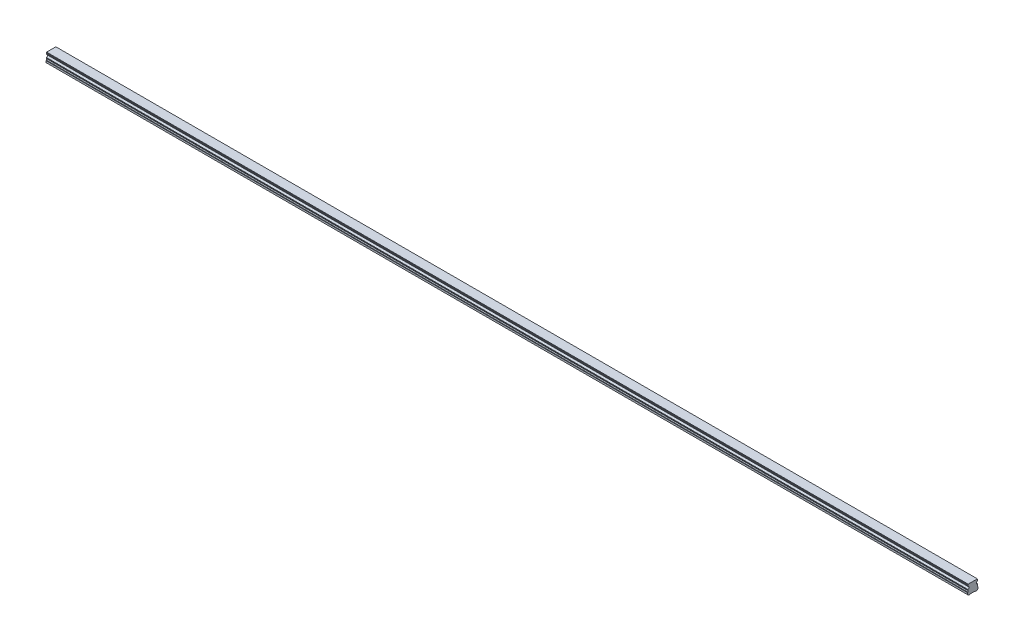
ISO-10303-21;
HEADER;
FILE_DESCRIPTION(('STEP AP214'),'2;1');
FILE_NAME('part.step','',(''),(''),'','','');
FILE_SCHEMA(('AUTOMOTIVE_DESIGN { 1 0 10303 214 1 1 1 1 }'));
ENDSEC;
DATA;
#1=APPLICATION_CONTEXT('core data for automotive mechanical design processes');
#2=APPLICATION_PROTOCOL_DEFINITION('international standard','automotive_design',2000,#1);
#3=PRODUCT_CONTEXT('',#1,'mechanical');
#4=PRODUCT('Part','Part','',(#3));
#5=PRODUCT_RELATED_PRODUCT_CATEGORY('part','',(#4));
#6=PRODUCT_DEFINITION_FORMATION('','',#4);
#7=PRODUCT_DEFINITION_CONTEXT('part definition',#1,'design');
#8=PRODUCT_DEFINITION('design','',#6,#7);
#9=PRODUCT_DEFINITION_SHAPE('','',#8);
#10=(LENGTH_UNIT() NAMED_UNIT(*) SI_UNIT(.MILLI.,.METRE.));
#11=(NAMED_UNIT(*) PLANE_ANGLE_UNIT() SI_UNIT($,.RADIAN.));
#12=(NAMED_UNIT(*) SI_UNIT($,.STERADIAN.) SOLID_ANGLE_UNIT());
#13=UNCERTAINTY_MEASURE_WITH_UNIT(LENGTH_MEASURE(1.E-05),#10,'distance_accuracy_value','');
#14=(GEOMETRIC_REPRESENTATION_CONTEXT(3) GLOBAL_UNCERTAINTY_ASSIGNED_CONTEXT((#13)) GLOBAL_UNIT_ASSIGNED_CONTEXT((#10,
#11,#12)) REPRESENTATION_CONTEXT('',''));
#15=CARTESIAN_POINT('',(0.,0.,0.));
#16=DIRECTION('',(0.,0.,1.));
#17=DIRECTION('',(1.,0.,0.));
#18=AXIS2_PLACEMENT_3D('',#15,#16,#17);
#19=CARTESIAN_POINT('',(1290.,0.399999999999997,0.));
#20=DIRECTION('',(0.,-1.,0.));
#21=DIRECTION('',(0.,0.,-1.));
#22=AXIS2_PLACEMENT_3D('',#19,#20,#21);
#23=CONICAL_SURFACE('',#22,2.90000000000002,0.785398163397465);
#24=CARTESIAN_POINT('',(1290.,0.799999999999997,0.));
#25=DIRECTION('',(0.,1.,0.));
#26=DIRECTION('',(0.,0.,1.));
#27=AXIS2_PLACEMENT_3D('',#24,#25,#26);
#28=CIRCLE('',#27,2.5);
#29=CARTESIAN_POINT('',(1290.,0.799999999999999,2.5));
#30=VERTEX_POINT('',#29);
#31=EDGE_CURVE('E11',#30,#30,#28,.F.);
#32=ORIENTED_EDGE('',*,*,#31,.F.);
#33=EDGE_LOOP('',(#32));
#34=FACE_BOUND('',#33,.T.);
#35=CARTESIAN_POINT('',(1290.,0.399999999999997,0.));
#36=DIRECTION('',(0.,1.,0.));
#37=DIRECTION('',(0.,0.,1.));
#38=AXIS2_PLACEMENT_3D('',#35,#36,#37);
#39=CIRCLE('',#38,2.90000000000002);
#40=CARTESIAN_POINT('',(1290.,0.399999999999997,2.90000000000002));
#41=VERTEX_POINT('',#40);
#42=EDGE_CURVE('E662',#41,#41,#39,.T.);
#43=ORIENTED_EDGE('',*,*,#42,.F.);
#44=EDGE_LOOP('',(#43));
#45=FACE_BOUND('',#44,.T.);
#46=ADVANCED_FACE('F39',(#34,#45),#23,.F.);
#47=CARTESIAN_POINT('',(1290.,7.,0.));
#48=DIRECTION('',(0.,-1.,0.));
#49=DIRECTION('',(0.,0.,-1.));
#50=AXIS2_PLACEMENT_3D('',#47,#48,#49);
#51=CYLINDRICAL_SURFACE('',#50,2.5);
#52=ORIENTED_EDGE('',*,*,#31,.T.);
#53=EDGE_LOOP('',(#52));
#54=FACE_BOUND('',#53,.T.);
#55=CARTESIAN_POINT('',(1290.,7.,0.));
#56=DIRECTION('',(0.,-1.,0.));
#57=DIRECTION('',(0.,0.,-1.));
#58=AXIS2_PLACEMENT_3D('',#55,#56,#57);
#59=CIRCLE('',#58,2.5);
#60=CARTESIAN_POINT('',(1290.,7.,-2.50000000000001));
#61=VERTEX_POINT('',#60);
#62=EDGE_CURVE('E49',#61,#61,#59,.T.);
#63=ORIENTED_EDGE('',*,*,#62,.F.);
#64=EDGE_LOOP('',(#63));
#65=FACE_BOUND('',#64,.T.);
#66=ADVANCED_FACE('F924',(#54,#65),#51,.F.);
#67=CARTESIAN_POINT('',(1290.,7.,0.));
#68=DIRECTION('',(0.,-1.,0.));
#69=DIRECTION('',(0.,0.,-1.));
#70=AXIS2_PLACEMENT_3D('',#67,#68,#69);
#71=PLANE('',#70);
#72=CARTESIAN_POINT('',(1290.,7.,0.));
#73=DIRECTION('',(0.,-1.,0.));
#74=DIRECTION('',(0.,0.,-1.));
#75=AXIS2_PLACEMENT_3D('',#72,#73,#74);
#76=CIRCLE('',#75,2.1);
#77=CARTESIAN_POINT('',(1290.,7.,-2.1));
#78=VERTEX_POINT('',#77);
#79=EDGE_CURVE('E42',#78,#78,#76,.T.);
#80=ORIENTED_EDGE('',*,*,#79,.F.);
#81=EDGE_LOOP('',(#80));
#82=FACE_BOUND('',#81,.T.);
#83=ORIENTED_EDGE('',*,*,#62,.T.);
#84=EDGE_LOOP('',(#83));
#85=FACE_BOUND('',#84,.T.);
#86=ADVANCED_FACE('F929',(#82,#85),#71,.T.);
#87=CARTESIAN_POINT('',(1230.,0.399999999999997,0.));
#88=DIRECTION('',(0.,-1.,0.));
#89=DIRECTION('',(0.,0.,-1.));
#90=AXIS2_PLACEMENT_3D('',#87,#88,#89);
#91=CONICAL_SURFACE('',#90,2.90000000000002,0.785398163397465);
#92=CARTESIAN_POINT('',(1230.,0.799999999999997,0.));
#93=DIRECTION('',(0.,1.,0.));
#94=DIRECTION('',(0.,0.,1.));
#95=AXIS2_PLACEMENT_3D('',#92,#93,#94);
#96=CIRCLE('',#95,2.5);
#97=CARTESIAN_POINT('',(1230.,0.799999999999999,2.5));
#98=VERTEX_POINT('',#97);
#99=EDGE_CURVE('E658',#98,#98,#96,.F.);
#100=ORIENTED_EDGE('',*,*,#99,.F.);
#101=EDGE_LOOP('',(#100));
#102=FACE_BOUND('',#101,.T.);
#103=CARTESIAN_POINT('',(1230.,0.399999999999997,0.));
#104=DIRECTION('',(0.,1.,0.));
#105=DIRECTION('',(0.,0.,1.));
#106=AXIS2_PLACEMENT_3D('',#103,#104,#105);
#107=CIRCLE('',#106,2.90000000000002);
#108=CARTESIAN_POINT('',(1230.,0.399999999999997,2.90000000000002));
#109=VERTEX_POINT('',#108);
#110=EDGE_CURVE('E650',#109,#109,#107,.T.);
#111=ORIENTED_EDGE('',*,*,#110,.F.);
#112=EDGE_LOOP('',(#111));
#113=FACE_BOUND('',#112,.T.);
#114=ADVANCED_FACE('F1232',(#102,#113),#91,.F.);
#115=CARTESIAN_POINT('',(1230.,7.,0.));
#116=DIRECTION('',(0.,-1.,0.));
#117=DIRECTION('',(0.,0.,-1.));
#118=AXIS2_PLACEMENT_3D('',#115,#116,#117);
#119=CYLINDRICAL_SURFACE('',#118,2.5);
#120=ORIENTED_EDGE('',*,*,#99,.T.);
#121=EDGE_LOOP('',(#120));
#122=FACE_BOUND('',#121,.T.);
#123=CARTESIAN_POINT('',(1230.,7.,0.));
#124=DIRECTION('',(0.,-1.,0.));
#125=DIRECTION('',(0.,0.,-1.));
#126=AXIS2_PLACEMENT_3D('',#123,#124,#125);
#127=CIRCLE('',#126,2.5);
#128=CARTESIAN_POINT('',(1230.,7.,-2.50000000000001));
#129=VERTEX_POINT('',#128);
#130=EDGE_CURVE('E654',#129,#129,#127,.T.);
#131=ORIENTED_EDGE('',*,*,#130,.F.);
#132=EDGE_LOOP('',(#131));
#133=FACE_BOUND('',#132,.T.);
#134=ADVANCED_FACE('F1228',(#122,#133),#119,.F.);
#135=CARTESIAN_POINT('',(1230.,7.,0.));
#136=DIRECTION('',(0.,-1.,0.));
#137=DIRECTION('',(0.,0.,-1.));
#138=AXIS2_PLACEMENT_3D('',#135,#136,#137);
#139=PLANE('',#138);
#140=CARTESIAN_POINT('',(1230.,7.,0.));
#141=DIRECTION('',(0.,-1.,0.));
#142=DIRECTION('',(0.,0.,-1.));
#143=AXIS2_PLACEMENT_3D('',#140,#141,#142);
#144=CIRCLE('',#143,2.1);
#145=CARTESIAN_POINT('',(1230.,7.,-2.1));
#146=VERTEX_POINT('',#145);
#147=EDGE_CURVE('E745',#146,#146,#144,.T.);
#148=ORIENTED_EDGE('',*,*,#147,.F.);
#149=EDGE_LOOP('',(#148));
#150=FACE_BOUND('',#149,.T.);
#151=ORIENTED_EDGE('',*,*,#130,.T.);
#152=EDGE_LOOP('',(#151));
#153=FACE_BOUND('',#152,.T.);
#154=ADVANCED_FACE('F1224',(#150,#153),#139,.T.);
#155=CARTESIAN_POINT('',(1170.,0.399999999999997,0.));
#156=DIRECTION('',(0.,-1.,0.));
#157=DIRECTION('',(0.,0.,-1.));
#158=AXIS2_PLACEMENT_3D('',#155,#156,#157);
#159=CONICAL_SURFACE('',#158,2.90000000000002,0.785398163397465);
#160=CARTESIAN_POINT('',(1170.,0.799999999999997,0.));
#161=DIRECTION('',(0.,1.,0.));
#162=DIRECTION('',(0.,0.,1.));
#163=AXIS2_PLACEMENT_3D('',#160,#161,#162);
#164=CIRCLE('',#163,2.5);
#165=CARTESIAN_POINT('',(1170.,0.799999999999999,2.5));
#166=VERTEX_POINT('',#165);
#167=EDGE_CURVE('E646',#166,#166,#164,.F.);
#168=ORIENTED_EDGE('',*,*,#167,.F.);
#169=EDGE_LOOP('',(#168));
#170=FACE_BOUND('',#169,.T.);
#171=CARTESIAN_POINT('',(1170.,0.399999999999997,0.));
#172=DIRECTION('',(0.,1.,0.));
#173=DIRECTION('',(0.,0.,1.));
#174=AXIS2_PLACEMENT_3D('',#171,#172,#173);
#175=CIRCLE('',#174,2.90000000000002);
#176=CARTESIAN_POINT('',(1170.,0.399999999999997,2.90000000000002));
#177=VERTEX_POINT('',#176);
#178=EDGE_CURVE('E638',#177,#177,#175,.T.);
#179=ORIENTED_EDGE('',*,*,#178,.F.);
#180=EDGE_LOOP('',(#179));
#181=FACE_BOUND('',#180,.T.);
#182=ADVANCED_FACE('F1220',(#170,#181),#159,.F.);
#183=CARTESIAN_POINT('',(1170.,7.,0.));
#184=DIRECTION('',(0.,-1.,0.));
#185=DIRECTION('',(0.,0.,-1.));
#186=AXIS2_PLACEMENT_3D('',#183,#184,#185);
#187=CYLINDRICAL_SURFACE('',#186,2.5);
#188=ORIENTED_EDGE('',*,*,#167,.T.);
#189=EDGE_LOOP('',(#188));
#190=FACE_BOUND('',#189,.T.);
#191=CARTESIAN_POINT('',(1170.,7.,0.));
#192=DIRECTION('',(0.,-1.,0.));
#193=DIRECTION('',(0.,0.,-1.));
#194=AXIS2_PLACEMENT_3D('',#191,#192,#193);
#195=CIRCLE('',#194,2.5);
#196=CARTESIAN_POINT('',(1170.,7.,-2.50000000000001));
#197=VERTEX_POINT('',#196);
#198=EDGE_CURVE('E642',#197,#197,#195,.T.);
#199=ORIENTED_EDGE('',*,*,#198,.F.);
#200=EDGE_LOOP('',(#199));
#201=FACE_BOUND('',#200,.T.);
#202=ADVANCED_FACE('F1216',(#190,#201),#187,.F.);
#203=CARTESIAN_POINT('',(1170.,7.,0.));
#204=DIRECTION('',(0.,-1.,0.));
#205=DIRECTION('',(0.,0.,-1.));
#206=AXIS2_PLACEMENT_3D('',#203,#204,#205);
#207=PLANE('',#206);
#208=CARTESIAN_POINT('',(1170.,7.,0.));
#209=DIRECTION('',(0.,-1.,0.));
#210=DIRECTION('',(0.,0.,-1.));
#211=AXIS2_PLACEMENT_3D('',#208,#209,#210);
#212=CIRCLE('',#211,2.1);
#213=CARTESIAN_POINT('',(1170.,7.,-2.1));
#214=VERTEX_POINT('',#213);
#215=EDGE_CURVE('E742',#214,#214,#212,.T.);
#216=ORIENTED_EDGE('',*,*,#215,.F.);
#217=EDGE_LOOP('',(#216));
#218=FACE_BOUND('',#217,.T.);
#219=ORIENTED_EDGE('',*,*,#198,.T.);
#220=EDGE_LOOP('',(#219));
#221=FACE_BOUND('',#220,.T.);
#222=ADVANCED_FACE('F1212',(#218,#221),#207,.T.);
#223=CARTESIAN_POINT('',(1110.,0.399999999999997,0.));
#224=DIRECTION('',(0.,-1.,0.));
#225=DIRECTION('',(0.,0.,-1.));
#226=AXIS2_PLACEMENT_3D('',#223,#224,#225);
#227=CONICAL_SURFACE('',#226,2.90000000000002,0.785398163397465);
#228=CARTESIAN_POINT('',(1110.,0.799999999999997,0.));
#229=DIRECTION('',(0.,1.,0.));
#230=DIRECTION('',(0.,0.,1.));
#231=AXIS2_PLACEMENT_3D('',#228,#229,#230);
#232=CIRCLE('',#231,2.5);
#233=CARTESIAN_POINT('',(1110.,0.799999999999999,2.5));
#234=VERTEX_POINT('',#233);
#235=EDGE_CURVE('E634',#234,#234,#232,.F.);
#236=ORIENTED_EDGE('',*,*,#235,.F.);
#237=EDGE_LOOP('',(#236));
#238=FACE_BOUND('',#237,.T.);
#239=CARTESIAN_POINT('',(1110.,0.399999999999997,0.));
#240=DIRECTION('',(0.,1.,0.));
#241=DIRECTION('',(0.,0.,1.));
#242=AXIS2_PLACEMENT_3D('',#239,#240,#241);
#243=CIRCLE('',#242,2.90000000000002);
#244=CARTESIAN_POINT('',(1110.,0.399999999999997,2.90000000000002));
#245=VERTEX_POINT('',#244);
#246=EDGE_CURVE('E626',#245,#245,#243,.T.);
#247=ORIENTED_EDGE('',*,*,#246,.F.);
#248=EDGE_LOOP('',(#247));
#249=FACE_BOUND('',#248,.T.);
#250=ADVANCED_FACE('F1208',(#238,#249),#227,.F.);
#251=CARTESIAN_POINT('',(1110.,7.,0.));
#252=DIRECTION('',(0.,-1.,0.));
#253=DIRECTION('',(0.,0.,-1.));
#254=AXIS2_PLACEMENT_3D('',#251,#252,#253);
#255=CYLINDRICAL_SURFACE('',#254,2.5);
#256=ORIENTED_EDGE('',*,*,#235,.T.);
#257=EDGE_LOOP('',(#256));
#258=FACE_BOUND('',#257,.T.);
#259=CARTESIAN_POINT('',(1110.,7.,0.));
#260=DIRECTION('',(0.,-1.,0.));
#261=DIRECTION('',(0.,0.,-1.));
#262=AXIS2_PLACEMENT_3D('',#259,#260,#261);
#263=CIRCLE('',#262,2.5);
#264=CARTESIAN_POINT('',(1110.,7.,-2.50000000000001));
#265=VERTEX_POINT('',#264);
#266=EDGE_CURVE('E630',#265,#265,#263,.T.);
#267=ORIENTED_EDGE('',*,*,#266,.F.);
#268=EDGE_LOOP('',(#267));
#269=FACE_BOUND('',#268,.T.);
#270=ADVANCED_FACE('F1204',(#258,#269),#255,.F.);
#271=CARTESIAN_POINT('',(1110.,7.,0.));
#272=DIRECTION('',(0.,-1.,0.));
#273=DIRECTION('',(0.,0.,-1.));
#274=AXIS2_PLACEMENT_3D('',#271,#272,#273);
#275=PLANE('',#274);
#276=CARTESIAN_POINT('',(1110.,7.,0.));
#277=DIRECTION('',(0.,-1.,0.));
#278=DIRECTION('',(0.,0.,-1.));
#279=AXIS2_PLACEMENT_3D('',#276,#277,#278);
#280=CIRCLE('',#279,2.1);
#281=CARTESIAN_POINT('',(1110.,7.,-2.1));
#282=VERTEX_POINT('',#281);
#283=EDGE_CURVE('E738',#282,#282,#280,.T.);
#284=ORIENTED_EDGE('',*,*,#283,.F.);
#285=EDGE_LOOP('',(#284));
#286=FACE_BOUND('',#285,.T.);
#287=ORIENTED_EDGE('',*,*,#266,.T.);
#288=EDGE_LOOP('',(#287));
#289=FACE_BOUND('',#288,.T.);
#290=ADVANCED_FACE('F1200',(#286,#289),#275,.T.);
#291=CARTESIAN_POINT('',(1050.,0.399999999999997,0.));
#292=DIRECTION('',(0.,-1.,0.));
#293=DIRECTION('',(0.,0.,-1.));
#294=AXIS2_PLACEMENT_3D('',#291,#292,#293);
#295=CONICAL_SURFACE('',#294,2.90000000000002,0.785398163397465);
#296=CARTESIAN_POINT('',(1050.,0.799999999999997,0.));
#297=DIRECTION('',(0.,1.,0.));
#298=DIRECTION('',(0.,0.,1.));
#299=AXIS2_PLACEMENT_3D('',#296,#297,#298);
#300=CIRCLE('',#299,2.5);
#301=CARTESIAN_POINT('',(1050.,0.799999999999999,2.5));
#302=VERTEX_POINT('',#301);
#303=EDGE_CURVE('E622',#302,#302,#300,.F.);
#304=ORIENTED_EDGE('',*,*,#303,.F.);
#305=EDGE_LOOP('',(#304));
#306=FACE_BOUND('',#305,.T.);
#307=CARTESIAN_POINT('',(1050.,0.399999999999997,0.));
#308=DIRECTION('',(0.,1.,0.));
#309=DIRECTION('',(0.,0.,1.));
#310=AXIS2_PLACEMENT_3D('',#307,#308,#309);
#311=CIRCLE('',#310,2.90000000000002);
#312=CARTESIAN_POINT('',(1050.,0.399999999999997,2.90000000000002));
#313=VERTEX_POINT('',#312);
#314=EDGE_CURVE('E614',#313,#313,#311,.T.);
#315=ORIENTED_EDGE('',*,*,#314,.F.);
#316=EDGE_LOOP('',(#315));
#317=FACE_BOUND('',#316,.T.);
#318=ADVANCED_FACE('F1196',(#306,#317),#295,.F.);
#319=CARTESIAN_POINT('',(1050.,7.,0.));
#320=DIRECTION('',(0.,-1.,0.));
#321=DIRECTION('',(0.,0.,-1.));
#322=AXIS2_PLACEMENT_3D('',#319,#320,#321);
#323=CYLINDRICAL_SURFACE('',#322,2.5);
#324=ORIENTED_EDGE('',*,*,#303,.T.);
#325=EDGE_LOOP('',(#324));
#326=FACE_BOUND('',#325,.T.);
#327=CARTESIAN_POINT('',(1050.,7.,0.));
#328=DIRECTION('',(0.,-1.,0.));
#329=DIRECTION('',(0.,0.,-1.));
#330=AXIS2_PLACEMENT_3D('',#327,#328,#329);
#331=CIRCLE('',#330,2.5);
#332=CARTESIAN_POINT('',(1050.,7.,-2.50000000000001));
#333=VERTEX_POINT('',#332);
#334=EDGE_CURVE('E618',#333,#333,#331,.T.);
#335=ORIENTED_EDGE('',*,*,#334,.F.);
#336=EDGE_LOOP('',(#335));
#337=FACE_BOUND('',#336,.T.);
#338=ADVANCED_FACE('F1192',(#326,#337),#323,.F.);
#339=CARTESIAN_POINT('',(1050.,7.,0.));
#340=DIRECTION('',(0.,-1.,0.));
#341=DIRECTION('',(0.,0.,-1.));
#342=AXIS2_PLACEMENT_3D('',#339,#340,#341);
#343=PLANE('',#342);
#344=CARTESIAN_POINT('',(1050.,7.,0.));
#345=DIRECTION('',(0.,-1.,0.));
#346=DIRECTION('',(0.,0.,-1.));
#347=AXIS2_PLACEMENT_3D('',#344,#345,#346);
#348=CIRCLE('',#347,2.1);
#349=CARTESIAN_POINT('',(1050.,7.,-2.1));
#350=VERTEX_POINT('',#349);
#351=EDGE_CURVE('E734',#350,#350,#348,.T.);
#352=ORIENTED_EDGE('',*,*,#351,.F.);
#353=EDGE_LOOP('',(#352));
#354=FACE_BOUND('',#353,.T.);
#355=ORIENTED_EDGE('',*,*,#334,.T.);
#356=EDGE_LOOP('',(#355));
#357=FACE_BOUND('',#356,.T.);
#358=ADVANCED_FACE('F1188',(#354,#357),#343,.T.);
#359=CARTESIAN_POINT('',(990.,0.399999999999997,0.));
#360=DIRECTION('',(0.,-1.,0.));
#361=DIRECTION('',(0.,0.,-1.));
#362=AXIS2_PLACEMENT_3D('',#359,#360,#361);
#363=CONICAL_SURFACE('',#362,2.90000000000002,0.785398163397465);
#364=CARTESIAN_POINT('',(990.,0.799999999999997,0.));
#365=DIRECTION('',(0.,1.,0.));
#366=DIRECTION('',(0.,0.,1.));
#367=AXIS2_PLACEMENT_3D('',#364,#365,#366);
#368=CIRCLE('',#367,2.5);
#369=CARTESIAN_POINT('',(990.,0.799999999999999,2.5));
#370=VERTEX_POINT('',#369);
#371=EDGE_CURVE('E610',#370,#370,#368,.F.);
#372=ORIENTED_EDGE('',*,*,#371,.F.);
#373=EDGE_LOOP('',(#372));
#374=FACE_BOUND('',#373,.T.);
#375=CARTESIAN_POINT('',(990.,0.399999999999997,0.));
#376=DIRECTION('',(0.,1.,0.));
#377=DIRECTION('',(0.,0.,1.));
#378=AXIS2_PLACEMENT_3D('',#375,#376,#377);
#379=CIRCLE('',#378,2.90000000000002);
#380=CARTESIAN_POINT('',(990.,0.399999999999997,2.90000000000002));
#381=VERTEX_POINT('',#380);
#382=EDGE_CURVE('E602',#381,#381,#379,.T.);
#383=ORIENTED_EDGE('',*,*,#382,.F.);
#384=EDGE_LOOP('',(#383));
#385=FACE_BOUND('',#384,.T.);
#386=ADVANCED_FACE('F1184',(#374,#385),#363,.F.);
#387=CARTESIAN_POINT('',(990.,7.,0.));
#388=DIRECTION('',(0.,-1.,0.));
#389=DIRECTION('',(0.,0.,-1.));
#390=AXIS2_PLACEMENT_3D('',#387,#388,#389);
#391=CYLINDRICAL_SURFACE('',#390,2.5);
#392=ORIENTED_EDGE('',*,*,#371,.T.);
#393=EDGE_LOOP('',(#392));
#394=FACE_BOUND('',#393,.T.);
#395=CARTESIAN_POINT('',(990.,7.,0.));
#396=DIRECTION('',(0.,-1.,0.));
#397=DIRECTION('',(0.,0.,-1.));
#398=AXIS2_PLACEMENT_3D('',#395,#396,#397);
#399=CIRCLE('',#398,2.5);
#400=CARTESIAN_POINT('',(990.,7.,-2.50000000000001));
#401=VERTEX_POINT('',#400);
#402=EDGE_CURVE('E606',#401,#401,#399,.T.);
#403=ORIENTED_EDGE('',*,*,#402,.F.);
#404=EDGE_LOOP('',(#403));
#405=FACE_BOUND('',#404,.T.);
#406=ADVANCED_FACE('F1180',(#394,#405),#391,.F.);
#407=CARTESIAN_POINT('',(990.,7.,0.));
#408=DIRECTION('',(0.,-1.,0.));
#409=DIRECTION('',(0.,0.,-1.));
#410=AXIS2_PLACEMENT_3D('',#407,#408,#409);
#411=PLANE('',#410);
#412=CARTESIAN_POINT('',(990.,7.,0.));
#413=DIRECTION('',(0.,-1.,0.));
#414=DIRECTION('',(0.,0.,-1.));
#415=AXIS2_PLACEMENT_3D('',#412,#413,#414);
#416=CIRCLE('',#415,2.1);
#417=CARTESIAN_POINT('',(990.,7.,-2.1));
#418=VERTEX_POINT('',#417);
#419=EDGE_CURVE('E730',#418,#418,#416,.T.);
#420=ORIENTED_EDGE('',*,*,#419,.F.);
#421=EDGE_LOOP('',(#420));
#422=FACE_BOUND('',#421,.T.);
#423=ORIENTED_EDGE('',*,*,#402,.T.);
#424=EDGE_LOOP('',(#423));
#425=FACE_BOUND('',#424,.T.);
#426=ADVANCED_FACE('F1176',(#422,#425),#411,.T.);
#427=CARTESIAN_POINT('',(930.,0.399999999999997,0.));
#428=DIRECTION('',(0.,-1.,0.));
#429=DIRECTION('',(0.,0.,-1.));
#430=AXIS2_PLACEMENT_3D('',#427,#428,#429);
#431=CONICAL_SURFACE('',#430,2.90000000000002,0.785398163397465);
#432=CARTESIAN_POINT('',(930.,0.799999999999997,0.));
#433=DIRECTION('',(0.,1.,0.));
#434=DIRECTION('',(0.,0.,1.));
#435=AXIS2_PLACEMENT_3D('',#432,#433,#434);
#436=CIRCLE('',#435,2.5);
#437=CARTESIAN_POINT('',(930.,0.799999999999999,2.5));
#438=VERTEX_POINT('',#437);
#439=EDGE_CURVE('E598',#438,#438,#436,.F.);
#440=ORIENTED_EDGE('',*,*,#439,.F.);
#441=EDGE_LOOP('',(#440));
#442=FACE_BOUND('',#441,.T.);
#443=CARTESIAN_POINT('',(930.,0.399999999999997,0.));
#444=DIRECTION('',(0.,1.,0.));
#445=DIRECTION('',(0.,0.,1.));
#446=AXIS2_PLACEMENT_3D('',#443,#444,#445);
#447=CIRCLE('',#446,2.90000000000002);
#448=CARTESIAN_POINT('',(930.,0.399999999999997,2.90000000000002));
#449=VERTEX_POINT('',#448);
#450=EDGE_CURVE('E590',#449,#449,#447,.T.);
#451=ORIENTED_EDGE('',*,*,#450,.F.);
#452=EDGE_LOOP('',(#451));
#453=FACE_BOUND('',#452,.T.);
#454=ADVANCED_FACE('F1172',(#442,#453),#431,.F.);
#455=CARTESIAN_POINT('',(930.,7.,0.));
#456=DIRECTION('',(0.,-1.,0.));
#457=DIRECTION('',(0.,0.,-1.));
#458=AXIS2_PLACEMENT_3D('',#455,#456,#457);
#459=CYLINDRICAL_SURFACE('',#458,2.5);
#460=ORIENTED_EDGE('',*,*,#439,.T.);
#461=EDGE_LOOP('',(#460));
#462=FACE_BOUND('',#461,.T.);
#463=CARTESIAN_POINT('',(930.,7.,0.));
#464=DIRECTION('',(0.,-1.,0.));
#465=DIRECTION('',(0.,0.,-1.));
#466=AXIS2_PLACEMENT_3D('',#463,#464,#465);
#467=CIRCLE('',#466,2.5);
#468=CARTESIAN_POINT('',(930.,7.,-2.50000000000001));
#469=VERTEX_POINT('',#468);
#470=EDGE_CURVE('E594',#469,#469,#467,.T.);
#471=ORIENTED_EDGE('',*,*,#470,.F.);
#472=EDGE_LOOP('',(#471));
#473=FACE_BOUND('',#472,.T.);
#474=ADVANCED_FACE('F1168',(#462,#473),#459,.F.);
#475=CARTESIAN_POINT('',(930.,7.,0.));
#476=DIRECTION('',(0.,-1.,0.));
#477=DIRECTION('',(0.,0.,-1.));
#478=AXIS2_PLACEMENT_3D('',#475,#476,#477);
#479=PLANE('',#478);
#480=CARTESIAN_POINT('',(930.,7.,0.));
#481=DIRECTION('',(0.,-1.,0.));
#482=DIRECTION('',(0.,0.,-1.));
#483=AXIS2_PLACEMENT_3D('',#480,#481,#482);
#484=CIRCLE('',#483,2.1);
#485=CARTESIAN_POINT('',(930.,7.,-2.1));
#486=VERTEX_POINT('',#485);
#487=EDGE_CURVE('E726',#486,#486,#484,.T.);
#488=ORIENTED_EDGE('',*,*,#487,.F.);
#489=EDGE_LOOP('',(#488));
#490=FACE_BOUND('',#489,.T.);
#491=ORIENTED_EDGE('',*,*,#470,.T.);
#492=EDGE_LOOP('',(#491));
#493=FACE_BOUND('',#492,.T.);
#494=ADVANCED_FACE('F1164',(#490,#493),#479,.T.);
#495=CARTESIAN_POINT('',(870.,0.399999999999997,0.));
#496=DIRECTION('',(0.,-1.,0.));
#497=DIRECTION('',(0.,0.,-1.));
#498=AXIS2_PLACEMENT_3D('',#495,#496,#497);
#499=CONICAL_SURFACE('',#498,2.90000000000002,0.785398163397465);
#500=CARTESIAN_POINT('',(870.,0.799999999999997,0.));
#501=DIRECTION('',(0.,1.,0.));
#502=DIRECTION('',(0.,0.,1.));
#503=AXIS2_PLACEMENT_3D('',#500,#501,#502);
#504=CIRCLE('',#503,2.5);
#505=CARTESIAN_POINT('',(870.,0.799999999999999,2.5));
#506=VERTEX_POINT('',#505);
#507=EDGE_CURVE('E586',#506,#506,#504,.F.);
#508=ORIENTED_EDGE('',*,*,#507,.F.);
#509=EDGE_LOOP('',(#508));
#510=FACE_BOUND('',#509,.T.);
#511=CARTESIAN_POINT('',(870.,0.399999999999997,0.));
#512=DIRECTION('',(0.,1.,0.));
#513=DIRECTION('',(0.,0.,1.));
#514=AXIS2_PLACEMENT_3D('',#511,#512,#513);
#515=CIRCLE('',#514,2.90000000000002);
#516=CARTESIAN_POINT('',(870.,0.399999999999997,2.90000000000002));
#517=VERTEX_POINT('',#516);
#518=EDGE_CURVE('E578',#517,#517,#515,.T.);
#519=ORIENTED_EDGE('',*,*,#518,.F.);
#520=EDGE_LOOP('',(#519));
#521=FACE_BOUND('',#520,.T.);
#522=ADVANCED_FACE('F1160',(#510,#521),#499,.F.);
#523=CARTESIAN_POINT('',(870.,7.,0.));
#524=DIRECTION('',(0.,-1.,0.));
#525=DIRECTION('',(0.,0.,-1.));
#526=AXIS2_PLACEMENT_3D('',#523,#524,#525);
#527=CYLINDRICAL_SURFACE('',#526,2.5);
#528=ORIENTED_EDGE('',*,*,#507,.T.);
#529=EDGE_LOOP('',(#528));
#530=FACE_BOUND('',#529,.T.);
#531=CARTESIAN_POINT('',(870.,7.,0.));
#532=DIRECTION('',(0.,-1.,0.));
#533=DIRECTION('',(0.,0.,-1.));
#534=AXIS2_PLACEMENT_3D('',#531,#532,#533);
#535=CIRCLE('',#534,2.5);
#536=CARTESIAN_POINT('',(870.,7.,-2.50000000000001));
#537=VERTEX_POINT('',#536);
#538=EDGE_CURVE('E582',#537,#537,#535,.T.);
#539=ORIENTED_EDGE('',*,*,#538,.F.);
#540=EDGE_LOOP('',(#539));
#541=FACE_BOUND('',#540,.T.);
#542=ADVANCED_FACE('F1156',(#530,#541),#527,.F.);
#543=CARTESIAN_POINT('',(870.,7.,0.));
#544=DIRECTION('',(0.,-1.,0.));
#545=DIRECTION('',(0.,0.,-1.));
#546=AXIS2_PLACEMENT_3D('',#543,#544,#545);
#547=PLANE('',#546);
#548=CARTESIAN_POINT('',(870.,7.,0.));
#549=DIRECTION('',(0.,-1.,0.));
#550=DIRECTION('',(0.,0.,-1.));
#551=AXIS2_PLACEMENT_3D('',#548,#549,#550);
#552=CIRCLE('',#551,2.1);
#553=CARTESIAN_POINT('',(870.,7.,-2.1));
#554=VERTEX_POINT('',#553);
#555=EDGE_CURVE('E722',#554,#554,#552,.T.);
#556=ORIENTED_EDGE('',*,*,#555,.F.);
#557=EDGE_LOOP('',(#556));
#558=FACE_BOUND('',#557,.T.);
#559=ORIENTED_EDGE('',*,*,#538,.T.);
#560=EDGE_LOOP('',(#559));
#561=FACE_BOUND('',#560,.T.);
#562=ADVANCED_FACE('F1152',(#558,#561),#547,.T.);
#563=CARTESIAN_POINT('',(810.,0.399999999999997,0.));
#564=DIRECTION('',(0.,-1.,0.));
#565=DIRECTION('',(0.,0.,-1.));
#566=AXIS2_PLACEMENT_3D('',#563,#564,#565);
#567=CONICAL_SURFACE('',#566,2.90000000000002,0.785398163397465);
#568=CARTESIAN_POINT('',(810.,0.799999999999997,0.));
#569=DIRECTION('',(0.,1.,0.));
#570=DIRECTION('',(0.,0.,1.));
#571=AXIS2_PLACEMENT_3D('',#568,#569,#570);
#572=CIRCLE('',#571,2.5);
#573=CARTESIAN_POINT('',(810.,0.799999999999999,2.5));
#574=VERTEX_POINT('',#573);
#575=EDGE_CURVE('E574',#574,#574,#572,.F.);
#576=ORIENTED_EDGE('',*,*,#575,.F.);
#577=EDGE_LOOP('',(#576));
#578=FACE_BOUND('',#577,.T.);
#579=CARTESIAN_POINT('',(810.,0.399999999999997,0.));
#580=DIRECTION('',(0.,1.,0.));
#581=DIRECTION('',(0.,0.,1.));
#582=AXIS2_PLACEMENT_3D('',#579,#580,#581);
#583=CIRCLE('',#582,2.90000000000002);
#584=CARTESIAN_POINT('',(810.,0.399999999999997,2.90000000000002));
#585=VERTEX_POINT('',#584);
#586=EDGE_CURVE('E566',#585,#585,#583,.T.);
#587=ORIENTED_EDGE('',*,*,#586,.F.);
#588=EDGE_LOOP('',(#587));
#589=FACE_BOUND('',#588,.T.);
#590=ADVANCED_FACE('F1148',(#578,#589),#567,.F.);
#591=CARTESIAN_POINT('',(810.,7.,0.));
#592=DIRECTION('',(0.,-1.,0.));
#593=DIRECTION('',(0.,0.,-1.));
#594=AXIS2_PLACEMENT_3D('',#591,#592,#593);
#595=CYLINDRICAL_SURFACE('',#594,2.5);
#596=ORIENTED_EDGE('',*,*,#575,.T.);
#597=EDGE_LOOP('',(#596));
#598=FACE_BOUND('',#597,.T.);
#599=CARTESIAN_POINT('',(810.,7.,0.));
#600=DIRECTION('',(0.,-1.,0.));
#601=DIRECTION('',(0.,0.,-1.));
#602=AXIS2_PLACEMENT_3D('',#599,#600,#601);
#603=CIRCLE('',#602,2.5);
#604=CARTESIAN_POINT('',(810.,7.,-2.50000000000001));
#605=VERTEX_POINT('',#604);
#606=EDGE_CURVE('E570',#605,#605,#603,.T.);
#607=ORIENTED_EDGE('',*,*,#606,.F.);
#608=EDGE_LOOP('',(#607));
#609=FACE_BOUND('',#608,.T.);
#610=ADVANCED_FACE('F1144',(#598,#609),#595,.F.);
#611=CARTESIAN_POINT('',(810.,7.,0.));
#612=DIRECTION('',(0.,-1.,0.));
#613=DIRECTION('',(0.,0.,-1.));
#614=AXIS2_PLACEMENT_3D('',#611,#612,#613);
#615=PLANE('',#614);
#616=CARTESIAN_POINT('',(810.,7.,0.));
#617=DIRECTION('',(0.,-1.,0.));
#618=DIRECTION('',(0.,0.,-1.));
#619=AXIS2_PLACEMENT_3D('',#616,#617,#618);
#620=CIRCLE('',#619,2.1);
#621=CARTESIAN_POINT('',(810.,7.,-2.1));
#622=VERTEX_POINT('',#621);
#623=EDGE_CURVE('E718',#622,#622,#620,.T.);
#624=ORIENTED_EDGE('',*,*,#623,.F.);
#625=EDGE_LOOP('',(#624));
#626=FACE_BOUND('',#625,.T.);
#627=ORIENTED_EDGE('',*,*,#606,.T.);
#628=EDGE_LOOP('',(#627));
#629=FACE_BOUND('',#628,.T.);
#630=ADVANCED_FACE('F1140',(#626,#629),#615,.T.);
#631=CARTESIAN_POINT('',(750.,0.399999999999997,0.));
#632=DIRECTION('',(0.,-1.,0.));
#633=DIRECTION('',(0.,0.,-1.));
#634=AXIS2_PLACEMENT_3D('',#631,#632,#633);
#635=CONICAL_SURFACE('',#634,2.90000000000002,0.785398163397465);
#636=CARTESIAN_POINT('',(750.,0.799999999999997,0.));
#637=DIRECTION('',(0.,1.,0.));
#638=DIRECTION('',(0.,0.,1.));
#639=AXIS2_PLACEMENT_3D('',#636,#637,#638);
#640=CIRCLE('',#639,2.5);
#641=CARTESIAN_POINT('',(750.,0.799999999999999,2.5));
#642=VERTEX_POINT('',#641);
#643=EDGE_CURVE('E562',#642,#642,#640,.F.);
#644=ORIENTED_EDGE('',*,*,#643,.F.);
#645=EDGE_LOOP('',(#644));
#646=FACE_BOUND('',#645,.T.);
#647=CARTESIAN_POINT('',(750.,0.399999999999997,0.));
#648=DIRECTION('',(0.,1.,0.));
#649=DIRECTION('',(0.,0.,1.));
#650=AXIS2_PLACEMENT_3D('',#647,#648,#649);
#651=CIRCLE('',#650,2.90000000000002);
#652=CARTESIAN_POINT('',(750.,0.399999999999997,2.90000000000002));
#653=VERTEX_POINT('',#652);
#654=EDGE_CURVE('E554',#653,#653,#651,.T.);
#655=ORIENTED_EDGE('',*,*,#654,.F.);
#656=EDGE_LOOP('',(#655));
#657=FACE_BOUND('',#656,.T.);
#658=ADVANCED_FACE('F1136',(#646,#657),#635,.F.);
#659=CARTESIAN_POINT('',(750.,7.,0.));
#660=DIRECTION('',(0.,-1.,0.));
#661=DIRECTION('',(0.,0.,-1.));
#662=AXIS2_PLACEMENT_3D('',#659,#660,#661);
#663=CYLINDRICAL_SURFACE('',#662,2.5);
#664=ORIENTED_EDGE('',*,*,#643,.T.);
#665=EDGE_LOOP('',(#664));
#666=FACE_BOUND('',#665,.T.);
#667=CARTESIAN_POINT('',(750.,7.,0.));
#668=DIRECTION('',(0.,-1.,0.));
#669=DIRECTION('',(0.,0.,-1.));
#670=AXIS2_PLACEMENT_3D('',#667,#668,#669);
#671=CIRCLE('',#670,2.5);
#672=CARTESIAN_POINT('',(750.,7.,-2.50000000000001));
#673=VERTEX_POINT('',#672);
#674=EDGE_CURVE('E558',#673,#673,#671,.T.);
#675=ORIENTED_EDGE('',*,*,#674,.F.);
#676=EDGE_LOOP('',(#675));
#677=FACE_BOUND('',#676,.T.);
#678=ADVANCED_FACE('F1132',(#666,#677),#663,.F.);
#679=CARTESIAN_POINT('',(750.,7.,0.));
#680=DIRECTION('',(0.,-1.,0.));
#681=DIRECTION('',(0.,0.,-1.));
#682=AXIS2_PLACEMENT_3D('',#679,#680,#681);
#683=PLANE('',#682);
#684=CARTESIAN_POINT('',(750.,7.,0.));
#685=DIRECTION('',(0.,-1.,0.));
#686=DIRECTION('',(0.,0.,-1.));
#687=AXIS2_PLACEMENT_3D('',#684,#685,#686);
#688=CIRCLE('',#687,2.1);
#689=CARTESIAN_POINT('',(750.,7.,-2.1));
#690=VERTEX_POINT('',#689);
#691=EDGE_CURVE('E714',#690,#690,#688,.T.);
#692=ORIENTED_EDGE('',*,*,#691,.F.);
#693=EDGE_LOOP('',(#692));
#694=FACE_BOUND('',#693,.T.);
#695=ORIENTED_EDGE('',*,*,#674,.T.);
#696=EDGE_LOOP('',(#695));
#697=FACE_BOUND('',#696,.T.);
#698=ADVANCED_FACE('F1128',(#694,#697),#683,.T.);
#699=CARTESIAN_POINT('',(690.,0.399999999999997,0.));
#700=DIRECTION('',(0.,-1.,0.));
#701=DIRECTION('',(0.,0.,-1.));
#702=AXIS2_PLACEMENT_3D('',#699,#700,#701);
#703=CONICAL_SURFACE('',#702,2.90000000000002,0.785398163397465);
#704=CARTESIAN_POINT('',(690.,0.799999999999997,0.));
#705=DIRECTION('',(0.,1.,0.));
#706=DIRECTION('',(0.,0.,1.));
#707=AXIS2_PLACEMENT_3D('',#704,#705,#706);
#708=CIRCLE('',#707,2.5);
#709=CARTESIAN_POINT('',(690.,0.799999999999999,2.5));
#710=VERTEX_POINT('',#709);
#711=EDGE_CURVE('E550',#710,#710,#708,.F.);
#712=ORIENTED_EDGE('',*,*,#711,.F.);
#713=EDGE_LOOP('',(#712));
#714=FACE_BOUND('',#713,.T.);
#715=CARTESIAN_POINT('',(690.,0.399999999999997,0.));
#716=DIRECTION('',(0.,1.,0.));
#717=DIRECTION('',(0.,0.,1.));
#718=AXIS2_PLACEMENT_3D('',#715,#716,#717);
#719=CIRCLE('',#718,2.90000000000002);
#720=CARTESIAN_POINT('',(690.,0.399999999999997,2.90000000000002));
#721=VERTEX_POINT('',#720);
#722=EDGE_CURVE('E542',#721,#721,#719,.T.);
#723=ORIENTED_EDGE('',*,*,#722,.F.);
#724=EDGE_LOOP('',(#723));
#725=FACE_BOUND('',#724,.T.);
#726=ADVANCED_FACE('F1124',(#714,#725),#703,.F.);
#727=CARTESIAN_POINT('',(690.,7.,0.));
#728=DIRECTION('',(0.,-1.,0.));
#729=DIRECTION('',(0.,0.,-1.));
#730=AXIS2_PLACEMENT_3D('',#727,#728,#729);
#731=CYLINDRICAL_SURFACE('',#730,2.5);
#732=ORIENTED_EDGE('',*,*,#711,.T.);
#733=EDGE_LOOP('',(#732));
#734=FACE_BOUND('',#733,.T.);
#735=CARTESIAN_POINT('',(690.,7.,0.));
#736=DIRECTION('',(0.,-1.,0.));
#737=DIRECTION('',(0.,0.,-1.));
#738=AXIS2_PLACEMENT_3D('',#735,#736,#737);
#739=CIRCLE('',#738,2.5);
#740=CARTESIAN_POINT('',(690.,7.,-2.50000000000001));
#741=VERTEX_POINT('',#740);
#742=EDGE_CURVE('E546',#741,#741,#739,.T.);
#743=ORIENTED_EDGE('',*,*,#742,.F.);
#744=EDGE_LOOP('',(#743));
#745=FACE_BOUND('',#744,.T.);
#746=ADVANCED_FACE('F1120',(#734,#745),#731,.F.);
#747=CARTESIAN_POINT('',(690.,7.,0.));
#748=DIRECTION('',(0.,-1.,0.));
#749=DIRECTION('',(0.,0.,-1.));
#750=AXIS2_PLACEMENT_3D('',#747,#748,#749);
#751=PLANE('',#750);
#752=CARTESIAN_POINT('',(690.,7.,0.));
#753=DIRECTION('',(0.,-1.,0.));
#754=DIRECTION('',(0.,0.,-1.));
#755=AXIS2_PLACEMENT_3D('',#752,#753,#754);
#756=CIRCLE('',#755,2.1);
#757=CARTESIAN_POINT('',(690.,7.,-2.1));
#758=VERTEX_POINT('',#757);
#759=EDGE_CURVE('E710',#758,#758,#756,.T.);
#760=ORIENTED_EDGE('',*,*,#759,.F.);
#761=EDGE_LOOP('',(#760));
#762=FACE_BOUND('',#761,.T.);
#763=ORIENTED_EDGE('',*,*,#742,.T.);
#764=EDGE_LOOP('',(#763));
#765=FACE_BOUND('',#764,.T.);
#766=ADVANCED_FACE('F1116',(#762,#765),#751,.T.);
#767=CARTESIAN_POINT('',(630.,0.399999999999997,0.));
#768=DIRECTION('',(0.,-1.,0.));
#769=DIRECTION('',(0.,0.,-1.));
#770=AXIS2_PLACEMENT_3D('',#767,#768,#769);
#771=CONICAL_SURFACE('',#770,2.90000000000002,0.785398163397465);
#772=CARTESIAN_POINT('',(630.,0.799999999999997,0.));
#773=DIRECTION('',(0.,1.,0.));
#774=DIRECTION('',(0.,0.,1.));
#775=AXIS2_PLACEMENT_3D('',#772,#773,#774);
#776=CIRCLE('',#775,2.5);
#777=CARTESIAN_POINT('',(630.,0.799999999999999,2.5));
#778=VERTEX_POINT('',#777);
#779=EDGE_CURVE('E538',#778,#778,#776,.F.);
#780=ORIENTED_EDGE('',*,*,#779,.F.);
#781=EDGE_LOOP('',(#780));
#782=FACE_BOUND('',#781,.T.);
#783=CARTESIAN_POINT('',(630.,0.399999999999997,0.));
#784=DIRECTION('',(0.,1.,0.));
#785=DIRECTION('',(0.,0.,1.));
#786=AXIS2_PLACEMENT_3D('',#783,#784,#785);
#787=CIRCLE('',#786,2.90000000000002);
#788=CARTESIAN_POINT('',(630.,0.399999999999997,2.90000000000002));
#789=VERTEX_POINT('',#788);
#790=EDGE_CURVE('E530',#789,#789,#787,.T.);
#791=ORIENTED_EDGE('',*,*,#790,.F.);
#792=EDGE_LOOP('',(#791));
#793=FACE_BOUND('',#792,.T.);
#794=ADVANCED_FACE('F1112',(#782,#793),#771,.F.);
#795=CARTESIAN_POINT('',(630.,7.,0.));
#796=DIRECTION('',(0.,-1.,0.));
#797=DIRECTION('',(0.,0.,-1.));
#798=AXIS2_PLACEMENT_3D('',#795,#796,#797);
#799=CYLINDRICAL_SURFACE('',#798,2.5);
#800=ORIENTED_EDGE('',*,*,#779,.T.);
#801=EDGE_LOOP('',(#800));
#802=FACE_BOUND('',#801,.T.);
#803=CARTESIAN_POINT('',(630.,7.,0.));
#804=DIRECTION('',(0.,-1.,0.));
#805=DIRECTION('',(0.,0.,-1.));
#806=AXIS2_PLACEMENT_3D('',#803,#804,#805);
#807=CIRCLE('',#806,2.5);
#808=CARTESIAN_POINT('',(630.,7.,-2.50000000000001));
#809=VERTEX_POINT('',#808);
#810=EDGE_CURVE('E534',#809,#809,#807,.T.);
#811=ORIENTED_EDGE('',*,*,#810,.F.);
#812=EDGE_LOOP('',(#811));
#813=FACE_BOUND('',#812,.T.);
#814=ADVANCED_FACE('F1108',(#802,#813),#799,.F.);
#815=CARTESIAN_POINT('',(630.,7.,0.));
#816=DIRECTION('',(0.,-1.,0.));
#817=DIRECTION('',(0.,0.,-1.));
#818=AXIS2_PLACEMENT_3D('',#815,#816,#817);
#819=PLANE('',#818);
#820=CARTESIAN_POINT('',(630.,7.,0.));
#821=DIRECTION('',(0.,-1.,0.));
#822=DIRECTION('',(0.,0.,-1.));
#823=AXIS2_PLACEMENT_3D('',#820,#821,#822);
#824=CIRCLE('',#823,2.1);
#825=CARTESIAN_POINT('',(630.,7.,-2.1));
#826=VERTEX_POINT('',#825);
#827=EDGE_CURVE('E706',#826,#826,#824,.T.);
#828=ORIENTED_EDGE('',*,*,#827,.F.);
#829=EDGE_LOOP('',(#828));
#830=FACE_BOUND('',#829,.T.);
#831=ORIENTED_EDGE('',*,*,#810,.T.);
#832=EDGE_LOOP('',(#831));
#833=FACE_BOUND('',#832,.T.);
#834=ADVANCED_FACE('F1104',(#830,#833),#819,.T.);
#835=CARTESIAN_POINT('',(570.,0.399999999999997,0.));
#836=DIRECTION('',(0.,-1.,0.));
#837=DIRECTION('',(0.,0.,-1.));
#838=AXIS2_PLACEMENT_3D('',#835,#836,#837);
#839=CONICAL_SURFACE('',#838,2.90000000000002,0.785398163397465);
#840=CARTESIAN_POINT('',(570.,0.799999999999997,0.));
#841=DIRECTION('',(0.,1.,0.));
#842=DIRECTION('',(0.,0.,1.));
#843=AXIS2_PLACEMENT_3D('',#840,#841,#842);
#844=CIRCLE('',#843,2.5);
#845=CARTESIAN_POINT('',(570.,0.799999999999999,2.5));
#846=VERTEX_POINT('',#845);
#847=EDGE_CURVE('E526',#846,#846,#844,.F.);
#848=ORIENTED_EDGE('',*,*,#847,.F.);
#849=EDGE_LOOP('',(#848));
#850=FACE_BOUND('',#849,.T.);
#851=CARTESIAN_POINT('',(570.,0.399999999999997,0.));
#852=DIRECTION('',(0.,1.,0.));
#853=DIRECTION('',(0.,0.,1.));
#854=AXIS2_PLACEMENT_3D('',#851,#852,#853);
#855=CIRCLE('',#854,2.90000000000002);
#856=CARTESIAN_POINT('',(570.,0.399999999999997,2.90000000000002));
#857=VERTEX_POINT('',#856);
#858=EDGE_CURVE('E518',#857,#857,#855,.T.);
#859=ORIENTED_EDGE('',*,*,#858,.F.);
#860=EDGE_LOOP('',(#859));
#861=FACE_BOUND('',#860,.T.);
#862=ADVANCED_FACE('F1100',(#850,#861),#839,.F.);
#863=CARTESIAN_POINT('',(570.,7.,0.));
#864=DIRECTION('',(0.,-1.,0.));
#865=DIRECTION('',(0.,0.,-1.));
#866=AXIS2_PLACEMENT_3D('',#863,#864,#865);
#867=CYLINDRICAL_SURFACE('',#866,2.5);
#868=ORIENTED_EDGE('',*,*,#847,.T.);
#869=EDGE_LOOP('',(#868));
#870=FACE_BOUND('',#869,.T.);
#871=CARTESIAN_POINT('',(570.,7.,0.));
#872=DIRECTION('',(0.,-1.,0.));
#873=DIRECTION('',(0.,0.,-1.));
#874=AXIS2_PLACEMENT_3D('',#871,#872,#873);
#875=CIRCLE('',#874,2.5);
#876=CARTESIAN_POINT('',(570.,7.,-2.50000000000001));
#877=VERTEX_POINT('',#876);
#878=EDGE_CURVE('E522',#877,#877,#875,.T.);
#879=ORIENTED_EDGE('',*,*,#878,.F.);
#880=EDGE_LOOP('',(#879));
#881=FACE_BOUND('',#880,.T.);
#882=ADVANCED_FACE('F1096',(#870,#881),#867,.F.);
#883=CARTESIAN_POINT('',(570.,7.,0.));
#884=DIRECTION('',(0.,-1.,0.));
#885=DIRECTION('',(0.,0.,-1.));
#886=AXIS2_PLACEMENT_3D('',#883,#884,#885);
#887=PLANE('',#886);
#888=CARTESIAN_POINT('',(570.,7.,0.));
#889=DIRECTION('',(0.,-1.,0.));
#890=DIRECTION('',(0.,0.,-1.));
#891=AXIS2_PLACEMENT_3D('',#888,#889,#890);
#892=CIRCLE('',#891,2.1);
#893=CARTESIAN_POINT('',(570.,7.,-2.1));
#894=VERTEX_POINT('',#893);
#895=EDGE_CURVE('E702',#894,#894,#892,.T.);
#896=ORIENTED_EDGE('',*,*,#895,.F.);
#897=EDGE_LOOP('',(#896));
#898=FACE_BOUND('',#897,.T.);
#899=ORIENTED_EDGE('',*,*,#878,.T.);
#900=EDGE_LOOP('',(#899));
#901=FACE_BOUND('',#900,.T.);
#902=ADVANCED_FACE('F1092',(#898,#901),#887,.T.);
#903=CARTESIAN_POINT('',(510.,0.399999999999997,0.));
#904=DIRECTION('',(0.,-1.,0.));
#905=DIRECTION('',(0.,0.,-1.));
#906=AXIS2_PLACEMENT_3D('',#903,#904,#905);
#907=CONICAL_SURFACE('',#906,2.90000000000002,0.785398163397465);
#908=CARTESIAN_POINT('',(510.,0.799999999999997,0.));
#909=DIRECTION('',(0.,1.,0.));
#910=DIRECTION('',(0.,0.,1.));
#911=AXIS2_PLACEMENT_3D('',#908,#909,#910);
#912=CIRCLE('',#911,2.5);
#913=CARTESIAN_POINT('',(510.,0.799999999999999,2.5));
#914=VERTEX_POINT('',#913);
#915=EDGE_CURVE('E514',#914,#914,#912,.F.);
#916=ORIENTED_EDGE('',*,*,#915,.F.);
#917=EDGE_LOOP('',(#916));
#918=FACE_BOUND('',#917,.T.);
#919=CARTESIAN_POINT('',(510.,0.399999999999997,0.));
#920=DIRECTION('',(0.,1.,0.));
#921=DIRECTION('',(0.,0.,1.));
#922=AXIS2_PLACEMENT_3D('',#919,#920,#921);
#923=CIRCLE('',#922,2.90000000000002);
#924=CARTESIAN_POINT('',(510.,0.399999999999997,2.90000000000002));
#925=VERTEX_POINT('',#924);
#926=EDGE_CURVE('E506',#925,#925,#923,.T.);
#927=ORIENTED_EDGE('',*,*,#926,.F.);
#928=EDGE_LOOP('',(#927));
#929=FACE_BOUND('',#928,.T.);
#930=ADVANCED_FACE('F1088',(#918,#929),#907,.F.);
#931=CARTESIAN_POINT('',(510.,7.,0.));
#932=DIRECTION('',(0.,-1.,0.));
#933=DIRECTION('',(0.,0.,-1.));
#934=AXIS2_PLACEMENT_3D('',#931,#932,#933);
#935=CYLINDRICAL_SURFACE('',#934,2.5);
#936=ORIENTED_EDGE('',*,*,#915,.T.);
#937=EDGE_LOOP('',(#936));
#938=FACE_BOUND('',#937,.T.);
#939=CARTESIAN_POINT('',(510.,7.,0.));
#940=DIRECTION('',(0.,-1.,0.));
#941=DIRECTION('',(0.,0.,-1.));
#942=AXIS2_PLACEMENT_3D('',#939,#940,#941);
#943=CIRCLE('',#942,2.5);
#944=CARTESIAN_POINT('',(510.,7.,-2.50000000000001));
#945=VERTEX_POINT('',#944);
#946=EDGE_CURVE('E510',#945,#945,#943,.T.);
#947=ORIENTED_EDGE('',*,*,#946,.F.);
#948=EDGE_LOOP('',(#947));
#949=FACE_BOUND('',#948,.T.);
#950=ADVANCED_FACE('F1084',(#938,#949),#935,.F.);
#951=CARTESIAN_POINT('',(510.,7.,0.));
#952=DIRECTION('',(0.,-1.,0.));
#953=DIRECTION('',(0.,0.,-1.));
#954=AXIS2_PLACEMENT_3D('',#951,#952,#953);
#955=PLANE('',#954);
#956=CARTESIAN_POINT('',(510.,7.,0.));
#957=DIRECTION('',(0.,-1.,0.));
#958=DIRECTION('',(0.,0.,-1.));
#959=AXIS2_PLACEMENT_3D('',#956,#957,#958);
#960=CIRCLE('',#959,2.1);
#961=CARTESIAN_POINT('',(510.,7.,-2.1));
#962=VERTEX_POINT('',#961);
#963=EDGE_CURVE('E698',#962,#962,#960,.T.);
#964=ORIENTED_EDGE('',*,*,#963,.F.);
#965=EDGE_LOOP('',(#964));
#966=FACE_BOUND('',#965,.T.);
#967=ORIENTED_EDGE('',*,*,#946,.T.);
#968=EDGE_LOOP('',(#967));
#969=FACE_BOUND('',#968,.T.);
#970=ADVANCED_FACE('F1080',(#966,#969),#955,.T.);
#971=CARTESIAN_POINT('',(450.,0.399999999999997,0.));
#972=DIRECTION('',(0.,-1.,0.));
#973=DIRECTION('',(0.,0.,-1.));
#974=AXIS2_PLACEMENT_3D('',#971,#972,#973);
#975=CONICAL_SURFACE('',#974,2.90000000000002,0.785398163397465);
#976=CARTESIAN_POINT('',(450.,0.799999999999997,0.));
#977=DIRECTION('',(0.,1.,0.));
#978=DIRECTION('',(0.,0.,1.));
#979=AXIS2_PLACEMENT_3D('',#976,#977,#978);
#980=CIRCLE('',#979,2.5);
#981=CARTESIAN_POINT('',(450.,0.799999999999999,2.5));
#982=VERTEX_POINT('',#981);
#983=EDGE_CURVE('E502',#982,#982,#980,.F.);
#984=ORIENTED_EDGE('',*,*,#983,.F.);
#985=EDGE_LOOP('',(#984));
#986=FACE_BOUND('',#985,.T.);
#987=CARTESIAN_POINT('',(450.,0.399999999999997,0.));
#988=DIRECTION('',(0.,1.,0.));
#989=DIRECTION('',(0.,0.,1.));
#990=AXIS2_PLACEMENT_3D('',#987,#988,#989);
#991=CIRCLE('',#990,2.90000000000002);
#992=CARTESIAN_POINT('',(450.,0.399999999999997,2.90000000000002));
#993=VERTEX_POINT('',#992);
#994=EDGE_CURVE('E494',#993,#993,#991,.T.);
#995=ORIENTED_EDGE('',*,*,#994,.F.);
#996=EDGE_LOOP('',(#995));
#997=FACE_BOUND('',#996,.T.);
#998=ADVANCED_FACE('F1076',(#986,#997),#975,.F.);
#999=CARTESIAN_POINT('',(450.,7.,0.));
#1000=DIRECTION('',(0.,-1.,0.));
#1001=DIRECTION('',(0.,0.,-1.));
#1002=AXIS2_PLACEMENT_3D('',#999,#1000,#1001);
#1003=CYLINDRICAL_SURFACE('',#1002,2.5);
#1004=ORIENTED_EDGE('',*,*,#983,.T.);
#1005=EDGE_LOOP('',(#1004));
#1006=FACE_BOUND('',#1005,.T.);
#1007=CARTESIAN_POINT('',(450.,7.,0.));
#1008=DIRECTION('',(0.,-1.,0.));
#1009=DIRECTION('',(0.,0.,-1.));
#1010=AXIS2_PLACEMENT_3D('',#1007,#1008,#1009);
#1011=CIRCLE('',#1010,2.5);
#1012=CARTESIAN_POINT('',(450.,7.,-2.50000000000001));
#1013=VERTEX_POINT('',#1012);
#1014=EDGE_CURVE('E498',#1013,#1013,#1011,.T.);
#1015=ORIENTED_EDGE('',*,*,#1014,.F.);
#1016=EDGE_LOOP('',(#1015));
#1017=FACE_BOUND('',#1016,.T.);
#1018=ADVANCED_FACE('F1072',(#1006,#1017),#1003,.F.);
#1019=CARTESIAN_POINT('',(450.,7.,0.));
#1020=DIRECTION('',(0.,-1.,0.));
#1021=DIRECTION('',(0.,0.,-1.));
#1022=AXIS2_PLACEMENT_3D('',#1019,#1020,#1021);
#1023=PLANE('',#1022);
#1024=CARTESIAN_POINT('',(450.,7.,0.));
#1025=DIRECTION('',(0.,-1.,0.));
#1026=DIRECTION('',(0.,0.,-1.));
#1027=AXIS2_PLACEMENT_3D('',#1024,#1025,#1026);
#1028=CIRCLE('',#1027,2.1);
#1029=CARTESIAN_POINT('',(450.,7.,-2.1));
#1030=VERTEX_POINT('',#1029);
#1031=EDGE_CURVE('E694',#1030,#1030,#1028,.T.);
#1032=ORIENTED_EDGE('',*,*,#1031,.F.);
#1033=EDGE_LOOP('',(#1032));
#1034=FACE_BOUND('',#1033,.T.);
#1035=ORIENTED_EDGE('',*,*,#1014,.T.);
#1036=EDGE_LOOP('',(#1035));
#1037=FACE_BOUND('',#1036,.T.);
#1038=ADVANCED_FACE('F1068',(#1034,#1037),#1023,.T.);
#1039=CARTESIAN_POINT('',(390.,0.399999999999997,0.));
#1040=DIRECTION('',(0.,-1.,0.));
#1041=DIRECTION('',(0.,0.,-1.));
#1042=AXIS2_PLACEMENT_3D('',#1039,#1040,#1041);
#1043=CONICAL_SURFACE('',#1042,2.90000000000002,0.785398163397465);
#1044=CARTESIAN_POINT('',(390.,0.799999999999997,0.));
#1045=DIRECTION('',(0.,1.,0.));
#1046=DIRECTION('',(0.,0.,1.));
#1047=AXIS2_PLACEMENT_3D('',#1044,#1045,#1046);
#1048=CIRCLE('',#1047,2.5);
#1049=CARTESIAN_POINT('',(390.,0.799999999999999,2.5));
#1050=VERTEX_POINT('',#1049);
#1051=EDGE_CURVE('E490',#1050,#1050,#1048,.F.);
#1052=ORIENTED_EDGE('',*,*,#1051,.F.);
#1053=EDGE_LOOP('',(#1052));
#1054=FACE_BOUND('',#1053,.T.);
#1055=CARTESIAN_POINT('',(390.,0.399999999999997,0.));
#1056=DIRECTION('',(0.,1.,0.));
#1057=DIRECTION('',(0.,0.,1.));
#1058=AXIS2_PLACEMENT_3D('',#1055,#1056,#1057);
#1059=CIRCLE('',#1058,2.90000000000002);
#1060=CARTESIAN_POINT('',(390.,0.399999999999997,2.90000000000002));
#1061=VERTEX_POINT('',#1060);
#1062=EDGE_CURVE('E482',#1061,#1061,#1059,.T.);
#1063=ORIENTED_EDGE('',*,*,#1062,.F.);
#1064=EDGE_LOOP('',(#1063));
#1065=FACE_BOUND('',#1064,.T.);
#1066=ADVANCED_FACE('F1064',(#1054,#1065),#1043,.F.);
#1067=CARTESIAN_POINT('',(390.,7.,0.));
#1068=DIRECTION('',(0.,-1.,0.));
#1069=DIRECTION('',(0.,0.,-1.));
#1070=AXIS2_PLACEMENT_3D('',#1067,#1068,#1069);
#1071=CYLINDRICAL_SURFACE('',#1070,2.5);
#1072=ORIENTED_EDGE('',*,*,#1051,.T.);
#1073=EDGE_LOOP('',(#1072));
#1074=FACE_BOUND('',#1073,.T.);
#1075=CARTESIAN_POINT('',(390.,7.,0.));
#1076=DIRECTION('',(0.,-1.,0.));
#1077=DIRECTION('',(0.,0.,-1.));
#1078=AXIS2_PLACEMENT_3D('',#1075,#1076,#1077);
#1079=CIRCLE('',#1078,2.5);
#1080=CARTESIAN_POINT('',(390.,7.,-2.50000000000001));
#1081=VERTEX_POINT('',#1080);
#1082=EDGE_CURVE('E486',#1081,#1081,#1079,.T.);
#1083=ORIENTED_EDGE('',*,*,#1082,.F.);
#1084=EDGE_LOOP('',(#1083));
#1085=FACE_BOUND('',#1084,.T.);
#1086=ADVANCED_FACE('F1060',(#1074,#1085),#1071,.F.);
#1087=CARTESIAN_POINT('',(390.,7.,0.));
#1088=DIRECTION('',(0.,-1.,0.));
#1089=DIRECTION('',(0.,0.,-1.));
#1090=AXIS2_PLACEMENT_3D('',#1087,#1088,#1089);
#1091=PLANE('',#1090);
#1092=CARTESIAN_POINT('',(390.,7.,0.));
#1093=DIRECTION('',(0.,-1.,0.));
#1094=DIRECTION('',(0.,0.,-1.));
#1095=AXIS2_PLACEMENT_3D('',#1092,#1093,#1094);
#1096=CIRCLE('',#1095,2.1);
#1097=CARTESIAN_POINT('',(390.,7.,-2.1));
#1098=VERTEX_POINT('',#1097);
#1099=EDGE_CURVE('E690',#1098,#1098,#1096,.T.);
#1100=ORIENTED_EDGE('',*,*,#1099,.F.);
#1101=EDGE_LOOP('',(#1100));
#1102=FACE_BOUND('',#1101,.T.);
#1103=ORIENTED_EDGE('',*,*,#1082,.T.);
#1104=EDGE_LOOP('',(#1103));
#1105=FACE_BOUND('',#1104,.T.);
#1106=ADVANCED_FACE('F1056',(#1102,#1105),#1091,.T.);
#1107=CARTESIAN_POINT('',(330.,0.399999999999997,0.));
#1108=DIRECTION('',(0.,-1.,0.));
#1109=DIRECTION('',(0.,0.,-1.));
#1110=AXIS2_PLACEMENT_3D('',#1107,#1108,#1109);
#1111=CONICAL_SURFACE('',#1110,2.90000000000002,0.785398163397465);
#1112=CARTESIAN_POINT('',(330.,0.799999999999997,0.));
#1113=DIRECTION('',(0.,1.,0.));
#1114=DIRECTION('',(0.,0.,1.));
#1115=AXIS2_PLACEMENT_3D('',#1112,#1113,#1114);
#1116=CIRCLE('',#1115,2.5);
#1117=CARTESIAN_POINT('',(330.,0.799999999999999,2.5));
#1118=VERTEX_POINT('',#1117);
#1119=EDGE_CURVE('E478',#1118,#1118,#1116,.F.);
#1120=ORIENTED_EDGE('',*,*,#1119,.F.);
#1121=EDGE_LOOP('',(#1120));
#1122=FACE_BOUND('',#1121,.T.);
#1123=CARTESIAN_POINT('',(330.,0.399999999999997,0.));
#1124=DIRECTION('',(0.,1.,0.));
#1125=DIRECTION('',(0.,0.,1.));
#1126=AXIS2_PLACEMENT_3D('',#1123,#1124,#1125);
#1127=CIRCLE('',#1126,2.90000000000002);
#1128=CARTESIAN_POINT('',(330.,0.399999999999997,2.90000000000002));
#1129=VERTEX_POINT('',#1128);
#1130=EDGE_CURVE('E470',#1129,#1129,#1127,.T.);
#1131=ORIENTED_EDGE('',*,*,#1130,.F.);
#1132=EDGE_LOOP('',(#1131));
#1133=FACE_BOUND('',#1132,.T.);
#1134=ADVANCED_FACE('F1052',(#1122,#1133),#1111,.F.);
#1135=CARTESIAN_POINT('',(330.,7.,0.));
#1136=DIRECTION('',(0.,-1.,0.));
#1137=DIRECTION('',(0.,0.,-1.));
#1138=AXIS2_PLACEMENT_3D('',#1135,#1136,#1137);
#1139=CYLINDRICAL_SURFACE('',#1138,2.5);
#1140=ORIENTED_EDGE('',*,*,#1119,.T.);
#1141=EDGE_LOOP('',(#1140));
#1142=FACE_BOUND('',#1141,.T.);
#1143=CARTESIAN_POINT('',(330.,7.,0.));
#1144=DIRECTION('',(0.,-1.,0.));
#1145=DIRECTION('',(0.,0.,-1.));
#1146=AXIS2_PLACEMENT_3D('',#1143,#1144,#1145);
#1147=CIRCLE('',#1146,2.5);
#1148=CARTESIAN_POINT('',(330.,7.,-2.50000000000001));
#1149=VERTEX_POINT('',#1148);
#1150=EDGE_CURVE('E474',#1149,#1149,#1147,.T.);
#1151=ORIENTED_EDGE('',*,*,#1150,.F.);
#1152=EDGE_LOOP('',(#1151));
#1153=FACE_BOUND('',#1152,.T.);
#1154=ADVANCED_FACE('F1048',(#1142,#1153),#1139,.F.);
#1155=CARTESIAN_POINT('',(330.,7.,0.));
#1156=DIRECTION('',(0.,-1.,0.));
#1157=DIRECTION('',(0.,0.,-1.));
#1158=AXIS2_PLACEMENT_3D('',#1155,#1156,#1157);
#1159=PLANE('',#1158);
#1160=CARTESIAN_POINT('',(330.,7.,0.));
#1161=DIRECTION('',(0.,-1.,0.));
#1162=DIRECTION('',(0.,0.,-1.));
#1163=AXIS2_PLACEMENT_3D('',#1160,#1161,#1162);
#1164=CIRCLE('',#1163,2.1);
#1165=CARTESIAN_POINT('',(330.,7.,-2.1));
#1166=VERTEX_POINT('',#1165);
#1167=EDGE_CURVE('E686',#1166,#1166,#1164,.T.);
#1168=ORIENTED_EDGE('',*,*,#1167,.F.);
#1169=EDGE_LOOP('',(#1168));
#1170=FACE_BOUND('',#1169,.T.);
#1171=ORIENTED_EDGE('',*,*,#1150,.T.);
#1172=EDGE_LOOP('',(#1171));
#1173=FACE_BOUND('',#1172,.T.);
#1174=ADVANCED_FACE('F1044',(#1170,#1173),#1159,.T.);
#1175=CARTESIAN_POINT('',(270.,0.399999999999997,0.));
#1176=DIRECTION('',(0.,-1.,0.));
#1177=DIRECTION('',(0.,0.,-1.));
#1178=AXIS2_PLACEMENT_3D('',#1175,#1176,#1177);
#1179=CONICAL_SURFACE('',#1178,2.90000000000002,0.785398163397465);
#1180=CARTESIAN_POINT('',(270.,0.799999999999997,0.));
#1181=DIRECTION('',(0.,1.,0.));
#1182=DIRECTION('',(0.,0.,1.));
#1183=AXIS2_PLACEMENT_3D('',#1180,#1181,#1182);
#1184=CIRCLE('',#1183,2.5);
#1185=CARTESIAN_POINT('',(270.,0.799999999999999,2.5));
#1186=VERTEX_POINT('',#1185);
#1187=EDGE_CURVE('E466',#1186,#1186,#1184,.F.);
#1188=ORIENTED_EDGE('',*,*,#1187,.F.);
#1189=EDGE_LOOP('',(#1188));
#1190=FACE_BOUND('',#1189,.T.);
#1191=CARTESIAN_POINT('',(270.,0.399999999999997,0.));
#1192=DIRECTION('',(0.,1.,0.));
#1193=DIRECTION('',(0.,0.,1.));
#1194=AXIS2_PLACEMENT_3D('',#1191,#1192,#1193);
#1195=CIRCLE('',#1194,2.90000000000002);
#1196=CARTESIAN_POINT('',(270.,0.399999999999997,2.90000000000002));
#1197=VERTEX_POINT('',#1196);
#1198=EDGE_CURVE('E458',#1197,#1197,#1195,.T.);
#1199=ORIENTED_EDGE('',*,*,#1198,.F.);
#1200=EDGE_LOOP('',(#1199));
#1201=FACE_BOUND('',#1200,.T.);
#1202=ADVANCED_FACE('F1040',(#1190,#1201),#1179,.F.);
#1203=CARTESIAN_POINT('',(270.,7.,0.));
#1204=DIRECTION('',(0.,-1.,0.));
#1205=DIRECTION('',(0.,0.,-1.));
#1206=AXIS2_PLACEMENT_3D('',#1203,#1204,#1205);
#1207=CYLINDRICAL_SURFACE('',#1206,2.5);
#1208=ORIENTED_EDGE('',*,*,#1187,.T.);
#1209=EDGE_LOOP('',(#1208));
#1210=FACE_BOUND('',#1209,.T.);
#1211=CARTESIAN_POINT('',(270.,7.,0.));
#1212=DIRECTION('',(0.,-1.,0.));
#1213=DIRECTION('',(0.,0.,-1.));
#1214=AXIS2_PLACEMENT_3D('',#1211,#1212,#1213);
#1215=CIRCLE('',#1214,2.5);
#1216=CARTESIAN_POINT('',(270.,7.,-2.50000000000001));
#1217=VERTEX_POINT('',#1216);
#1218=EDGE_CURVE('E462',#1217,#1217,#1215,.T.);
#1219=ORIENTED_EDGE('',*,*,#1218,.F.);
#1220=EDGE_LOOP('',(#1219));
#1221=FACE_BOUND('',#1220,.T.);
#1222=ADVANCED_FACE('F1036',(#1210,#1221),#1207,.F.);
#1223=CARTESIAN_POINT('',(270.,7.,0.));
#1224=DIRECTION('',(0.,-1.,0.));
#1225=DIRECTION('',(0.,0.,-1.));
#1226=AXIS2_PLACEMENT_3D('',#1223,#1224,#1225);
#1227=PLANE('',#1226);
#1228=CARTESIAN_POINT('',(270.,7.,0.));
#1229=DIRECTION('',(0.,-1.,0.));
#1230=DIRECTION('',(0.,0.,-1.));
#1231=AXIS2_PLACEMENT_3D('',#1228,#1229,#1230);
#1232=CIRCLE('',#1231,2.1);
#1233=CARTESIAN_POINT('',(270.,7.,-2.1));
#1234=VERTEX_POINT('',#1233);
#1235=EDGE_CURVE('E682',#1234,#1234,#1232,.T.);
#1236=ORIENTED_EDGE('',*,*,#1235,.F.);
#1237=EDGE_LOOP('',(#1236));
#1238=FACE_BOUND('',#1237,.T.);
#1239=ORIENTED_EDGE('',*,*,#1218,.T.);
#1240=EDGE_LOOP('',(#1239));
#1241=FACE_BOUND('',#1240,.T.);
#1242=ADVANCED_FACE('F1032',(#1238,#1241),#1227,.T.);
#1243=CARTESIAN_POINT('',(210.,0.399999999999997,0.));
#1244=DIRECTION('',(0.,-1.,0.));
#1245=DIRECTION('',(0.,0.,-1.));
#1246=AXIS2_PLACEMENT_3D('',#1243,#1244,#1245);
#1247=CONICAL_SURFACE('',#1246,2.90000000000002,0.785398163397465);
#1248=CARTESIAN_POINT('',(210.,0.799999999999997,0.));
#1249=DIRECTION('',(0.,1.,0.));
#1250=DIRECTION('',(0.,0.,1.));
#1251=AXIS2_PLACEMENT_3D('',#1248,#1249,#1250);
#1252=CIRCLE('',#1251,2.5);
#1253=CARTESIAN_POINT('',(210.,0.799999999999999,2.5));
#1254=VERTEX_POINT('',#1253);
#1255=EDGE_CURVE('E454',#1254,#1254,#1252,.F.);
#1256=ORIENTED_EDGE('',*,*,#1255,.F.);
#1257=EDGE_LOOP('',(#1256));
#1258=FACE_BOUND('',#1257,.T.);
#1259=CARTESIAN_POINT('',(210.,0.399999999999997,0.));
#1260=DIRECTION('',(0.,1.,0.));
#1261=DIRECTION('',(0.,0.,1.));
#1262=AXIS2_PLACEMENT_3D('',#1259,#1260,#1261);
#1263=CIRCLE('',#1262,2.90000000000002);
#1264=CARTESIAN_POINT('',(210.,0.399999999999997,2.90000000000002));
#1265=VERTEX_POINT('',#1264);
#1266=EDGE_CURVE('E446',#1265,#1265,#1263,.T.);
#1267=ORIENTED_EDGE('',*,*,#1266,.F.);
#1268=EDGE_LOOP('',(#1267));
#1269=FACE_BOUND('',#1268,.T.);
#1270=ADVANCED_FACE('F1028',(#1258,#1269),#1247,.F.);
#1271=CARTESIAN_POINT('',(210.,7.,0.));
#1272=DIRECTION('',(0.,-1.,0.));
#1273=DIRECTION('',(0.,0.,-1.));
#1274=AXIS2_PLACEMENT_3D('',#1271,#1272,#1273);
#1275=CYLINDRICAL_SURFACE('',#1274,2.5);
#1276=ORIENTED_EDGE('',*,*,#1255,.T.);
#1277=EDGE_LOOP('',(#1276));
#1278=FACE_BOUND('',#1277,.T.);
#1279=CARTESIAN_POINT('',(210.,7.,0.));
#1280=DIRECTION('',(0.,-1.,0.));
#1281=DIRECTION('',(0.,0.,-1.));
#1282=AXIS2_PLACEMENT_3D('',#1279,#1280,#1281);
#1283=CIRCLE('',#1282,2.5);
#1284=CARTESIAN_POINT('',(210.,7.,-2.50000000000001));
#1285=VERTEX_POINT('',#1284);
#1286=EDGE_CURVE('E450',#1285,#1285,#1283,.T.);
#1287=ORIENTED_EDGE('',*,*,#1286,.F.);
#1288=EDGE_LOOP('',(#1287));
#1289=FACE_BOUND('',#1288,.T.);
#1290=ADVANCED_FACE('F1024',(#1278,#1289),#1275,.F.);
#1291=CARTESIAN_POINT('',(210.,7.,0.));
#1292=DIRECTION('',(0.,-1.,0.));
#1293=DIRECTION('',(0.,0.,-1.));
#1294=AXIS2_PLACEMENT_3D('',#1291,#1292,#1293);
#1295=PLANE('',#1294);
#1296=CARTESIAN_POINT('',(210.,7.,0.));
#1297=DIRECTION('',(0.,-1.,0.));
#1298=DIRECTION('',(0.,0.,-1.));
#1299=AXIS2_PLACEMENT_3D('',#1296,#1297,#1298);
#1300=CIRCLE('',#1299,2.1);
#1301=CARTESIAN_POINT('',(210.,7.,-2.1));
#1302=VERTEX_POINT('',#1301);
#1303=EDGE_CURVE('E678',#1302,#1302,#1300,.T.);
#1304=ORIENTED_EDGE('',*,*,#1303,.F.);
#1305=EDGE_LOOP('',(#1304));
#1306=FACE_BOUND('',#1305,.T.);
#1307=ORIENTED_EDGE('',*,*,#1286,.T.);
#1308=EDGE_LOOP('',(#1307));
#1309=FACE_BOUND('',#1308,.T.);
#1310=ADVANCED_FACE('F1020',(#1306,#1309),#1295,.T.);
#1311=CARTESIAN_POINT('',(150.,0.399999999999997,0.));
#1312=DIRECTION('',(0.,-1.,0.));
#1313=DIRECTION('',(0.,0.,-1.));
#1314=AXIS2_PLACEMENT_3D('',#1311,#1312,#1313);
#1315=CONICAL_SURFACE('',#1314,2.90000000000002,0.785398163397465);
#1316=CARTESIAN_POINT('',(150.,0.799999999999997,0.));
#1317=DIRECTION('',(0.,1.,0.));
#1318=DIRECTION('',(0.,0.,1.));
#1319=AXIS2_PLACEMENT_3D('',#1316,#1317,#1318);
#1320=CIRCLE('',#1319,2.5);
#1321=CARTESIAN_POINT('',(150.,0.799999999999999,2.5));
#1322=VERTEX_POINT('',#1321);
#1323=EDGE_CURVE('E442',#1322,#1322,#1320,.F.);
#1324=ORIENTED_EDGE('',*,*,#1323,.F.);
#1325=EDGE_LOOP('',(#1324));
#1326=FACE_BOUND('',#1325,.T.);
#1327=CARTESIAN_POINT('',(150.,0.399999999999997,0.));
#1328=DIRECTION('',(0.,1.,0.));
#1329=DIRECTION('',(0.,0.,1.));
#1330=AXIS2_PLACEMENT_3D('',#1327,#1328,#1329);
#1331=CIRCLE('',#1330,2.90000000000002);
#1332=CARTESIAN_POINT('',(150.,0.399999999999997,2.90000000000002));
#1333=VERTEX_POINT('',#1332);
#1334=EDGE_CURVE('E434',#1333,#1333,#1331,.T.);
#1335=ORIENTED_EDGE('',*,*,#1334,.F.);
#1336=EDGE_LOOP('',(#1335));
#1337=FACE_BOUND('',#1336,.T.);
#1338=ADVANCED_FACE('F1016',(#1326,#1337),#1315,.F.);
#1339=CARTESIAN_POINT('',(150.,7.,0.));
#1340=DIRECTION('',(0.,-1.,0.));
#1341=DIRECTION('',(0.,0.,-1.));
#1342=AXIS2_PLACEMENT_3D('',#1339,#1340,#1341);
#1343=CYLINDRICAL_SURFACE('',#1342,2.5);
#1344=ORIENTED_EDGE('',*,*,#1323,.T.);
#1345=EDGE_LOOP('',(#1344));
#1346=FACE_BOUND('',#1345,.T.);
#1347=CARTESIAN_POINT('',(150.,7.,0.));
#1348=DIRECTION('',(0.,-1.,0.));
#1349=DIRECTION('',(0.,0.,-1.));
#1350=AXIS2_PLACEMENT_3D('',#1347,#1348,#1349);
#1351=CIRCLE('',#1350,2.5);
#1352=CARTESIAN_POINT('',(150.,7.,-2.50000000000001));
#1353=VERTEX_POINT('',#1352);
#1354=EDGE_CURVE('E438',#1353,#1353,#1351,.T.);
#1355=ORIENTED_EDGE('',*,*,#1354,.F.);
#1356=EDGE_LOOP('',(#1355));
#1357=FACE_BOUND('',#1356,.T.);
#1358=ADVANCED_FACE('F1012',(#1346,#1357),#1343,.F.);
#1359=CARTESIAN_POINT('',(150.,7.,0.));
#1360=DIRECTION('',(0.,-1.,0.));
#1361=DIRECTION('',(0.,0.,-1.));
#1362=AXIS2_PLACEMENT_3D('',#1359,#1360,#1361);
#1363=PLANE('',#1362);
#1364=CARTESIAN_POINT('',(150.,7.,0.));
#1365=DIRECTION('',(0.,-1.,0.));
#1366=DIRECTION('',(0.,0.,-1.));
#1367=AXIS2_PLACEMENT_3D('',#1364,#1365,#1366);
#1368=CIRCLE('',#1367,2.1);
#1369=CARTESIAN_POINT('',(150.,7.,-2.1));
#1370=VERTEX_POINT('',#1369);
#1371=EDGE_CURVE('E673',#1370,#1370,#1368,.T.);
#1372=ORIENTED_EDGE('',*,*,#1371,.F.);
#1373=EDGE_LOOP('',(#1372));
#1374=FACE_BOUND('',#1373,.T.);
#1375=ORIENTED_EDGE('',*,*,#1354,.T.);
#1376=EDGE_LOOP('',(#1375));
#1377=FACE_BOUND('',#1376,.T.);
#1378=ADVANCED_FACE('F1002',(#1374,#1377),#1363,.T.);
#1379=CARTESIAN_POINT('',(1320.,14.,-6.59000000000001));
#1380=DIRECTION('',(0.,0.,1.));
#1381=DIRECTION('',(0.,-1.,0.));
#1382=AXIS2_PLACEMENT_3D('',#1379,#1380,#1381);
#1383=PLANE('',#1382);
#1384=DIRECTION('',(0.,1.,0.));
#1385=VECTOR('',#1384,1.);
#1386=CARTESIAN_POINT('',(0.,14.,-6.59000000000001));
#1387=LINE('',#1386,#1385);
#1388=CARTESIAN_POINT('',(0.,13.15,-6.59));
#1389=VERTEX_POINT('',#1388);
#1390=CARTESIAN_POINT('',(0.,14.,-6.59000000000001));
#1391=VERTEX_POINT('',#1390);
#1392=EDGE_CURVE('E255',#1389,#1391,#1387,.T.);
#1393=ORIENTED_EDGE('',*,*,#1392,.T.);
#1394=DIRECTION('',(-1.,0.,0.));
#1395=VECTOR('',#1394,1.);
#1396=CARTESIAN_POINT('',(1320.,14.,-6.59000000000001));
#1397=LINE('',#1396,#1395);
#1398=CARTESIAN_POINT('',(1320.,14.,-6.59000000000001));
#1399=VERTEX_POINT('',#1398);
#1400=EDGE_CURVE('E423',#1399,#1391,#1397,.T.);
#1401=ORIENTED_EDGE('',*,*,#1400,.F.);
#1402=DIRECTION('',(0.,1.,0.));
#1403=VECTOR('',#1402,1.);
#1404=CARTESIAN_POINT('',(1320.,14.,-6.59000000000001));
#1405=LINE('',#1404,#1403);
#1406=CARTESIAN_POINT('',(1320.,13.15,-6.59));
#1407=VERTEX_POINT('',#1406);
#1408=EDGE_CURVE('E332',#1407,#1399,#1405,.T.);
#1409=ORIENTED_EDGE('',*,*,#1408,.F.);
#1410=DIRECTION('',(-1.,0.,0.));
#1411=VECTOR('',#1410,1.);
#1412=CARTESIAN_POINT('',(1320.,13.15,-6.59));
#1413=LINE('',#1412,#1411);
#1414=EDGE_CURVE('E251',#1407,#1389,#1413,.T.);
#1415=ORIENTED_EDGE('',*,*,#1414,.T.);
#1416=EDGE_LOOP('',(#1393,#1401,#1409,#1415));
#1417=FACE_BOUND('',#1416,.T.);
#1418=ADVANCED_FACE('F999',(#1417),#1383,.F.);
#1419=CARTESIAN_POINT('',(1320.,14.,-6.59000000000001));
#1420=DIRECTION('',(0.,-1.,0.));
#1421=DIRECTION('',(0.,0.,-1.));
#1422=AXIS2_PLACEMENT_3D('',#1419,#1420,#1421);
#1423=PLANE('',#1422);
#1424=DIRECTION('',(0.,0.,1.));
#1425=VECTOR('',#1424,1.);
#1426=CARTESIAN_POINT('',(0.,14.,-6.59000000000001));
#1427=LINE('',#1426,#1425);
#1428=CARTESIAN_POINT('',(0.,14.,6.59));
#1429=VERTEX_POINT('',#1428);
#1430=EDGE_CURVE('E259',#1391,#1429,#1427,.T.);
#1431=ORIENTED_EDGE('',*,*,#1430,.T.);
#1432=DIRECTION('',(-1.,0.,0.));
#1433=VECTOR('',#1432,1.);
#1434=CARTESIAN_POINT('',(1320.,14.,6.59));
#1435=LINE('',#1434,#1433);
#1436=CARTESIAN_POINT('',(1320.,14.,6.59));
#1437=VERTEX_POINT('',#1436);
#1438=EDGE_CURVE('E419',#1437,#1429,#1435,.T.);
#1439=ORIENTED_EDGE('',*,*,#1438,.F.);
#1440=DIRECTION('',(0.,0.,1.));
#1441=VECTOR('',#1440,1.);
#1442=CARTESIAN_POINT('',(1320.,14.,-6.59000000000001));
#1443=LINE('',#1442,#1441);
#1444=EDGE_CURVE('E157',#1399,#1437,#1443,.T.);
#1445=ORIENTED_EDGE('',*,*,#1444,.F.);
#1446=ORIENTED_EDGE('',*,*,#1400,.T.);
#1447=EDGE_LOOP('',(#1431,#1439,#1445,#1446));
#1448=FACE_BOUND('',#1447,.T.);
#1449=ADVANCED_FACE('F995',(#1448),#1423,.F.);
#1450=CARTESIAN_POINT('',(1320.,14.,6.59));
#1451=DIRECTION('',(0.,0.,-1.));
#1452=DIRECTION('',(0.,1.,0.));
#1453=AXIS2_PLACEMENT_3D('',#1450,#1451,#1452);
#1454=PLANE('',#1453);
#1455=DIRECTION('',(0.,-1.,0.));
#1456=VECTOR('',#1455,1.);
#1457=CARTESIAN_POINT('',(0.,14.,6.59));
#1458=LINE('',#1457,#1456);
#1459=CARTESIAN_POINT('',(0.,13.15,6.59));
#1460=VERTEX_POINT('',#1459);
#1461=EDGE_CURVE('E263',#1429,#1460,#1458,.T.);
#1462=ORIENTED_EDGE('',*,*,#1461,.T.);
#1463=DIRECTION('',(-1.,0.,0.));
#1464=VECTOR('',#1463,1.);
#1465=CARTESIAN_POINT('',(1320.,13.15,6.59));
#1466=LINE('',#1465,#1464);
#1467=CARTESIAN_POINT('',(1320.,13.15,6.59));
#1468=VERTEX_POINT('',#1467);
#1469=EDGE_CURVE('E415',#1468,#1460,#1466,.T.);
#1470=ORIENTED_EDGE('',*,*,#1469,.F.);
#1471=DIRECTION('',(0.,-1.,0.));
#1472=VECTOR('',#1471,1.);
#1473=CARTESIAN_POINT('',(1320.,14.,6.59));
#1474=LINE('',#1473,#1472);
#1475=EDGE_CURVE('E789',#1437,#1468,#1474,.T.);
#1476=ORIENTED_EDGE('',*,*,#1475,.F.);
#1477=ORIENTED_EDGE('',*,*,#1438,.T.);
#1478=EDGE_LOOP('',(#1462,#1470,#1476,#1477));
#1479=FACE_BOUND('',#1478,.T.);
#1480=ADVANCED_FACE('F991',(#1479),#1454,.F.);
#1481=CARTESIAN_POINT('',(1320.,13.15,6.59));
#1482=DIRECTION('',(0.,-0.422618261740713,-0.906307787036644));
#1483=DIRECTION('',(0.,0.906307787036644,-0.422618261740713));
#1484=AXIS2_PLACEMENT_3D('',#1481,#1482,#1483);
#1485=PLANE('',#1484);
#1486=DIRECTION('',(0.,-0.906307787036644,0.422618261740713));
#1487=VECTOR('',#1486,1.);
#1488=CARTESIAN_POINT('',(0.,13.15,6.59));
#1489=LINE('',#1488,#1487);
#1490=CARTESIAN_POINT('',(0.,12.3565324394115,6.96));
#1491=VERTEX_POINT('',#1490);
#1492=EDGE_CURVE('E266',#1460,#1491,#1489,.T.);
#1493=ORIENTED_EDGE('',*,*,#1492,.T.);
#1494=DIRECTION('',(-1.,0.,0.));
#1495=VECTOR('',#1494,1.);
#1496=CARTESIAN_POINT('',(1320.,12.3565324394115,6.96));
#1497=LINE('',#1496,#1495);
#1498=CARTESIAN_POINT('',(1320.,12.3565324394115,6.96));
#1499=VERTEX_POINT('',#1498);
#1500=EDGE_CURVE('E411',#1499,#1491,#1497,.T.);
#1501=ORIENTED_EDGE('',*,*,#1500,.F.);
#1502=DIRECTION('',(0.,-0.906307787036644,0.422618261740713));
#1503=VECTOR('',#1502,1.);
#1504=CARTESIAN_POINT('',(1320.,13.15,6.59));
#1505=LINE('',#1504,#1503);
#1506=EDGE_CURVE('E792',#1468,#1499,#1505,.T.);
#1507=ORIENTED_EDGE('',*,*,#1506,.F.);
#1508=ORIENTED_EDGE('',*,*,#1469,.T.);
#1509=EDGE_LOOP('',(#1493,#1501,#1507,#1508));
#1510=FACE_BOUND('',#1509,.T.);
#1511=ADVANCED_FACE('F987',(#1510),#1485,.F.);
#1512=CARTESIAN_POINT('',(1320.,12.3565324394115,6.96));
#1513=DIRECTION('',(0.,0.,-1.));
#1514=DIRECTION('',(0.,1.,0.));
#1515=AXIS2_PLACEMENT_3D('',#1512,#1513,#1514);
#1516=PLANE('',#1515);
#1517=DIRECTION('',(0.,-1.,0.));
#1518=VECTOR('',#1517,1.);
#1519=CARTESIAN_POINT('',(0.,12.3565324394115,6.96));
#1520=LINE('',#1519,#1518);
#1521=CARTESIAN_POINT('',(0.,11.4351744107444,6.96));
#1522=VERTEX_POINT('',#1521);
#1523=EDGE_CURVE('E269',#1491,#1522,#1520,.T.);
#1524=ORIENTED_EDGE('',*,*,#1523,.T.);
#1525=DIRECTION('',(-1.,0.,0.));
#1526=VECTOR('',#1525,1.);
#1527=CARTESIAN_POINT('',(1320.,11.4351744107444,6.96));
#1528=LINE('',#1527,#1526);
#1529=CARTESIAN_POINT('',(1320.,11.4351744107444,6.96));
#1530=VERTEX_POINT('',#1529);
#1531=EDGE_CURVE('E407',#1530,#1522,#1528,.T.);
#1532=ORIENTED_EDGE('',*,*,#1531,.F.);
#1533=DIRECTION('',(0.,-1.,0.));
#1534=VECTOR('',#1533,1.);
#1535=CARTESIAN_POINT('',(1320.,12.3565324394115,6.96));
#1536=LINE('',#1535,#1534);
#1537=EDGE_CURVE('E795',#1499,#1530,#1536,.T.);
#1538=ORIENTED_EDGE('',*,*,#1537,.F.);
#1539=ORIENTED_EDGE('',*,*,#1500,.T.);
#1540=EDGE_LOOP('',(#1524,#1532,#1538,#1539));
#1541=FACE_BOUND('',#1540,.T.);
#1542=ADVANCED_FACE('F983',(#1541),#1516,.F.);
#1543=CARTESIAN_POINT('',(1320.,9.5,7.2));
#1544=DIRECTION('',(-1.,0.,0.));
#1545=DIRECTION('',(0.,0.,1.));
#1546=AXIS2_PLACEMENT_3D('',#1543,#1544,#1545);
#1547=CYLINDRICAL_SURFACE('',#1546,1.95);
#1548=CARTESIAN_POINT('',(0.,9.5,7.2));
#1549=DIRECTION('',(-1.,0.,0.));
#1550=DIRECTION('',(0.,0.,-1.));
#1551=AXIS2_PLACEMENT_3D('',#1548,#1549,#1550);
#1552=CIRCLE('',#1551,1.95);
#1553=CARTESIAN_POINT('',(0.,7.56482558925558,6.96));
#1554=VERTEX_POINT('',#1553);
#1555=EDGE_CURVE('E272',#1522,#1554,#1552,.T.);
#1556=ORIENTED_EDGE('',*,*,#1555,.T.);
#1557=DIRECTION('',(-1.,0.,0.));
#1558=VECTOR('',#1557,1.);
#1559=CARTESIAN_POINT('',(1320.,7.56482558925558,6.96));
#1560=LINE('',#1559,#1558);
#1561=CARTESIAN_POINT('',(1320.,7.56482558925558,6.96));
#1562=VERTEX_POINT('',#1561);
#1563=EDGE_CURVE('E403',#1562,#1554,#1560,.T.);
#1564=ORIENTED_EDGE('',*,*,#1563,.F.);
#1565=CARTESIAN_POINT('',(1320.,9.5,7.2));
#1566=DIRECTION('',(-1.,0.,0.));
#1567=DIRECTION('',(0.,0.,-1.));
#1568=AXIS2_PLACEMENT_3D('',#1565,#1566,#1567);
#1569=CIRCLE('',#1568,1.95);
#1570=EDGE_CURVE('E798',#1530,#1562,#1569,.T.);
#1571=ORIENTED_EDGE('',*,*,#1570,.F.);
#1572=ORIENTED_EDGE('',*,*,#1531,.T.);
#1573=EDGE_LOOP('',(#1556,#1564,#1571,#1572));
#1574=FACE_BOUND('',#1573,.T.);
#1575=ADVANCED_FACE('F979',(#1574),#1547,.F.);
#1576=CARTESIAN_POINT('',(1320.,7.56482558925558,6.96));
#1577=DIRECTION('',(0.,0.,-1.));
#1578=DIRECTION('',(0.,1.,0.));
#1579=AXIS2_PLACEMENT_3D('',#1576,#1577,#1578);
#1580=PLANE('',#1579);
#1581=DIRECTION('',(0.,-1.,0.));
#1582=VECTOR('',#1581,1.);
#1583=CARTESIAN_POINT('',(0.,7.56482558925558,6.96));
#1584=LINE('',#1583,#1582);
#1585=CARTESIAN_POINT('',(0.,6.64346756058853,6.96));
#1586=VERTEX_POINT('',#1585);
#1587=EDGE_CURVE('E275',#1554,#1586,#1584,.T.);
#1588=ORIENTED_EDGE('',*,*,#1587,.T.);
#1589=DIRECTION('',(-1.,0.,0.));
#1590=VECTOR('',#1589,1.);
#1591=CARTESIAN_POINT('',(1320.,6.64346756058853,6.96));
#1592=LINE('',#1591,#1590);
#1593=CARTESIAN_POINT('',(1320.,6.64346756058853,6.96));
#1594=VERTEX_POINT('',#1593);
#1595=EDGE_CURVE('E399',#1594,#1586,#1592,.T.);
#1596=ORIENTED_EDGE('',*,*,#1595,.F.);
#1597=DIRECTION('',(0.,-1.,0.));
#1598=VECTOR('',#1597,1.);
#1599=CARTESIAN_POINT('',(1320.,7.56482558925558,6.96));
#1600=LINE('',#1599,#1598);
#1601=EDGE_CURVE('E801',#1562,#1594,#1600,.T.);
#1602=ORIENTED_EDGE('',*,*,#1601,.F.);
#1603=ORIENTED_EDGE('',*,*,#1563,.T.);
#1604=EDGE_LOOP('',(#1588,#1596,#1602,#1603));
#1605=FACE_BOUND('',#1604,.T.);
#1606=ADVANCED_FACE('F975',(#1605),#1580,.F.);
#1607=CARTESIAN_POINT('',(1320.,6.64346756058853,6.96));
#1608=DIRECTION('',(0.,0.422618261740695,-0.906307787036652));
#1609=DIRECTION('',(0.,0.906307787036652,0.422618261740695));
#1610=AXIS2_PLACEMENT_3D('',#1607,#1608,#1609);
#1611=PLANE('',#1610);
#1612=DIRECTION('',(0.,-0.906307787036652,-0.422618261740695));
#1613=VECTOR('',#1612,1.);
#1614=CARTESIAN_POINT('',(0.,6.64346756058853,6.96));
#1615=LINE('',#1614,#1613);
#1616=CARTESIAN_POINT('',(0.,5.85,6.59000000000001));
#1617=VERTEX_POINT('',#1616);
#1618=EDGE_CURVE('E278',#1586,#1617,#1615,.T.);
#1619=ORIENTED_EDGE('',*,*,#1618,.T.);
#1620=DIRECTION('',(-1.,0.,0.));
#1621=VECTOR('',#1620,1.);
#1622=CARTESIAN_POINT('',(1320.,5.85,6.59000000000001));
#1623=LINE('',#1622,#1621);
#1624=CARTESIAN_POINT('',(1320.,5.85,6.59000000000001));
#1625=VERTEX_POINT('',#1624);
#1626=EDGE_CURVE('E395',#1625,#1617,#1623,.T.);
#1627=ORIENTED_EDGE('',*,*,#1626,.F.);
#1628=DIRECTION('',(0.,-0.906307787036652,-0.422618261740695));
#1629=VECTOR('',#1628,1.);
#1630=CARTESIAN_POINT('',(1320.,6.64346756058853,6.96));
#1631=LINE('',#1630,#1629);
#1632=EDGE_CURVE('E804',#1594,#1625,#1631,.T.);
#1633=ORIENTED_EDGE('',*,*,#1632,.F.);
#1634=ORIENTED_EDGE('',*,*,#1595,.T.);
#1635=EDGE_LOOP('',(#1619,#1627,#1633,#1634));
#1636=FACE_BOUND('',#1635,.T.);
#1637=ADVANCED_FACE('F971',(#1636),#1611,.F.);
#1638=CARTESIAN_POINT('',(1320.,5.85,6.59000000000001));
#1639=DIRECTION('',(0.,-0.25881904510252,-0.965925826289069));
#1640=DIRECTION('',(0.,0.965925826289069,-0.25881904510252));
#1641=AXIS2_PLACEMENT_3D('',#1638,#1639,#1640);
#1642=PLANE('',#1641);
#1643=DIRECTION('',(0.,-0.965925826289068,0.25881904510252));
#1644=VECTOR('',#1643,1.);
#1645=CARTESIAN_POINT('',(0.,5.85,6.59000000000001));
#1646=LINE('',#1645,#1644);
#1647=CARTESIAN_POINT('',(0.,4.2,7.03211616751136));
#1648=VERTEX_POINT('',#1647);
#1649=EDGE_CURVE('E281',#1617,#1648,#1646,.T.);
#1650=ORIENTED_EDGE('',*,*,#1649,.T.);
#1651=DIRECTION('',(-1.,0.,0.));
#1652=VECTOR('',#1651,1.);
#1653=CARTESIAN_POINT('',(1320.,4.2,7.03211616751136));
#1654=LINE('',#1653,#1652);
#1655=CARTESIAN_POINT('',(1320.,4.2,7.03211616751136));
#1656=VERTEX_POINT('',#1655);
#1657=EDGE_CURVE('E391',#1656,#1648,#1654,.T.);
#1658=ORIENTED_EDGE('',*,*,#1657,.F.);
#1659=DIRECTION('',(0.,-0.965925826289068,0.25881904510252));
#1660=VECTOR('',#1659,1.);
#1661=CARTESIAN_POINT('',(1320.,5.85,6.59000000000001));
#1662=LINE('',#1661,#1660);
#1663=EDGE_CURVE('E807',#1625,#1656,#1662,.T.);
#1664=ORIENTED_EDGE('',*,*,#1663,.F.);
#1665=ORIENTED_EDGE('',*,*,#1626,.T.);
#1666=EDGE_LOOP('',(#1650,#1658,#1664,#1665));
#1667=FACE_BOUND('',#1666,.T.);
#1668=ADVANCED_FACE('F967',(#1667),#1642,.F.);
#1669=CARTESIAN_POINT('',(1320.,4.2,7.03211616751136));
#1670=DIRECTION('',(0.,-0.866025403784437,-0.500000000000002));
#1671=DIRECTION('',(0.,0.500000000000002,-0.866025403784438));
#1672=AXIS2_PLACEMENT_3D('',#1669,#1670,#1671);
#1673=PLANE('',#1672);
#1674=DIRECTION('',(0.,-0.500000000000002,0.866025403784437));
#1675=VECTOR('',#1674,1.);
#1676=CARTESIAN_POINT('',(0.,4.2,7.03211616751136));
#1677=LINE('',#1676,#1675);
#1678=CARTESIAN_POINT('',(0.,3.92986714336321,7.5));
#1679=VERTEX_POINT('',#1678);
#1680=EDGE_CURVE('E284',#1648,#1679,#1677,.T.);
#1681=ORIENTED_EDGE('',*,*,#1680,.T.);
#1682=DIRECTION('',(-1.,0.,0.));
#1683=VECTOR('',#1682,1.);
#1684=CARTESIAN_POINT('',(1320.,3.92986714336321,7.5));
#1685=LINE('',#1684,#1683);
#1686=CARTESIAN_POINT('',(1320.,3.92986714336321,7.5));
#1687=VERTEX_POINT('',#1686);
#1688=EDGE_CURVE('E387',#1687,#1679,#1685,.T.);
#1689=ORIENTED_EDGE('',*,*,#1688,.F.);
#1690=DIRECTION('',(0.,-0.500000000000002,0.866025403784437));
#1691=VECTOR('',#1690,1.);
#1692=CARTESIAN_POINT('',(1320.,4.2,7.03211616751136));
#1693=LINE('',#1692,#1691);
#1694=EDGE_CURVE('E810',#1656,#1687,#1693,.T.);
#1695=ORIENTED_EDGE('',*,*,#1694,.F.);
#1696=ORIENTED_EDGE('',*,*,#1657,.T.);
#1697=EDGE_LOOP('',(#1681,#1689,#1695,#1696));
#1698=FACE_BOUND('',#1697,.T.);
#1699=ADVANCED_FACE('F963',(#1698),#1673,.F.);
#1700=CARTESIAN_POINT('',(1320.,3.92986714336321,7.5));
#1701=DIRECTION('',(0.,0.,-1.));
#1702=DIRECTION('',(0.,1.,0.));
#1703=AXIS2_PLACEMENT_3D('',#1700,#1701,#1702);
#1704=PLANE('',#1703);
#1705=DIRECTION('',(0.,-1.,0.));
#1706=VECTOR('',#1705,1.);
#1707=CARTESIAN_POINT('',(0.,3.92986714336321,7.5));
#1708=LINE('',#1707,#1706);
#1709=CARTESIAN_POINT('',(0.,1.4,7.5));
#1710=VERTEX_POINT('',#1709);
#1711=EDGE_CURVE('E287',#1679,#1710,#1708,.T.);
#1712=ORIENTED_EDGE('',*,*,#1711,.T.);
#1713=DIRECTION('',(-1.,0.,0.));
#1714=VECTOR('',#1713,1.);
#1715=CARTESIAN_POINT('',(1320.,1.4,7.5));
#1716=LINE('',#1715,#1714);
#1717=CARTESIAN_POINT('',(1320.,1.4,7.5));
#1718=VERTEX_POINT('',#1717);
#1719=EDGE_CURVE('E383',#1718,#1710,#1716,.T.);
#1720=ORIENTED_EDGE('',*,*,#1719,.F.);
#1721=DIRECTION('',(0.,-1.,0.));
#1722=VECTOR('',#1721,1.);
#1723=CARTESIAN_POINT('',(1320.,3.92986714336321,7.5));
#1724=LINE('',#1723,#1722);
#1725=EDGE_CURVE('E813',#1687,#1718,#1724,.T.);
#1726=ORIENTED_EDGE('',*,*,#1725,.F.);
#1727=ORIENTED_EDGE('',*,*,#1688,.T.);
#1728=EDGE_LOOP('',(#1712,#1720,#1726,#1727));
#1729=FACE_BOUND('',#1728,.T.);
#1730=ADVANCED_FACE('F959',(#1729),#1704,.F.);
#1731=CARTESIAN_POINT('',(1320.,1.4,7.5));
#1732=DIRECTION('',(0.,0.70710678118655,-0.707106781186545));
#1733=DIRECTION('',(0.,0.707106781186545,0.70710678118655));
#1734=AXIS2_PLACEMENT_3D('',#1731,#1732,#1733);
#1735=PLANE('',#1734);
#1736=DIRECTION('',(0.,-0.707106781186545,-0.70710678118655));
#1737=VECTOR('',#1736,1.);
#1738=CARTESIAN_POINT('',(0.,1.4,7.5));
#1739=LINE('',#1738,#1737);
#1740=CARTESIAN_POINT('',(0.,0.,6.1));
#1741=VERTEX_POINT('',#1740);
#1742=EDGE_CURVE('E290',#1710,#1741,#1739,.T.);
#1743=ORIENTED_EDGE('',*,*,#1742,.T.);
#1744=DIRECTION('',(-1.,0.,0.));
#1745=VECTOR('',#1744,1.);
#1746=CARTESIAN_POINT('',(1320.,0.,6.1));
#1747=LINE('',#1746,#1745);
#1748=CARTESIAN_POINT('',(1320.,0.,6.1));
#1749=VERTEX_POINT('',#1748);
#1750=EDGE_CURVE('E379',#1749,#1741,#1747,.T.);
#1751=ORIENTED_EDGE('',*,*,#1750,.F.);
#1752=DIRECTION('',(0.,-0.707106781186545,-0.70710678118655));
#1753=VECTOR('',#1752,1.);
#1754=CARTESIAN_POINT('',(1320.,1.4,7.5));
#1755=LINE('',#1754,#1753);
#1756=EDGE_CURVE('E816',#1718,#1749,#1755,.T.);
#1757=ORIENTED_EDGE('',*,*,#1756,.F.);
#1758=ORIENTED_EDGE('',*,*,#1719,.T.);
#1759=EDGE_LOOP('',(#1743,#1751,#1757,#1758));
#1760=FACE_BOUND('',#1759,.T.);
#1761=ADVANCED_FACE('F955',(#1760),#1735,.F.);
#1762=CARTESIAN_POINT('',(1320.,0.,6.1));
#1763=DIRECTION('',(0.,1.,0.));
#1764=DIRECTION('',(0.,0.,1.));
#1765=AXIS2_PLACEMENT_3D('',#1762,#1763,#1764);
#1766=PLANE('',#1765);
#1767=DIRECTION('',(0.,0.,-1.));
#1768=VECTOR('',#1767,1.);
#1769=CARTESIAN_POINT('',(0.,0.,6.1));
#1770=LINE('',#1769,#1768);
#1771=CARTESIAN_POINT('',(0.,0.,3.65));
#1772=VERTEX_POINT('',#1771);
#1773=EDGE_CURVE('E293',#1741,#1772,#1770,.T.);
#1774=ORIENTED_EDGE('',*,*,#1773,.T.);
#1775=DIRECTION('',(-1.,0.,0.));
#1776=VECTOR('',#1775,1.);
#1777=CARTESIAN_POINT('',(1320.,0.,3.65));
#1778=LINE('',#1777,#1776);
#1779=CARTESIAN_POINT('',(1320.,0.,3.65));
#1780=VERTEX_POINT('',#1779);
#1781=EDGE_CURVE('E375',#1780,#1772,#1778,.T.);
#1782=ORIENTED_EDGE('',*,*,#1781,.F.);
#1783=DIRECTION('',(0.,0.,-1.));
#1784=VECTOR('',#1783,1.);
#1785=CARTESIAN_POINT('',(1320.,0.,6.1));
#1786=LINE('',#1785,#1784);
#1787=EDGE_CURVE('E819',#1749,#1780,#1786,.T.);
#1788=ORIENTED_EDGE('',*,*,#1787,.F.);
#1789=ORIENTED_EDGE('',*,*,#1750,.T.);
#1790=EDGE_LOOP('',(#1774,#1782,#1788,#1789));
#1791=FACE_BOUND('',#1790,.T.);
#1792=ADVANCED_FACE('F947',(#1791),#1766,.F.);
#1793=CARTESIAN_POINT('',(1320.,0.,3.65));
#1794=DIRECTION('',(0.,0.707106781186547,0.707106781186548));
#1795=DIRECTION('',(0.,-0.707106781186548,0.707106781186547));
#1796=AXIS2_PLACEMENT_3D('',#1793,#1794,#1795);
#1797=PLANE('',#1796);
#1798=DIRECTION('',(0.,0.707106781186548,-0.707106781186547));
#1799=VECTOR('',#1798,1.);
#1800=CARTESIAN_POINT('',(0.,0.,3.65));
#1801=LINE('',#1800,#1799);
#1802=CARTESIAN_POINT('',(0.,0.399999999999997,3.25));
#1803=VERTEX_POINT('',#1802);
#1804=EDGE_CURVE('E296',#1772,#1803,#1801,.T.);
#1805=ORIENTED_EDGE('',*,*,#1804,.T.);
#1806=DIRECTION('',(-1.,0.,0.));
#1807=VECTOR('',#1806,1.);
#1808=CARTESIAN_POINT('',(1320.,0.399999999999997,3.25));
#1809=LINE('',#1808,#1807);
#1810=CARTESIAN_POINT('',(1320.,0.399999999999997,3.25));
#1811=VERTEX_POINT('',#1810);
#1812=EDGE_CURVE('E371',#1811,#1803,#1809,.T.);
#1813=ORIENTED_EDGE('',*,*,#1812,.F.);
#1814=DIRECTION('',(0.,0.707106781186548,-0.707106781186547));
#1815=VECTOR('',#1814,1.);
#1816=CARTESIAN_POINT('',(1320.,0.,3.65));
#1817=LINE('',#1816,#1815);
#1818=EDGE_CURVE('E822',#1780,#1811,#1817,.T.);
#1819=ORIENTED_EDGE('',*,*,#1818,.F.);
#1820=ORIENTED_EDGE('',*,*,#1781,.T.);
#1821=EDGE_LOOP('',(#1805,#1813,#1819,#1820));
#1822=FACE_BOUND('',#1821,.T.);
#1823=ADVANCED_FACE('F938',(#1822),#1797,.F.);
#1824=CARTESIAN_POINT('',(1320.,0.399999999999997,3.25));
#1825=DIRECTION('',(0.,1.,0.));
#1826=DIRECTION('',(0.,0.,1.));
#1827=AXIS2_PLACEMENT_3D('',#1824,#1825,#1826);
#1828=PLANE('',#1827);
#1829=CARTESIAN_POINT('',(90.,0.399999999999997,0.));
#1830=DIRECTION('',(0.,1.,0.));
#1831=DIRECTION('',(0.,0.,1.));
#1832=AXIS2_PLACEMENT_3D('',#1829,#1830,#1831);
#1833=CIRCLE('',#1832,2.90000000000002);
#1834=CARTESIAN_POINT('',(90.,0.399999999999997,2.90000000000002));
#1835=VERTEX_POINT('',#1834);
#1836=EDGE_CURVE('E752',#1835,#1835,#1833,.T.);
#1837=ORIENTED_EDGE('',*,*,#1836,.T.);
#1838=EDGE_LOOP('',(#1837));
#1839=FACE_BOUND('',#1838,.T.);
#1840=CARTESIAN_POINT('',(30.,0.399999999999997,0.));
#1841=DIRECTION('',(0.,1.,0.));
#1842=DIRECTION('',(0.,0.,1.));
#1843=AXIS2_PLACEMENT_3D('',#1840,#1841,#1842);
#1844=CIRCLE('',#1843,2.90000000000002);
#1845=CARTESIAN_POINT('',(30.,0.399999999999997,2.90000000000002));
#1846=VERTEX_POINT('',#1845);
#1847=EDGE_CURVE('E426',#1846,#1846,#1844,.T.);
#1848=ORIENTED_EDGE('',*,*,#1847,.T.);
#1849=EDGE_LOOP('',(#1848));
#1850=FACE_BOUND('',#1849,.T.);
#1851=DIRECTION('',(0.,0.,-1.));
#1852=VECTOR('',#1851,1.);
#1853=CARTESIAN_POINT('',(0.,0.399999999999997,3.25));
#1854=LINE('',#1853,#1852);
#1855=CARTESIAN_POINT('',(0.,0.399999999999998,-3.25));
#1856=VERTEX_POINT('',#1855);
#1857=EDGE_CURVE('E299',#1803,#1856,#1854,.T.);
#1858=ORIENTED_EDGE('',*,*,#1857,.T.);
#1859=DIRECTION('',(-1.,0.,0.));
#1860=VECTOR('',#1859,1.);
#1861=CARTESIAN_POINT('',(1320.,0.399999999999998,-3.25));
#1862=LINE('',#1861,#1860);
#1863=CARTESIAN_POINT('',(1320.,0.399999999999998,-3.25));
#1864=VERTEX_POINT('',#1863);
#1865=EDGE_CURVE('E367',#1864,#1856,#1862,.T.);
#1866=ORIENTED_EDGE('',*,*,#1865,.F.);
#1867=DIRECTION('',(0.,0.,-1.));
#1868=VECTOR('',#1867,1.);
#1869=CARTESIAN_POINT('',(1320.,0.399999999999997,3.25));
#1870=LINE('',#1869,#1868);
#1871=EDGE_CURVE('E825',#1811,#1864,#1870,.T.);
#1872=ORIENTED_EDGE('',*,*,#1871,.F.);
#1873=ORIENTED_EDGE('',*,*,#1812,.T.);
#1874=EDGE_LOOP('',(#1858,#1866,#1872,#1873));
#1875=FACE_BOUND('',#1874,.T.);
#1876=ORIENTED_EDGE('',*,*,#1334,.T.);
#1877=EDGE_LOOP('',(#1876));
#1878=FACE_BOUND('',#1877,.T.);
#1879=ORIENTED_EDGE('',*,*,#1266,.T.);
#1880=EDGE_LOOP('',(#1879));
#1881=FACE_BOUND('',#1880,.T.);
#1882=ORIENTED_EDGE('',*,*,#1198,.T.);
#1883=EDGE_LOOP('',(#1882));
#1884=FACE_BOUND('',#1883,.T.);
#1885=ORIENTED_EDGE('',*,*,#1130,.T.);
#1886=EDGE_LOOP('',(#1885));
#1887=FACE_BOUND('',#1886,.T.);
#1888=ORIENTED_EDGE('',*,*,#1062,.T.);
#1889=EDGE_LOOP('',(#1888));
#1890=FACE_BOUND('',#1889,.T.);
#1891=ORIENTED_EDGE('',*,*,#994,.T.);
#1892=EDGE_LOOP('',(#1891));
#1893=FACE_BOUND('',#1892,.T.);
#1894=ORIENTED_EDGE('',*,*,#926,.T.);
#1895=EDGE_LOOP('',(#1894));
#1896=FACE_BOUND('',#1895,.T.);
#1897=ORIENTED_EDGE('',*,*,#858,.T.);
#1898=EDGE_LOOP('',(#1897));
#1899=FACE_BOUND('',#1898,.T.);
#1900=ORIENTED_EDGE('',*,*,#790,.T.);
#1901=EDGE_LOOP('',(#1900));
#1902=FACE_BOUND('',#1901,.T.);
#1903=ORIENTED_EDGE('',*,*,#722,.T.);
#1904=EDGE_LOOP('',(#1903));
#1905=FACE_BOUND('',#1904,.T.);
#1906=ORIENTED_EDGE('',*,*,#654,.T.);
#1907=EDGE_LOOP('',(#1906));
#1908=FACE_BOUND('',#1907,.T.);
#1909=ORIENTED_EDGE('',*,*,#586,.T.);
#1910=EDGE_LOOP('',(#1909));
#1911=FACE_BOUND('',#1910,.T.);
#1912=ORIENTED_EDGE('',*,*,#518,.T.);
#1913=EDGE_LOOP('',(#1912));
#1914=FACE_BOUND('',#1913,.T.);
#1915=ORIENTED_EDGE('',*,*,#450,.T.);
#1916=EDGE_LOOP('',(#1915));
#1917=FACE_BOUND('',#1916,.T.);
#1918=ORIENTED_EDGE('',*,*,#382,.T.);
#1919=EDGE_LOOP('',(#1918));
#1920=FACE_BOUND('',#1919,.T.);
#1921=ORIENTED_EDGE('',*,*,#314,.T.);
#1922=EDGE_LOOP('',(#1921));
#1923=FACE_BOUND('',#1922,.T.);
#1924=ORIENTED_EDGE('',*,*,#246,.T.);
#1925=EDGE_LOOP('',(#1924));
#1926=FACE_BOUND('',#1925,.T.);
#1927=ORIENTED_EDGE('',*,*,#178,.T.);
#1928=EDGE_LOOP('',(#1927));
#1929=FACE_BOUND('',#1928,.T.);
#1930=ORIENTED_EDGE('',*,*,#110,.T.);
#1931=EDGE_LOOP('',(#1930));
#1932=FACE_BOUND('',#1931,.T.);
#1933=ORIENTED_EDGE('',*,*,#42,.T.);
#1934=EDGE_LOOP('',(#1933));
#1935=FACE_BOUND('',#1934,.T.);
#1936=ADVANCED_FACE('F935',(#1839,#1850,#1875,#1878,#1881,#1884,#1887,#1890,#1893,#1896,#1899,
#1902,#1905,#1908,#1911,#1914,#1917,#1920,#1923,#1926,#1929,#1932,#1935),#1828,.F.);
#1937=CARTESIAN_POINT('',(1320.,0.399999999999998,-3.25));
#1938=DIRECTION('',(0.,0.707106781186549,-0.707106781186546));
#1939=DIRECTION('',(0.,0.707106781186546,0.707106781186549));
#1940=AXIS2_PLACEMENT_3D('',#1937,#1938,#1939);
#1941=PLANE('',#1940);
#1942=DIRECTION('',(0.,-0.707106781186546,-0.707106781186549));
#1943=VECTOR('',#1942,1.);
#1944=CARTESIAN_POINT('',(0.,0.399999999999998,-3.25));
#1945=LINE('',#1944,#1943);
#1946=CARTESIAN_POINT('',(0.,0.,-3.65));
#1947=VERTEX_POINT('',#1946);
#1948=EDGE_CURVE('E302',#1856,#1947,#1945,.T.);
#1949=ORIENTED_EDGE('',*,*,#1948,.T.);
#1950=DIRECTION('',(-1.,0.,0.));
#1951=VECTOR('',#1950,1.);
#1952=CARTESIAN_POINT('',(1320.,0.,-3.65));
#1953=LINE('',#1952,#1951);
#1954=CARTESIAN_POINT('',(1320.,0.,-3.65));
#1955=VERTEX_POINT('',#1954);
#1956=EDGE_CURVE('E363',#1955,#1947,#1953,.T.);
#1957=ORIENTED_EDGE('',*,*,#1956,.F.);
#1958=DIRECTION('',(0.,-0.707106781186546,-0.707106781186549));
#1959=VECTOR('',#1958,1.);
#1960=CARTESIAN_POINT('',(1320.,0.399999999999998,-3.25));
#1961=LINE('',#1960,#1959);
#1962=EDGE_CURVE('E828',#1864,#1955,#1961,.T.);
#1963=ORIENTED_EDGE('',*,*,#1962,.F.);
#1964=ORIENTED_EDGE('',*,*,#1865,.T.);
#1965=EDGE_LOOP('',(#1949,#1957,#1963,#1964));
#1966=FACE_BOUND('',#1965,.T.);
#1967=ADVANCED_FACE('F937',(#1966),#1941,.F.);
#1968=CARTESIAN_POINT('',(1320.,0.,-3.65));
#1969=DIRECTION('',(0.,1.,0.));
#1970=DIRECTION('',(0.,0.,1.));
#1971=AXIS2_PLACEMENT_3D('',#1968,#1969,#1970);
#1972=PLANE('',#1971);
#1973=DIRECTION('',(0.,0.,-1.));
#1974=VECTOR('',#1973,1.);
#1975=CARTESIAN_POINT('',(0.,0.,-3.65));
#1976=LINE('',#1975,#1974);
#1977=CARTESIAN_POINT('',(0.,0.,-6.1));
#1978=VERTEX_POINT('',#1977);
#1979=EDGE_CURVE('E305',#1947,#1978,#1976,.T.);
#1980=ORIENTED_EDGE('',*,*,#1979,.T.);
#1981=DIRECTION('',(-1.,0.,0.));
#1982=VECTOR('',#1981,1.);
#1983=CARTESIAN_POINT('',(1320.,0.,-6.1));
#1984=LINE('',#1983,#1982);
#1985=CARTESIAN_POINT('',(1320.,0.,-6.1));
#1986=VERTEX_POINT('',#1985);
#1987=EDGE_CURVE('E359',#1986,#1978,#1984,.T.);
#1988=ORIENTED_EDGE('',*,*,#1987,.F.);
#1989=DIRECTION('',(0.,0.,-1.));
#1990=VECTOR('',#1989,1.);
#1991=CARTESIAN_POINT('',(1320.,0.,-3.65));
#1992=LINE('',#1991,#1990);
#1993=EDGE_CURVE('E831',#1955,#1986,#1992,.T.);
#1994=ORIENTED_EDGE('',*,*,#1993,.F.);
#1995=ORIENTED_EDGE('',*,*,#1956,.T.);
#1996=EDGE_LOOP('',(#1980,#1988,#1994,#1995));
#1997=FACE_BOUND('',#1996,.T.);
#1998=ADVANCED_FACE('F944',(#1997),#1972,.F.);
#1999=CARTESIAN_POINT('',(1320.,0.,-6.1));
#2000=DIRECTION('',(0.,0.707106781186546,0.707106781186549));
#2001=DIRECTION('',(0.,-0.707106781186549,0.707106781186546));
#2002=AXIS2_PLACEMENT_3D('',#1999,#2000,#2001);
#2003=PLANE('',#2002);
#2004=DIRECTION('',(0.,0.707106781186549,-0.707106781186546));
#2005=VECTOR('',#2004,1.);
#2006=CARTESIAN_POINT('',(0.,0.,-6.1));
#2007=LINE('',#2006,#2005);
#2008=CARTESIAN_POINT('',(0.,1.4,-7.5));
#2009=VERTEX_POINT('',#2008);
#2010=EDGE_CURVE('E308',#1978,#2009,#2007,.T.);
#2011=ORIENTED_EDGE('',*,*,#2010,.T.);
#2012=DIRECTION('',(-1.,0.,0.));
#2013=VECTOR('',#2012,1.);
#2014=CARTESIAN_POINT('',(1320.,1.4,-7.5));
#2015=LINE('',#2014,#2013);
#2016=CARTESIAN_POINT('',(1320.,1.4,-7.5));
#2017=VERTEX_POINT('',#2016);
#2018=EDGE_CURVE('E355',#2017,#2009,#2015,.T.);
#2019=ORIENTED_EDGE('',*,*,#2018,.F.);
#2020=DIRECTION('',(0.,0.707106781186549,-0.707106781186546));
#2021=VECTOR('',#2020,1.);
#2022=CARTESIAN_POINT('',(1320.,0.,-6.1));
#2023=LINE('',#2022,#2021);
#2024=EDGE_CURVE('E834',#1986,#2017,#2023,.T.);
#2025=ORIENTED_EDGE('',*,*,#2024,.F.);
#2026=ORIENTED_EDGE('',*,*,#1987,.T.);
#2027=EDGE_LOOP('',(#2011,#2019,#2025,#2026));
#2028=FACE_BOUND('',#2027,.T.);
#2029=ADVANCED_FACE('F1475',(#2028),#2003,.F.);
#2030=CARTESIAN_POINT('',(1320.,1.4,-7.5));
#2031=DIRECTION('',(0.,0.,1.));
#2032=DIRECTION('',(0.,-1.,0.));
#2033=AXIS2_PLACEMENT_3D('',#2030,#2031,#2032);
#2034=PLANE('',#2033);
#2035=DIRECTION('',(0.,1.,0.));
#2036=VECTOR('',#2035,1.);
#2037=CARTESIAN_POINT('',(0.,1.4,-7.5));
#2038=LINE('',#2037,#2036);
#2039=CARTESIAN_POINT('',(0.,3.92986714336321,-7.5));
#2040=VERTEX_POINT('',#2039);
#2041=EDGE_CURVE('E311',#2009,#2040,#2038,.T.);
#2042=ORIENTED_EDGE('',*,*,#2041,.T.);
#2043=DIRECTION('',(-1.,0.,0.));
#2044=VECTOR('',#2043,1.);
#2045=CARTESIAN_POINT('',(1320.,3.92986714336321,-7.5));
#2046=LINE('',#2045,#2044);
#2047=CARTESIAN_POINT('',(1320.,3.92986714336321,-7.5));
#2048=VERTEX_POINT('',#2047);
#2049=EDGE_CURVE('E351',#2048,#2040,#2046,.T.);
#2050=ORIENTED_EDGE('',*,*,#2049,.F.);
#2051=DIRECTION('',(0.,1.,0.));
#2052=VECTOR('',#2051,1.);
#2053=CARTESIAN_POINT('',(1320.,1.4,-7.5));
#2054=LINE('',#2053,#2052);
#2055=EDGE_CURVE('E837',#2017,#2048,#2054,.T.);
#2056=ORIENTED_EDGE('',*,*,#2055,.F.);
#2057=ORIENTED_EDGE('',*,*,#2018,.T.);
#2058=EDGE_LOOP('',(#2042,#2050,#2056,#2057));
#2059=FACE_BOUND('',#2058,.T.);
#2060=ADVANCED_FACE('F1483',(#2059),#2034,.F.);
#2061=CARTESIAN_POINT('',(1320.,3.92986714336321,-7.5));
#2062=DIRECTION('',(0.,-0.866025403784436,0.500000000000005));
#2063=DIRECTION('',(0.,-0.500000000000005,-0.866025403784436));
#2064=AXIS2_PLACEMENT_3D('',#2061,#2062,#2063);
#2065=PLANE('',#2064);
#2066=DIRECTION('',(0.,0.500000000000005,0.866025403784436));
#2067=VECTOR('',#2066,1.);
#2068=CARTESIAN_POINT('',(0.,3.92986714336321,-7.5));
#2069=LINE('',#2068,#2067);
#2070=CARTESIAN_POINT('',(0.,4.2,-7.03211616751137));
#2071=VERTEX_POINT('',#2070);
#2072=EDGE_CURVE('E314',#2040,#2071,#2069,.T.);
#2073=ORIENTED_EDGE('',*,*,#2072,.T.);
#2074=DIRECTION('',(-1.,0.,0.));
#2075=VECTOR('',#2074,1.);
#2076=CARTESIAN_POINT('',(1320.,4.2,-7.03211616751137));
#2077=LINE('',#2076,#2075);
#2078=CARTESIAN_POINT('',(1320.,4.2,-7.03211616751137));
#2079=VERTEX_POINT('',#2078);
#2080=EDGE_CURVE('E347',#2079,#2071,#2077,.T.);
#2081=ORIENTED_EDGE('',*,*,#2080,.F.);
#2082=DIRECTION('',(0.,0.500000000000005,0.866025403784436));
#2083=VECTOR('',#2082,1.);
#2084=CARTESIAN_POINT('',(1320.,3.92986714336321,-7.5));
#2085=LINE('',#2084,#2083);
#2086=EDGE_CURVE('E839',#2048,#2079,#2085,.T.);
#2087=ORIENTED_EDGE('',*,*,#2086,.F.);
#2088=ORIENTED_EDGE('',*,*,#2049,.T.);
#2089=EDGE_LOOP('',(#2073,#2081,#2087,#2088));
#2090=FACE_BOUND('',#2089,.T.);
#2091=ADVANCED_FACE('F1492',(#2090),#2065,.F.);
#2092=CARTESIAN_POINT('',(1320.,4.2,-7.03211616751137));
#2093=DIRECTION('',(0.,-0.258819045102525,0.965925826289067));
#2094=DIRECTION('',(0.,-0.965925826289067,-0.258819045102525));
#2095=AXIS2_PLACEMENT_3D('',#2092,#2093,#2094);
#2096=PLANE('',#2095);
#2097=DIRECTION('',(0.,0.965925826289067,0.258819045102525));
#2098=VECTOR('',#2097,1.);
#2099=CARTESIAN_POINT('',(0.,4.2,-7.03211616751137));
#2100=LINE('',#2099,#2098);
#2101=CARTESIAN_POINT('',(0.,5.85,-6.59000000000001));
#2102=VERTEX_POINT('',#2101);
#2103=EDGE_CURVE('E317',#2071,#2102,#2100,.T.);
#2104=ORIENTED_EDGE('',*,*,#2103,.T.);
#2105=DIRECTION('',(-1.,0.,0.));
#2106=VECTOR('',#2105,1.);
#2107=CARTESIAN_POINT('',(1320.,5.85,-6.59000000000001));
#2108=LINE('',#2107,#2106);
#2109=CARTESIAN_POINT('',(1320.,5.85,-6.59000000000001));
#2110=VERTEX_POINT('',#2109);
#2111=EDGE_CURVE('E343',#2110,#2102,#2108,.T.);
#2112=ORIENTED_EDGE('',*,*,#2111,.F.);
#2113=DIRECTION('',(0.,0.965925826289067,0.258819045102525));
#2114=VECTOR('',#2113,1.);
#2115=CARTESIAN_POINT('',(1320.,4.2,-7.03211616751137));
#2116=LINE('',#2115,#2114);
#2117=EDGE_CURVE('E842',#2079,#2110,#2116,.T.);
#2118=ORIENTED_EDGE('',*,*,#2117,.F.);
#2119=ORIENTED_EDGE('',*,*,#2080,.T.);
#2120=EDGE_LOOP('',(#2104,#2112,#2118,#2119));
#2121=FACE_BOUND('',#2120,.T.);
#2122=ADVANCED_FACE('F1501',(#2121),#2096,.F.);
#2123=CARTESIAN_POINT('',(1320.,5.85,-6.59000000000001));
#2124=DIRECTION('',(0.,0.422618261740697,0.906307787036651));
#2125=DIRECTION('',(0.,-0.906307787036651,0.422618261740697));
#2126=AXIS2_PLACEMENT_3D('',#2123,#2124,#2125);
#2127=PLANE('',#2126);
#2128=DIRECTION('',(0.,0.906307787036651,-0.422618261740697));
#2129=VECTOR('',#2128,1.);
#2130=CARTESIAN_POINT('',(0.,5.85,-6.59000000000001));
#2131=LINE('',#2130,#2129);
#2132=CARTESIAN_POINT('',(0.,6.64346756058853,-6.96));
#2133=VERTEX_POINT('',#2132);
#2134=EDGE_CURVE('E320',#2102,#2133,#2131,.T.);
#2135=ORIENTED_EDGE('',*,*,#2134,.T.);
#2136=DIRECTION('',(-1.,0.,0.));
#2137=VECTOR('',#2136,1.);
#2138=CARTESIAN_POINT('',(1320.,6.64346756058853,-6.96));
#2139=LINE('',#2138,#2137);
#2140=CARTESIAN_POINT('',(1320.,6.64346756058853,-6.96));
#2141=VERTEX_POINT('',#2140);
#2142=EDGE_CURVE('E339',#2141,#2133,#2139,.T.);
#2143=ORIENTED_EDGE('',*,*,#2142,.F.);
#2144=DIRECTION('',(0.,0.906307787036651,-0.422618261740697));
#2145=VECTOR('',#2144,1.);
#2146=CARTESIAN_POINT('',(1320.,5.85,-6.59000000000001));
#2147=LINE('',#2146,#2145);
#2148=EDGE_CURVE('E844',#2110,#2141,#2147,.T.);
#2149=ORIENTED_EDGE('',*,*,#2148,.F.);
#2150=ORIENTED_EDGE('',*,*,#2111,.T.);
#2151=EDGE_LOOP('',(#2135,#2143,#2149,#2150));
#2152=FACE_BOUND('',#2151,.T.);
#2153=ADVANCED_FACE('F1510',(#2152),#2127,.F.);
#2154=CARTESIAN_POINT('',(1320.,6.64346756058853,-6.96));
#2155=DIRECTION('',(0.,0.,1.));
#2156=DIRECTION('',(0.,-1.,0.));
#2157=AXIS2_PLACEMENT_3D('',#2154,#2155,#2156);
#2158=PLANE('',#2157);
#2159=DIRECTION('',(0.,1.,0.));
#2160=VECTOR('',#2159,1.);
#2161=CARTESIAN_POINT('',(0.,6.64346756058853,-6.96));
#2162=LINE('',#2161,#2160);
#2163=CARTESIAN_POINT('',(0.,7.56482558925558,-6.96));
#2164=VERTEX_POINT('',#2163);
#2165=EDGE_CURVE('E323',#2133,#2164,#2162,.T.);
#2166=ORIENTED_EDGE('',*,*,#2165,.T.);
#2167=DIRECTION('',(-1.,0.,0.));
#2168=VECTOR('',#2167,1.);
#2169=CARTESIAN_POINT('',(1320.,7.56482558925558,-6.96));
#2170=LINE('',#2169,#2168);
#2171=CARTESIAN_POINT('',(1320.,7.56482558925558,-6.96));
#2172=VERTEX_POINT('',#2171);
#2173=EDGE_CURVE('E242',#2172,#2164,#2170,.T.);
#2174=ORIENTED_EDGE('',*,*,#2173,.F.);
#2175=DIRECTION('',(0.,1.,0.));
#2176=VECTOR('',#2175,1.);
#2177=CARTESIAN_POINT('',(1320.,6.64346756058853,-6.96));
#2178=LINE('',#2177,#2176);
#2179=EDGE_CURVE('E231',#2141,#2172,#2178,.T.);
#2180=ORIENTED_EDGE('',*,*,#2179,.F.);
#2181=ORIENTED_EDGE('',*,*,#2142,.T.);
#2182=EDGE_LOOP('',(#2166,#2174,#2180,#2181));
#2183=FACE_BOUND('',#2182,.T.);
#2184=ADVANCED_FACE('F1519',(#2183),#2158,.F.);
#2185=CARTESIAN_POINT('',(1320.,9.5,-7.2));
#2186=DIRECTION('',(-1.,0.,0.));
#2187=DIRECTION('',(0.,0.,1.));
#2188=AXIS2_PLACEMENT_3D('',#2185,#2186,#2187);
#2189=CYLINDRICAL_SURFACE('',#2188,1.95);
#2190=CARTESIAN_POINT('',(0.,9.5,-7.2));
#2191=DIRECTION('',(-1.,0.,0.));
#2192=DIRECTION('',(0.,0.,-1.));
#2193=AXIS2_PLACEMENT_3D('',#2190,#2191,#2192);
#2194=CIRCLE('',#2193,1.95);
#2195=CARTESIAN_POINT('',(0.,11.4351744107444,-6.96));
#2196=VERTEX_POINT('',#2195);
#2197=EDGE_CURVE('E240',#2164,#2196,#2194,.T.);
#2198=ORIENTED_EDGE('',*,*,#2197,.T.);
#2199=DIRECTION('',(-1.,0.,0.));
#2200=VECTOR('',#2199,1.);
#2201=CARTESIAN_POINT('',(1320.,11.4351744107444,-6.96));
#2202=LINE('',#2201,#2200);
#2203=CARTESIAN_POINT('',(1320.,11.4351744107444,-6.96));
#2204=VERTEX_POINT('',#2203);
#2205=EDGE_CURVE('E237',#2204,#2196,#2202,.T.);
#2206=ORIENTED_EDGE('',*,*,#2205,.F.);
#2207=CARTESIAN_POINT('',(1320.,9.5,-7.2));
#2208=DIRECTION('',(-1.,0.,0.));
#2209=DIRECTION('',(0.,0.,-1.));
#2210=AXIS2_PLACEMENT_3D('',#2207,#2208,#2209);
#2211=CIRCLE('',#2210,1.95);
#2212=EDGE_CURVE('E225',#2172,#2204,#2211,.T.);
#2213=ORIENTED_EDGE('',*,*,#2212,.F.);
#2214=ORIENTED_EDGE('',*,*,#2173,.T.);
#2215=EDGE_LOOP('',(#2198,#2206,#2213,#2214));
#2216=FACE_BOUND('',#2215,.T.);
#2217=ADVANCED_FACE('F238',(#2216),#2189,.F.);
#2218=CARTESIAN_POINT('',(1320.,12.3565324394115,-6.96));
#2219=DIRECTION('',(0.,0.,1.));
#2220=DIRECTION('',(0.,-1.,0.));
#2221=AXIS2_PLACEMENT_3D('',#2218,#2219,#2220);
#2222=PLANE('',#2221);
#2223=DIRECTION('',(0.,1.,0.));
#2224=VECTOR('',#2223,1.);
#2225=CARTESIAN_POINT('',(0.,12.3565324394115,-6.96));
#2226=LINE('',#2225,#2224);
#2227=CARTESIAN_POINT('',(0.,12.3565324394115,-6.96));
#2228=VERTEX_POINT('',#2227);
#2229=EDGE_CURVE('E142',#2196,#2228,#2226,.T.);
#2230=ORIENTED_EDGE('',*,*,#2229,.T.);
#2231=DIRECTION('',(-1.,0.,0.));
#2232=VECTOR('',#2231,1.);
#2233=CARTESIAN_POINT('',(1320.,12.3565324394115,-6.96));
#2234=LINE('',#2233,#2232);
#2235=CARTESIAN_POINT('',(1320.,12.3565324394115,-6.96));
#2236=VERTEX_POINT('',#2235);
#2237=EDGE_CURVE('E243',#2236,#2228,#2234,.T.);
#2238=ORIENTED_EDGE('',*,*,#2237,.F.);
#2239=DIRECTION('',(0.,1.,0.));
#2240=VECTOR('',#2239,1.);
#2241=CARTESIAN_POINT('',(1320.,12.3565324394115,-6.96));
#2242=LINE('',#2241,#2240);
#2243=EDGE_CURVE('E229',#2204,#2236,#2242,.T.);
#2244=ORIENTED_EDGE('',*,*,#2243,.F.);
#2245=ORIENTED_EDGE('',*,*,#2205,.T.);
#2246=EDGE_LOOP('',(#2230,#2238,#2244,#2245));
#2247=FACE_BOUND('',#2246,.T.);
#2248=ADVANCED_FACE('F245',(#2247),#2222,.F.);
#2249=CARTESIAN_POINT('',(1320.,13.15,-6.59));
#2250=DIRECTION('',(0.,-0.422618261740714,0.906307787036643));
#2251=DIRECTION('',(0.,-0.906307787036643,-0.422618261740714));
#2252=AXIS2_PLACEMENT_3D('',#2249,#2250,#2251);
#2253=PLANE('',#2252);
#2254=DIRECTION('',(0.,0.906307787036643,0.422618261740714));
#2255=VECTOR('',#2254,1.);
#2256=CARTESIAN_POINT('',(0.,13.15,-6.59));
#2257=LINE('',#2256,#2255);
#2258=EDGE_CURVE('E148',#2228,#1389,#2257,.T.);
#2259=ORIENTED_EDGE('',*,*,#2258,.T.);
#2260=ORIENTED_EDGE('',*,*,#1414,.F.);
#2261=DIRECTION('',(0.,0.906307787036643,0.422618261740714));
#2262=VECTOR('',#2261,1.);
#2263=CARTESIAN_POINT('',(1320.,13.15,-6.59));
#2264=LINE('',#2263,#2262);
#2265=EDGE_CURVE('E58',#2236,#1407,#2264,.T.);
#2266=ORIENTED_EDGE('',*,*,#2265,.F.);
#2267=ORIENTED_EDGE('',*,*,#2237,.T.);
#2268=EDGE_LOOP('',(#2259,#2260,#2266,#2267));
#2269=FACE_BOUND('',#2268,.T.);
#2270=ADVANCED_FACE('F1543',(#2269),#2253,.F.);
#2271=CARTESIAN_POINT('',(1320.,9.5,-7.2));
#2272=DIRECTION('',(1.,0.,0.));
#2273=DIRECTION('',(0.,0.,-1.));
#2274=AXIS2_PLACEMENT_3D('',#2271,#2272,#2273);
#2275=PLANE('',#2274);
#2276=ORIENTED_EDGE('',*,*,#1408,.T.);
#2277=ORIENTED_EDGE('',*,*,#1444,.T.);
#2278=ORIENTED_EDGE('',*,*,#1475,.T.);
#2279=ORIENTED_EDGE('',*,*,#1506,.T.);
#2280=ORIENTED_EDGE('',*,*,#1537,.T.);
#2281=ORIENTED_EDGE('',*,*,#1570,.T.);
#2282=ORIENTED_EDGE('',*,*,#1601,.T.);
#2283=ORIENTED_EDGE('',*,*,#1632,.T.);
#2284=ORIENTED_EDGE('',*,*,#1663,.T.);
#2285=ORIENTED_EDGE('',*,*,#1694,.T.);
#2286=ORIENTED_EDGE('',*,*,#1725,.T.);
#2287=ORIENTED_EDGE('',*,*,#1756,.T.);
#2288=ORIENTED_EDGE('',*,*,#1787,.T.);
#2289=ORIENTED_EDGE('',*,*,#1818,.T.);
#2290=ORIENTED_EDGE('',*,*,#1871,.T.);
#2291=ORIENTED_EDGE('',*,*,#1962,.T.);
#2292=ORIENTED_EDGE('',*,*,#1993,.T.);
#2293=ORIENTED_EDGE('',*,*,#2024,.T.);
#2294=ORIENTED_EDGE('',*,*,#2055,.T.);
#2295=ORIENTED_EDGE('',*,*,#2086,.T.);
#2296=ORIENTED_EDGE('',*,*,#2117,.T.);
#2297=ORIENTED_EDGE('',*,*,#2148,.T.);
#2298=ORIENTED_EDGE('',*,*,#2179,.T.);
#2299=ORIENTED_EDGE('',*,*,#2212,.T.);
#2300=ORIENTED_EDGE('',*,*,#2243,.T.);
#2301=ORIENTED_EDGE('',*,*,#2265,.T.);
#2302=EDGE_LOOP('',(#2276,#2277,#2278,#2279,#2280,#2281,#2282,#2283,#2284,#2285,#2286,#2287,
#2288,#2289,#2290,#2291,#2292,#2293,#2294,#2295,#2296,#2297,#2298,#2299,#2300,#2301));
#2303=FACE_BOUND('',#2302,.T.);
#2304=ADVANCED_FACE('F227',(#2303),#2275,.T.);
#2305=CARTESIAN_POINT('',(0.,9.5,-7.2));
#2306=DIRECTION('',(1.,0.,0.));
#2307=DIRECTION('',(0.,0.,-1.));
#2308=AXIS2_PLACEMENT_3D('',#2305,#2306,#2307);
#2309=PLANE('',#2308);
#2310=ORIENTED_EDGE('',*,*,#1392,.F.);
#2311=ORIENTED_EDGE('',*,*,#2258,.F.);
#2312=ORIENTED_EDGE('',*,*,#2229,.F.);
#2313=ORIENTED_EDGE('',*,*,#2197,.F.);
#2314=ORIENTED_EDGE('',*,*,#2165,.F.);
#2315=ORIENTED_EDGE('',*,*,#2134,.F.);
#2316=ORIENTED_EDGE('',*,*,#2103,.F.);
#2317=ORIENTED_EDGE('',*,*,#2072,.F.);
#2318=ORIENTED_EDGE('',*,*,#2041,.F.);
#2319=ORIENTED_EDGE('',*,*,#2010,.F.);
#2320=ORIENTED_EDGE('',*,*,#1979,.F.);
#2321=ORIENTED_EDGE('',*,*,#1948,.F.);
#2322=ORIENTED_EDGE('',*,*,#1857,.F.);
#2323=ORIENTED_EDGE('',*,*,#1804,.F.);
#2324=ORIENTED_EDGE('',*,*,#1773,.F.);
#2325=ORIENTED_EDGE('',*,*,#1742,.F.);
#2326=ORIENTED_EDGE('',*,*,#1711,.F.);
#2327=ORIENTED_EDGE('',*,*,#1680,.F.);
#2328=ORIENTED_EDGE('',*,*,#1649,.F.);
#2329=ORIENTED_EDGE('',*,*,#1618,.F.);
#2330=ORIENTED_EDGE('',*,*,#1587,.F.);
#2331=ORIENTED_EDGE('',*,*,#1555,.F.);
#2332=ORIENTED_EDGE('',*,*,#1523,.F.);
#2333=ORIENTED_EDGE('',*,*,#1492,.F.);
#2334=ORIENTED_EDGE('',*,*,#1461,.F.);
#2335=ORIENTED_EDGE('',*,*,#1430,.F.);
#2336=EDGE_LOOP('',(#2310,#2311,#2312,#2313,#2314,#2315,#2316,#2317,#2318,#2319,#2320,#2321,
#2322,#2323,#2324,#2325,#2326,#2327,#2328,#2329,#2330,#2331,#2332,#2333,#2334,#2335));
#2337=FACE_BOUND('',#2336,.T.);
#2338=ADVANCED_FACE('F1558',(#2337),#2309,.F.);
#2339=CARTESIAN_POINT('',(30.,7.,0.));
#2340=DIRECTION('',(0.,-1.,0.));
#2341=DIRECTION('',(0.,0.,-1.));
#2342=AXIS2_PLACEMENT_3D('',#2339,#2340,#2341);
#2343=CYLINDRICAL_SURFACE('',#2342,2.5);
#2344=CARTESIAN_POINT('',(30.,0.799999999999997,0.));
#2345=DIRECTION('',(0.,1.,0.));
#2346=DIRECTION('',(0.,0.,1.));
#2347=AXIS2_PLACEMENT_3D('',#2344,#2345,#2346);
#2348=CIRCLE('',#2347,2.5);
#2349=CARTESIAN_POINT('',(30.,0.799999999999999,2.5));
#2350=VERTEX_POINT('',#2349);
#2351=EDGE_CURVE('E430',#2350,#2350,#2348,.F.);
#2352=ORIENTED_EDGE('',*,*,#2351,.T.);
#2353=EDGE_LOOP('',(#2352));
#2354=FACE_BOUND('',#2353,.T.);
#2355=CARTESIAN_POINT('',(30.,7.,0.));
#2356=DIRECTION('',(0.,-1.,0.));
#2357=DIRECTION('',(0.,0.,-1.));
#2358=AXIS2_PLACEMENT_3D('',#2355,#2356,#2357);
#2359=CIRCLE('',#2358,2.5);
#2360=CARTESIAN_POINT('',(30.,7.,-2.50000000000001));
#2361=VERTEX_POINT('',#2360);
#2362=EDGE_CURVE('E260',#2361,#2361,#2359,.T.);
#2363=ORIENTED_EDGE('',*,*,#2362,.F.);
#2364=EDGE_LOOP('',(#2363));
#2365=FACE_BOUND('',#2364,.T.);
#2366=ADVANCED_FACE('F1566',(#2354,#2365),#2343,.F.);
#2367=CARTESIAN_POINT('',(30.,7.,0.));
#2368=DIRECTION('',(0.,-1.,0.));
#2369=DIRECTION('',(0.,0.,-1.));
#2370=AXIS2_PLACEMENT_3D('',#2367,#2368,#2369);
#2371=PLANE('',#2370);
#2372=CARTESIAN_POINT('',(30.,7.,0.));
#2373=DIRECTION('',(0.,-1.,0.));
#2374=DIRECTION('',(0.,0.,-1.));
#2375=AXIS2_PLACEMENT_3D('',#2372,#2373,#2374);
#2376=CIRCLE('',#2375,2.1);
#2377=CARTESIAN_POINT('',(30.,7.,-2.1));
#2378=VERTEX_POINT('',#2377);
#2379=EDGE_CURVE('E778',#2378,#2378,#2376,.T.);
#2380=ORIENTED_EDGE('',*,*,#2379,.F.);
#2381=EDGE_LOOP('',(#2380));
#2382=FACE_BOUND('',#2381,.T.);
#2383=ORIENTED_EDGE('',*,*,#2362,.T.);
#2384=EDGE_LOOP('',(#2383));
#2385=FACE_BOUND('',#2384,.T.);
#2386=ADVANCED_FACE('F1576',(#2382,#2385),#2371,.T.);
#2387=CARTESIAN_POINT('',(30.,9.5,0.));
#2388=DIRECTION('',(0.,-1.,0.));
#2389=DIRECTION('',(0.,0.,-1.));
#2390=AXIS2_PLACEMENT_3D('',#2387,#2388,#2389);
#2391=CYLINDRICAL_SURFACE('',#2390,2.1);
#2392=ORIENTED_EDGE('',*,*,#2379,.T.);
#2393=EDGE_LOOP('',(#2392));
#2394=FACE_BOUND('',#2393,.T.);
#2395=CARTESIAN_POINT('',(30.,9.5,0.));
#2396=DIRECTION('',(0.,-1.,0.));
#2397=DIRECTION('',(0.,0.,-1.));
#2398=AXIS2_PLACEMENT_3D('',#2395,#2396,#2397);
#2399=CIRCLE('',#2398,2.1);
#2400=CARTESIAN_POINT('',(30.,9.5,-2.1));
#2401=VERTEX_POINT('',#2400);
#2402=EDGE_CURVE('E774',#2401,#2401,#2399,.T.);
#2403=ORIENTED_EDGE('',*,*,#2402,.F.);
#2404=EDGE_LOOP('',(#2403));
#2405=FACE_BOUND('',#2404,.T.);
#2406=ADVANCED_FACE('F1586',(#2394,#2405),#2391,.F.);
#2407=CARTESIAN_POINT('',(30.,9.5,0.));
#2408=DIRECTION('',(0.,-1.,0.));
#2409=DIRECTION('',(0.,0.,-1.));
#2410=AXIS2_PLACEMENT_3D('',#2407,#2408,#2409);
#2411=CONICAL_SURFACE('',#2410,2.1,1.0471975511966);
#2412=CARTESIAN_POINT('',(30.,10.7124355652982,0.));
#2413=VERTEX_POINT('',#2412);
#2414=VERTEX_LOOP('',#2413);
#2415=FACE_BOUND('',#2414,.T.);
#2416=ORIENTED_EDGE('',*,*,#2402,.T.);
#2417=EDGE_LOOP('',(#2416));
#2418=FACE_BOUND('',#2417,.T.);
#2419=ADVANCED_FACE('F1008',(#2415,#2418),#2411,.F.);
#2420=CARTESIAN_POINT('',(30.,0.399999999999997,0.));
#2421=DIRECTION('',(0.,-1.,0.));
#2422=DIRECTION('',(0.,0.,-1.));
#2423=AXIS2_PLACEMENT_3D('',#2420,#2421,#2422);
#2424=CONICAL_SURFACE('',#2423,2.90000000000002,0.785398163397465);
#2425=ORIENTED_EDGE('',*,*,#2351,.F.);
#2426=EDGE_LOOP('',(#2425));
#2427=FACE_BOUND('',#2426,.T.);
#2428=ORIENTED_EDGE('',*,*,#1847,.F.);
#2429=EDGE_LOOP('',(#2428));
#2430=FACE_BOUND('',#2429,.T.);
#2431=ADVANCED_FACE('F1004',(#2427,#2430),#2424,.F.);
#2432=CARTESIAN_POINT('',(90.,7.,0.));
#2433=DIRECTION('',(0.,-1.,0.));
#2434=DIRECTION('',(0.,0.,-1.));
#2435=AXIS2_PLACEMENT_3D('',#2432,#2433,#2434);
#2436=PLANE('',#2435);
#2437=CARTESIAN_POINT('',(90.,7.,0.));
#2438=DIRECTION('',(0.,-1.,0.));
#2439=DIRECTION('',(0.,0.,-1.));
#2440=AXIS2_PLACEMENT_3D('',#2437,#2438,#2439);
#2441=CIRCLE('',#2440,2.1);
#2442=CARTESIAN_POINT('',(90.,7.,-2.1));
#2443=VERTEX_POINT('',#2442);
#2444=EDGE_CURVE('E669',#2443,#2443,#2441,.T.);
#2445=ORIENTED_EDGE('',*,*,#2444,.F.);
#2446=EDGE_LOOP('',(#2445));
#2447=FACE_BOUND('',#2446,.T.);
#2448=CARTESIAN_POINT('',(90.,7.,0.));
#2449=DIRECTION('',(0.,-1.,0.));
#2450=DIRECTION('',(0.,0.,-1.));
#2451=AXIS2_PLACEMENT_3D('',#2448,#2449,#2450);
#2452=CIRCLE('',#2451,2.5);
#2453=CARTESIAN_POINT('',(90.,7.,-2.50000000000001));
#2454=VERTEX_POINT('',#2453);
#2455=EDGE_CURVE('E765',#2454,#2454,#2452,.T.);
#2456=ORIENTED_EDGE('',*,*,#2455,.T.);
#2457=EDGE_LOOP('',(#2456));
#2458=FACE_BOUND('',#2457,.T.);
#2459=ADVANCED_FACE('F1007',(#2447,#2458),#2436,.T.);
#2460=CARTESIAN_POINT('',(90.,7.,0.));
#2461=DIRECTION('',(0.,-1.,0.));
#2462=DIRECTION('',(0.,0.,-1.));
#2463=AXIS2_PLACEMENT_3D('',#2460,#2461,#2462);
#2464=CYLINDRICAL_SURFACE('',#2463,2.5);
#2465=CARTESIAN_POINT('',(90.,0.799999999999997,0.));
#2466=DIRECTION('',(0.,1.,0.));
#2467=DIRECTION('',(0.,0.,1.));
#2468=AXIS2_PLACEMENT_3D('',#2465,#2466,#2467);
#2469=CIRCLE('',#2468,2.5);
#2470=CARTESIAN_POINT('',(90.,0.799999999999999,2.5));
#2471=VERTEX_POINT('',#2470);
#2472=EDGE_CURVE('E758',#2471,#2471,#2469,.F.);
#2473=ORIENTED_EDGE('',*,*,#2472,.T.);
#2474=EDGE_LOOP('',(#2473));
#2475=FACE_BOUND('',#2474,.T.);
#2476=ORIENTED_EDGE('',*,*,#2455,.F.);
#2477=EDGE_LOOP('',(#2476));
#2478=FACE_BOUND('',#2477,.T.);
#2479=ADVANCED_FACE('F1614',(#2475,#2478),#2464,.F.);
#2480=CARTESIAN_POINT('',(90.,0.399999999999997,0.));
#2481=DIRECTION('',(0.,-1.,0.));
#2482=DIRECTION('',(0.,0.,-1.));
#2483=AXIS2_PLACEMENT_3D('',#2480,#2481,#2482);
#2484=CONICAL_SURFACE('',#2483,2.90000000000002,0.785398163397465);
#2485=ORIENTED_EDGE('',*,*,#2472,.F.);
#2486=EDGE_LOOP('',(#2485));
#2487=FACE_BOUND('',#2486,.T.);
#2488=ORIENTED_EDGE('',*,*,#1836,.F.);
#2489=EDGE_LOOP('',(#2488));
#2490=FACE_BOUND('',#2489,.T.);
#2491=ADVANCED_FACE('F1623',(#2487,#2490),#2484,.F.);
#2492=CARTESIAN_POINT('',(90.,9.5,0.));
#2493=DIRECTION('',(0.,-1.,0.));
#2494=DIRECTION('',(0.,0.,-1.));
#2495=AXIS2_PLACEMENT_3D('',#2492,#2493,#2494);
#2496=CYLINDRICAL_SURFACE('',#2495,2.1);
#2497=ORIENTED_EDGE('',*,*,#2444,.T.);
#2498=EDGE_LOOP('',(#2497));
#2499=FACE_BOUND('',#2498,.T.);
#2500=CARTESIAN_POINT('',(90.,9.5,0.));
#2501=DIRECTION('',(0.,-1.,0.));
#2502=DIRECTION('',(0.,0.,-1.));
#2503=AXIS2_PLACEMENT_3D('',#2500,#2501,#2502);
#2504=CIRCLE('',#2503,2.1);
#2505=CARTESIAN_POINT('',(90.,9.5,-2.1));
#2506=VERTEX_POINT('',#2505);
#2507=EDGE_CURVE('E674',#2506,#2506,#2504,.T.);
#2508=ORIENTED_EDGE('',*,*,#2507,.F.);
#2509=EDGE_LOOP('',(#2508));
#2510=FACE_BOUND('',#2509,.T.);
#2511=ADVANCED_FACE('F1632',(#2499,#2510),#2496,.F.);
#2512=CARTESIAN_POINT('',(60.,9.5,0.));
#2513=DIRECTION('',(0.,-1.,0.));
#2514=DIRECTION('',(0.,0.,-1.));
#2515=AXIS2_PLACEMENT_3D('',#2512,#2513,#2514);
#2516=PLANE('',#2515);
#2517=ORIENTED_EDGE('',*,*,#2507,.T.);
#2518=EDGE_LOOP('',(#2517));
#2519=FACE_BOUND('',#2518,.T.);
#2520=ADVANCED_FACE('F1641',(#2519),#2516,.T.);
#2521=CARTESIAN_POINT('',(150.,9.5,0.));
#2522=DIRECTION('',(0.,-1.,0.));
#2523=DIRECTION('',(0.,0.,-1.));
#2524=AXIS2_PLACEMENT_3D('',#2521,#2522,#2523);
#2525=CYLINDRICAL_SURFACE('',#2524,2.1);
#2526=ORIENTED_EDGE('',*,*,#1371,.T.);
#2527=EDGE_LOOP('',(#2526));
#2528=FACE_BOUND('',#2527,.T.);
#2529=CARTESIAN_POINT('',(150.,9.5,0.));
#2530=DIRECTION('',(0.,-1.,0.));
#2531=DIRECTION('',(0.,0.,-1.));
#2532=AXIS2_PLACEMENT_3D('',#2529,#2530,#2531);
#2533=CIRCLE('',#2532,2.1);
#2534=CARTESIAN_POINT('',(150.,9.5,-2.1));
#2535=VERTEX_POINT('',#2534);
#2536=EDGE_CURVE('E858',#2535,#2535,#2533,.T.);
#2537=ORIENTED_EDGE('',*,*,#2536,.F.);
#2538=EDGE_LOOP('',(#2537));
#2539=FACE_BOUND('',#2538,.T.);
#2540=ADVANCED_FACE('F1650',(#2528,#2539),#2525,.F.);
#2541=CARTESIAN_POINT('',(120.,9.5,0.));
#2542=DIRECTION('',(0.,-1.,0.));
#2543=DIRECTION('',(0.,0.,-1.));
#2544=AXIS2_PLACEMENT_3D('',#2541,#2542,#2543);
#2545=PLANE('',#2544);
#2546=ORIENTED_EDGE('',*,*,#2536,.T.);
#2547=EDGE_LOOP('',(#2546));
#2548=FACE_BOUND('',#2547,.T.);
#2549=ADVANCED_FACE('F1659',(#2548),#2545,.T.);
#2550=CARTESIAN_POINT('',(210.,9.5,0.));
#2551=DIRECTION('',(0.,-1.,0.));
#2552=DIRECTION('',(0.,0.,-1.));
#2553=AXIS2_PLACEMENT_3D('',#2550,#2551,#2552);
#2554=CYLINDRICAL_SURFACE('',#2553,2.1);
#2555=ORIENTED_EDGE('',*,*,#1303,.T.);
#2556=EDGE_LOOP('',(#2555));
#2557=FACE_BOUND('',#2556,.T.);
#2558=CARTESIAN_POINT('',(210.,9.5,0.));
#2559=DIRECTION('',(0.,-1.,0.));
#2560=DIRECTION('',(0.,0.,-1.));
#2561=AXIS2_PLACEMENT_3D('',#2558,#2559,#2560);
#2562=CIRCLE('',#2561,2.1);
#2563=CARTESIAN_POINT('',(210.,9.5,-2.1));
#2564=VERTEX_POINT('',#2563);
#2565=EDGE_CURVE('E860',#2564,#2564,#2562,.T.);
#2566=ORIENTED_EDGE('',*,*,#2565,.F.);
#2567=EDGE_LOOP('',(#2566));
#2568=FACE_BOUND('',#2567,.T.);
#2569=ADVANCED_FACE('F1668',(#2557,#2568),#2554,.F.);
#2570=CARTESIAN_POINT('',(180.,9.5,0.));
#2571=DIRECTION('',(0.,-1.,0.));
#2572=DIRECTION('',(0.,0.,-1.));
#2573=AXIS2_PLACEMENT_3D('',#2570,#2571,#2572);
#2574=PLANE('',#2573);
#2575=ORIENTED_EDGE('',*,*,#2565,.T.);
#2576=EDGE_LOOP('',(#2575));
#2577=FACE_BOUND('',#2576,.T.);
#2578=ADVANCED_FACE('F1677',(#2577),#2574,.T.);
#2579=CARTESIAN_POINT('',(270.,9.5,0.));
#2580=DIRECTION('',(0.,-1.,0.));
#2581=DIRECTION('',(0.,0.,-1.));
#2582=AXIS2_PLACEMENT_3D('',#2579,#2580,#2581);
#2583=CYLINDRICAL_SURFACE('',#2582,2.1);
#2584=ORIENTED_EDGE('',*,*,#1235,.T.);
#2585=EDGE_LOOP('',(#2584));
#2586=FACE_BOUND('',#2585,.T.);
#2587=CARTESIAN_POINT('',(270.,9.5,0.));
#2588=DIRECTION('',(0.,-1.,0.));
#2589=DIRECTION('',(0.,0.,-1.));
#2590=AXIS2_PLACEMENT_3D('',#2587,#2588,#2589);
#2591=CIRCLE('',#2590,2.1);
#2592=CARTESIAN_POINT('',(270.,9.5,-2.1));
#2593=VERTEX_POINT('',#2592);
#2594=EDGE_CURVE('E869',#2593,#2593,#2591,.T.);
#2595=ORIENTED_EDGE('',*,*,#2594,.F.);
#2596=EDGE_LOOP('',(#2595));
#2597=FACE_BOUND('',#2596,.T.);
#2598=ADVANCED_FACE('F1686',(#2586,#2597),#2583,.F.);
#2599=CARTESIAN_POINT('',(240.,9.5,0.));
#2600=DIRECTION('',(0.,-1.,0.));
#2601=DIRECTION('',(0.,0.,-1.));
#2602=AXIS2_PLACEMENT_3D('',#2599,#2600,#2601);
#2603=PLANE('',#2602);
#2604=ORIENTED_EDGE('',*,*,#2594,.T.);
#2605=EDGE_LOOP('',(#2604));
#2606=FACE_BOUND('',#2605,.T.);
#2607=ADVANCED_FACE('F1695',(#2606),#2603,.T.);
#2608=CARTESIAN_POINT('',(330.,9.5,0.));
#2609=DIRECTION('',(0.,-1.,0.));
#2610=DIRECTION('',(0.,0.,-1.));
#2611=AXIS2_PLACEMENT_3D('',#2608,#2609,#2610);
#2612=CYLINDRICAL_SURFACE('',#2611,2.1);
#2613=ORIENTED_EDGE('',*,*,#1167,.T.);
#2614=EDGE_LOOP('',(#2613));
#2615=FACE_BOUND('',#2614,.T.);
#2616=CARTESIAN_POINT('',(330.,9.5,0.));
#2617=DIRECTION('',(0.,-1.,0.));
#2618=DIRECTION('',(0.,0.,-1.));
#2619=AXIS2_PLACEMENT_3D('',#2616,#2617,#2618);
#2620=CIRCLE('',#2619,2.1);
#2621=CARTESIAN_POINT('',(330.,9.5,-2.1));
#2622=VERTEX_POINT('',#2621);
#2623=EDGE_CURVE('E871',#2622,#2622,#2620,.T.);
#2624=ORIENTED_EDGE('',*,*,#2623,.F.);
#2625=EDGE_LOOP('',(#2624));
#2626=FACE_BOUND('',#2625,.T.);
#2627=ADVANCED_FACE('F1704',(#2615,#2626),#2612,.F.);
#2628=CARTESIAN_POINT('',(300.,9.5,0.));
#2629=DIRECTION('',(0.,-1.,0.));
#2630=DIRECTION('',(0.,0.,-1.));
#2631=AXIS2_PLACEMENT_3D('',#2628,#2629,#2630);
#2632=PLANE('',#2631);
#2633=ORIENTED_EDGE('',*,*,#2623,.T.);
#2634=EDGE_LOOP('',(#2633));
#2635=FACE_BOUND('',#2634,.T.);
#2636=ADVANCED_FACE('F1713',(#2635),#2632,.T.);
#2637=CARTESIAN_POINT('',(390.,9.5,0.));
#2638=DIRECTION('',(0.,-1.,0.));
#2639=DIRECTION('',(0.,0.,-1.));
#2640=AXIS2_PLACEMENT_3D('',#2637,#2638,#2639);
#2641=CYLINDRICAL_SURFACE('',#2640,2.1);
#2642=ORIENTED_EDGE('',*,*,#1099,.T.);
#2643=EDGE_LOOP('',(#2642));
#2644=FACE_BOUND('',#2643,.T.);
#2645=CARTESIAN_POINT('',(390.,9.5,0.));
#2646=DIRECTION('',(0.,-1.,0.));
#2647=DIRECTION('',(0.,0.,-1.));
#2648=AXIS2_PLACEMENT_3D('',#2645,#2646,#2647);
#2649=CIRCLE('',#2648,2.1);
#2650=CARTESIAN_POINT('',(390.,9.5,-2.1));
#2651=VERTEX_POINT('',#2650);
#2652=EDGE_CURVE('E880',#2651,#2651,#2649,.T.);
#2653=ORIENTED_EDGE('',*,*,#2652,.F.);
#2654=EDGE_LOOP('',(#2653));
#2655=FACE_BOUND('',#2654,.T.);
#2656=ADVANCED_FACE('F1722',(#2644,#2655),#2641,.F.);
#2657=CARTESIAN_POINT('',(360.,9.5,0.));
#2658=DIRECTION('',(0.,-1.,0.));
#2659=DIRECTION('',(0.,0.,-1.));
#2660=AXIS2_PLACEMENT_3D('',#2657,#2658,#2659);
#2661=PLANE('',#2660);
#2662=ORIENTED_EDGE('',*,*,#2652,.T.);
#2663=EDGE_LOOP('',(#2662));
#2664=FACE_BOUND('',#2663,.T.);
#2665=ADVANCED_FACE('F1731',(#2664),#2661,.T.);
#2666=CARTESIAN_POINT('',(450.,9.5,0.));
#2667=DIRECTION('',(0.,-1.,0.));
#2668=DIRECTION('',(0.,0.,-1.));
#2669=AXIS2_PLACEMENT_3D('',#2666,#2667,#2668);
#2670=CYLINDRICAL_SURFACE('',#2669,2.1);
#2671=ORIENTED_EDGE('',*,*,#1031,.T.);
#2672=EDGE_LOOP('',(#2671));
#2673=FACE_BOUND('',#2672,.T.);
#2674=CARTESIAN_POINT('',(450.,9.5,0.));
#2675=DIRECTION('',(0.,-1.,0.));
#2676=DIRECTION('',(0.,0.,-1.));
#2677=AXIS2_PLACEMENT_3D('',#2674,#2675,#2676);
#2678=CIRCLE('',#2677,2.1);
#2679=CARTESIAN_POINT('',(450.,9.5,-2.1));
#2680=VERTEX_POINT('',#2679);
#2681=EDGE_CURVE('E866',#2680,#2680,#2678,.T.);
#2682=ORIENTED_EDGE('',*,*,#2681,.F.);
#2683=EDGE_LOOP('',(#2682));
#2684=FACE_BOUND('',#2683,.T.);
#2685=ADVANCED_FACE('F1740',(#2673,#2684),#2670,.F.);
#2686=CARTESIAN_POINT('',(420.,9.5,0.));
#2687=DIRECTION('',(0.,-1.,0.));
#2688=DIRECTION('',(0.,0.,-1.));
#2689=AXIS2_PLACEMENT_3D('',#2686,#2687,#2688);
#2690=PLANE('',#2689);
#2691=ORIENTED_EDGE('',*,*,#2681,.T.);
#2692=EDGE_LOOP('',(#2691));
#2693=FACE_BOUND('',#2692,.T.);
#2694=ADVANCED_FACE('F1749',(#2693),#2690,.T.);
#2695=CARTESIAN_POINT('',(510.,9.5,0.));
#2696=DIRECTION('',(0.,-1.,0.));
#2697=DIRECTION('',(0.,0.,-1.));
#2698=AXIS2_PLACEMENT_3D('',#2695,#2696,#2697);
#2699=CYLINDRICAL_SURFACE('',#2698,2.1);
#2700=ORIENTED_EDGE('',*,*,#963,.T.);
#2701=EDGE_LOOP('',(#2700));
#2702=FACE_BOUND('',#2701,.T.);
#2703=CARTESIAN_POINT('',(510.,9.5,0.));
#2704=DIRECTION('',(0.,-1.,0.));
#2705=DIRECTION('',(0.,0.,-1.));
#2706=AXIS2_PLACEMENT_3D('',#2703,#2704,#2705);
#2707=CIRCLE('',#2706,2.1);
#2708=CARTESIAN_POINT('',(510.,9.5,-2.1));
#2709=VERTEX_POINT('',#2708);
#2710=EDGE_CURVE('E863',#2709,#2709,#2707,.T.);
#2711=ORIENTED_EDGE('',*,*,#2710,.F.);
#2712=EDGE_LOOP('',(#2711));
#2713=FACE_BOUND('',#2712,.T.);
#2714=ADVANCED_FACE('F1758',(#2702,#2713),#2699,.F.);
#2715=CARTESIAN_POINT('',(480.,9.5,0.));
#2716=DIRECTION('',(0.,-1.,0.));
#2717=DIRECTION('',(0.,0.,-1.));
#2718=AXIS2_PLACEMENT_3D('',#2715,#2716,#2717);
#2719=PLANE('',#2718);
#2720=ORIENTED_EDGE('',*,*,#2710,.T.);
#2721=EDGE_LOOP('',(#2720));
#2722=FACE_BOUND('',#2721,.T.);
#2723=ADVANCED_FACE('F1767',(#2722),#2719,.T.);
#2724=CARTESIAN_POINT('',(570.,9.5,0.));
#2725=DIRECTION('',(0.,-1.,0.));
#2726=DIRECTION('',(0.,0.,-1.));
#2727=AXIS2_PLACEMENT_3D('',#2724,#2725,#2726);
#2728=CYLINDRICAL_SURFACE('',#2727,2.1);
#2729=ORIENTED_EDGE('',*,*,#895,.T.);
#2730=EDGE_LOOP('',(#2729));
#2731=FACE_BOUND('',#2730,.T.);
#2732=CARTESIAN_POINT('',(570.,9.5,0.));
#2733=DIRECTION('',(0.,-1.,0.));
#2734=DIRECTION('',(0.,0.,-1.));
#2735=AXIS2_PLACEMENT_3D('',#2732,#2733,#2734);
#2736=CIRCLE('',#2735,2.1);
#2737=CARTESIAN_POINT('',(570.,9.5,-2.1));
#2738=VERTEX_POINT('',#2737);
#2739=EDGE_CURVE('E867',#2738,#2738,#2736,.T.);
#2740=ORIENTED_EDGE('',*,*,#2739,.F.);
#2741=EDGE_LOOP('',(#2740));
#2742=FACE_BOUND('',#2741,.T.);
#2743=ADVANCED_FACE('F1776',(#2731,#2742),#2728,.F.);
#2744=CARTESIAN_POINT('',(540.,9.5,0.));
#2745=DIRECTION('',(0.,-1.,0.));
#2746=DIRECTION('',(0.,0.,-1.));
#2747=AXIS2_PLACEMENT_3D('',#2744,#2745,#2746);
#2748=PLANE('',#2747);
#2749=ORIENTED_EDGE('',*,*,#2739,.T.);
#2750=EDGE_LOOP('',(#2749));
#2751=FACE_BOUND('',#2750,.T.);
#2752=ADVANCED_FACE('F1785',(#2751),#2748,.T.);
#2753=CARTESIAN_POINT('',(630.,9.5,0.));
#2754=DIRECTION('',(0.,-1.,0.));
#2755=DIRECTION('',(0.,0.,-1.));
#2756=AXIS2_PLACEMENT_3D('',#2753,#2754,#2755);
#2757=CYLINDRICAL_SURFACE('',#2756,2.1);
#2758=ORIENTED_EDGE('',*,*,#827,.T.);
#2759=EDGE_LOOP('',(#2758));
#2760=FACE_BOUND('',#2759,.T.);
#2761=CARTESIAN_POINT('',(630.,9.5,0.));
#2762=DIRECTION('',(0.,-1.,0.));
#2763=DIRECTION('',(0.,0.,-1.));
#2764=AXIS2_PLACEMENT_3D('',#2761,#2762,#2763);
#2765=CIRCLE('',#2764,2.1);
#2766=CARTESIAN_POINT('',(630.,9.5,-2.1));
#2767=VERTEX_POINT('',#2766);
#2768=EDGE_CURVE('E2460',#2767,#2767,#2765,.T.);
#2769=ORIENTED_EDGE('',*,*,#2768,.F.);
#2770=EDGE_LOOP('',(#2769));
#2771=FACE_BOUND('',#2770,.T.);
#2772=ADVANCED_FACE('F1794',(#2760,#2771),#2757,.F.);
#2773=CARTESIAN_POINT('',(600.,9.5,0.));
#2774=DIRECTION('',(0.,-1.,0.));
#2775=DIRECTION('',(0.,0.,-1.));
#2776=AXIS2_PLACEMENT_3D('',#2773,#2774,#2775);
#2777=PLANE('',#2776);
#2778=ORIENTED_EDGE('',*,*,#2768,.T.);
#2779=EDGE_LOOP('',(#2778));
#2780=FACE_BOUND('',#2779,.T.);
#2781=ADVANCED_FACE('F1803',(#2780),#2777,.T.);
#2782=CARTESIAN_POINT('',(690.,9.5,0.));
#2783=DIRECTION('',(0.,-1.,0.));
#2784=DIRECTION('',(0.,0.,-1.));
#2785=AXIS2_PLACEMENT_3D('',#2782,#2783,#2784);
#2786=CYLINDRICAL_SURFACE('',#2785,2.1);
#2787=ORIENTED_EDGE('',*,*,#759,.T.);
#2788=EDGE_LOOP('',(#2787));
#2789=FACE_BOUND('',#2788,.T.);
#2790=CARTESIAN_POINT('',(690.,9.5,0.));
#2791=DIRECTION('',(0.,-1.,0.));
#2792=DIRECTION('',(0.,0.,-1.));
#2793=AXIS2_PLACEMENT_3D('',#2790,#2791,#2792);
#2794=CIRCLE('',#2793,2.1);
#2795=CARTESIAN_POINT('',(690.,9.5,-2.1));
#2796=VERTEX_POINT('',#2795);
#2797=EDGE_CURVE('E855',#2796,#2796,#2794,.T.);
#2798=ORIENTED_EDGE('',*,*,#2797,.F.);
#2799=EDGE_LOOP('',(#2798));
#2800=FACE_BOUND('',#2799,.T.);
#2801=ADVANCED_FACE('F1812',(#2789,#2800),#2786,.F.);
#2802=CARTESIAN_POINT('',(660.,9.5,0.));
#2803=DIRECTION('',(0.,-1.,0.));
#2804=DIRECTION('',(0.,0.,-1.));
#2805=AXIS2_PLACEMENT_3D('',#2802,#2803,#2804);
#2806=PLANE('',#2805);
#2807=ORIENTED_EDGE('',*,*,#2797,.T.);
#2808=EDGE_LOOP('',(#2807));
#2809=FACE_BOUND('',#2808,.T.);
#2810=ADVANCED_FACE('F1821',(#2809),#2806,.T.);
#2811=CARTESIAN_POINT('',(750.,9.5,0.));
#2812=DIRECTION('',(0.,-1.,0.));
#2813=DIRECTION('',(0.,0.,-1.));
#2814=AXIS2_PLACEMENT_3D('',#2811,#2812,#2813);
#2815=CYLINDRICAL_SURFACE('',#2814,2.1);
#2816=ORIENTED_EDGE('',*,*,#691,.T.);
#2817=EDGE_LOOP('',(#2816));
#2818=FACE_BOUND('',#2817,.T.);
#2819=CARTESIAN_POINT('',(750.,9.5,0.));
#2820=DIRECTION('',(0.,-1.,0.));
#2821=DIRECTION('',(0.,0.,-1.));
#2822=AXIS2_PLACEMENT_3D('',#2819,#2820,#2821);
#2823=CIRCLE('',#2822,2.1);
#2824=CARTESIAN_POINT('',(750.,9.5,-2.1));
#2825=VERTEX_POINT('',#2824);
#2826=EDGE_CURVE('E852',#2825,#2825,#2823,.T.);
#2827=ORIENTED_EDGE('',*,*,#2826,.F.);
#2828=EDGE_LOOP('',(#2827));
#2829=FACE_BOUND('',#2828,.T.);
#2830=ADVANCED_FACE('F1830',(#2818,#2829),#2815,.F.);
#2831=CARTESIAN_POINT('',(720.,9.5,0.));
#2832=DIRECTION('',(0.,-1.,0.));
#2833=DIRECTION('',(0.,0.,-1.));
#2834=AXIS2_PLACEMENT_3D('',#2831,#2832,#2833);
#2835=PLANE('',#2834);
#2836=ORIENTED_EDGE('',*,*,#2826,.T.);
#2837=EDGE_LOOP('',(#2836));
#2838=FACE_BOUND('',#2837,.T.);
#2839=ADVANCED_FACE('F1839',(#2838),#2835,.T.);
#2840=CARTESIAN_POINT('',(810.,9.5,0.));
#2841=DIRECTION('',(0.,-1.,0.));
#2842=DIRECTION('',(0.,0.,-1.));
#2843=AXIS2_PLACEMENT_3D('',#2840,#2841,#2842);
#2844=CYLINDRICAL_SURFACE('',#2843,2.1);
#2845=ORIENTED_EDGE('',*,*,#623,.T.);
#2846=EDGE_LOOP('',(#2845));
#2847=FACE_BOUND('',#2846,.T.);
#2848=CARTESIAN_POINT('',(810.,9.5,0.));
#2849=DIRECTION('',(0.,-1.,0.));
#2850=DIRECTION('',(0.,0.,-1.));
#2851=AXIS2_PLACEMENT_3D('',#2848,#2849,#2850);
#2852=CIRCLE('',#2851,2.1);
#2853=CARTESIAN_POINT('',(810.,9.5,-2.1));
#2854=VERTEX_POINT('',#2853);
#2855=EDGE_CURVE('E856',#2854,#2854,#2852,.T.);
#2856=ORIENTED_EDGE('',*,*,#2855,.F.);
#2857=EDGE_LOOP('',(#2856));
#2858=FACE_BOUND('',#2857,.T.);
#2859=ADVANCED_FACE('F1848',(#2847,#2858),#2844,.F.);
#2860=CARTESIAN_POINT('',(780.,9.5,0.));
#2861=DIRECTION('',(0.,-1.,0.));
#2862=DIRECTION('',(0.,0.,-1.));
#2863=AXIS2_PLACEMENT_3D('',#2860,#2861,#2862);
#2864=PLANE('',#2863);
#2865=ORIENTED_EDGE('',*,*,#2855,.T.);
#2866=EDGE_LOOP('',(#2865));
#2867=FACE_BOUND('',#2866,.T.);
#2868=ADVANCED_FACE('F1857',(#2867),#2864,.T.);
#2869=CARTESIAN_POINT('',(870.,9.5,0.));
#2870=DIRECTION('',(0.,-1.,0.));
#2871=DIRECTION('',(0.,0.,-1.));
#2872=AXIS2_PLACEMENT_3D('',#2869,#2870,#2871);
#2873=CYLINDRICAL_SURFACE('',#2872,2.1);
#2874=ORIENTED_EDGE('',*,*,#555,.T.);
#2875=EDGE_LOOP('',(#2874));
#2876=FACE_BOUND('',#2875,.T.);
#2877=CARTESIAN_POINT('',(870.,9.5,0.));
#2878=DIRECTION('',(0.,-1.,0.));
#2879=DIRECTION('',(0.,0.,-1.));
#2880=AXIS2_PLACEMENT_3D('',#2877,#2878,#2879);
#2881=CIRCLE('',#2880,2.1);
#2882=CARTESIAN_POINT('',(870.,9.5,-2.1));
#2883=VERTEX_POINT('',#2882);
#2884=EDGE_CURVE('E874',#2883,#2883,#2881,.T.);
#2885=ORIENTED_EDGE('',*,*,#2884,.F.);
#2886=EDGE_LOOP('',(#2885));
#2887=FACE_BOUND('',#2886,.T.);
#2888=ADVANCED_FACE('F1866',(#2876,#2887),#2873,.F.);
#2889=CARTESIAN_POINT('',(840.,9.5,0.));
#2890=DIRECTION('',(0.,-1.,0.));
#2891=DIRECTION('',(0.,0.,-1.));
#2892=AXIS2_PLACEMENT_3D('',#2889,#2890,#2891);
#2893=PLANE('',#2892);
#2894=ORIENTED_EDGE('',*,*,#2884,.T.);
#2895=EDGE_LOOP('',(#2894));
#2896=FACE_BOUND('',#2895,.T.);
#2897=ADVANCED_FACE('F1875',(#2896),#2893,.T.);
#2898=CARTESIAN_POINT('',(930.,9.5,0.));
#2899=DIRECTION('',(0.,-1.,0.));
#2900=DIRECTION('',(0.,0.,-1.));
#2901=AXIS2_PLACEMENT_3D('',#2898,#2899,#2900);
#2902=CYLINDRICAL_SURFACE('',#2901,2.1);
#2903=ORIENTED_EDGE('',*,*,#487,.T.);
#2904=EDGE_LOOP('',(#2903));
#2905=FACE_BOUND('',#2904,.T.);
#2906=CARTESIAN_POINT('',(930.,9.5,0.));
#2907=DIRECTION('',(0.,-1.,0.));
#2908=DIRECTION('',(0.,0.,-1.));
#2909=AXIS2_PLACEMENT_3D('',#2906,#2907,#2908);
#2910=CIRCLE('',#2909,2.1);
#2911=CARTESIAN_POINT('',(930.,9.5,-2.1));
#2912=VERTEX_POINT('',#2911);
#2913=EDGE_CURVE('E877',#2912,#2912,#2910,.T.);
#2914=ORIENTED_EDGE('',*,*,#2913,.F.);
#2915=EDGE_LOOP('',(#2914));
#2916=FACE_BOUND('',#2915,.T.);
#2917=ADVANCED_FACE('F1884',(#2905,#2916),#2902,.F.);
#2918=CARTESIAN_POINT('',(900.,9.5,0.));
#2919=DIRECTION('',(0.,-1.,0.));
#2920=DIRECTION('',(0.,0.,-1.));
#2921=AXIS2_PLACEMENT_3D('',#2918,#2919,#2920);
#2922=PLANE('',#2921);
#2923=ORIENTED_EDGE('',*,*,#2913,.T.);
#2924=EDGE_LOOP('',(#2923));
#2925=FACE_BOUND('',#2924,.T.);
#2926=ADVANCED_FACE('F1893',(#2925),#2922,.T.);
#2927=CARTESIAN_POINT('',(990.,9.5,0.));
#2928=DIRECTION('',(0.,-1.,0.));
#2929=DIRECTION('',(0.,0.,-1.));
#2930=AXIS2_PLACEMENT_3D('',#2927,#2928,#2929);
#2931=CYLINDRICAL_SURFACE('',#2930,2.1);
#2932=ORIENTED_EDGE('',*,*,#419,.T.);
#2933=EDGE_LOOP('',(#2932));
#2934=FACE_BOUND('',#2933,.T.);
#2935=CARTESIAN_POINT('',(990.,9.5,0.));
#2936=DIRECTION('',(0.,-1.,0.));
#2937=DIRECTION('',(0.,0.,-1.));
#2938=AXIS2_PLACEMENT_3D('',#2935,#2936,#2937);
#2939=CIRCLE('',#2938,2.1);
#2940=CARTESIAN_POINT('',(990.,9.5,-2.1));
#2941=VERTEX_POINT('',#2940);
#2942=EDGE_CURVE('E885',#2941,#2941,#2939,.T.);
#2943=ORIENTED_EDGE('',*,*,#2942,.F.);
#2944=EDGE_LOOP('',(#2943));
#2945=FACE_BOUND('',#2944,.T.);
#2946=ADVANCED_FACE('F1902',(#2934,#2945),#2931,.F.);
#2947=CARTESIAN_POINT('',(960.,9.5,0.));
#2948=DIRECTION('',(0.,-1.,0.));
#2949=DIRECTION('',(0.,0.,-1.));
#2950=AXIS2_PLACEMENT_3D('',#2947,#2948,#2949);
#2951=PLANE('',#2950);
#2952=ORIENTED_EDGE('',*,*,#2942,.T.);
#2953=EDGE_LOOP('',(#2952));
#2954=FACE_BOUND('',#2953,.T.);
#2955=ADVANCED_FACE('F1911',(#2954),#2951,.T.);
#2956=CARTESIAN_POINT('',(1050.,9.5,0.));
#2957=DIRECTION('',(0.,-1.,0.));
#2958=DIRECTION('',(0.,0.,-1.));
#2959=AXIS2_PLACEMENT_3D('',#2956,#2957,#2958);
#2960=CYLINDRICAL_SURFACE('',#2959,2.1);
#2961=ORIENTED_EDGE('',*,*,#351,.T.);
#2962=EDGE_LOOP('',(#2961));
#2963=FACE_BOUND('',#2962,.T.);
#2964=CARTESIAN_POINT('',(1050.,9.5,0.));
#2965=DIRECTION('',(0.,-1.,0.));
#2966=DIRECTION('',(0.,0.,-1.));
#2967=AXIS2_PLACEMENT_3D('',#2964,#2965,#2966);
#2968=CIRCLE('',#2967,2.1);
#2969=CARTESIAN_POINT('',(1050.,9.5,-2.1));
#2970=VERTEX_POINT('',#2969);
#2971=EDGE_CURVE('E887',#2970,#2970,#2968,.T.);
#2972=ORIENTED_EDGE('',*,*,#2971,.F.);
#2973=EDGE_LOOP('',(#2972));
#2974=FACE_BOUND('',#2973,.T.);
#2975=ADVANCED_FACE('F1920',(#2963,#2974),#2960,.F.);
#2976=CARTESIAN_POINT('',(1020.,9.5,0.));
#2977=DIRECTION('',(0.,-1.,0.));
#2978=DIRECTION('',(0.,0.,-1.));
#2979=AXIS2_PLACEMENT_3D('',#2976,#2977,#2978);
#2980=PLANE('',#2979);
#2981=ORIENTED_EDGE('',*,*,#2971,.T.);
#2982=EDGE_LOOP('',(#2981));
#2983=FACE_BOUND('',#2982,.T.);
#2984=ADVANCED_FACE('F1928',(#2983),#2980,.T.);
#2985=CARTESIAN_POINT('',(1110.,9.5,0.));
#2986=DIRECTION('',(0.,-1.,0.));
#2987=DIRECTION('',(0.,0.,-1.));
#2988=AXIS2_PLACEMENT_3D('',#2985,#2986,#2987);
#2989=CYLINDRICAL_SURFACE('',#2988,2.1);
#2990=ORIENTED_EDGE('',*,*,#283,.T.);
#2991=EDGE_LOOP('',(#2990));
#2992=FACE_BOUND('',#2991,.T.);
#2993=CARTESIAN_POINT('',(1110.,9.5,0.));
#2994=DIRECTION('',(0.,-1.,0.));
#2995=DIRECTION('',(0.,0.,-1.));
#2996=AXIS2_PLACEMENT_3D('',#2993,#2994,#2995);
#2997=CIRCLE('',#2996,2.1);
#2998=CARTESIAN_POINT('',(1110.,9.5,-2.1));
#2999=VERTEX_POINT('',#2998);
#3000=EDGE_CURVE('E896',#2999,#2999,#2997,.T.);
#3001=ORIENTED_EDGE('',*,*,#3000,.F.);
#3002=EDGE_LOOP('',(#3001));
#3003=FACE_BOUND('',#3002,.T.);
#3004=ADVANCED_FACE('F919',(#2992,#3003),#2989,.F.);
#3005=CARTESIAN_POINT('',(1080.,9.5,0.));
#3006=DIRECTION('',(0.,-1.,0.));
#3007=DIRECTION('',(0.,0.,-1.));
#3008=AXIS2_PLACEMENT_3D('',#3005,#3006,#3007);
#3009=PLANE('',#3008);
#3010=ORIENTED_EDGE('',*,*,#3000,.T.);
#3011=EDGE_LOOP('',(#3010));
#3012=FACE_BOUND('',#3011,.T.);
#3013=ADVANCED_FACE('F910',(#3012),#3009,.T.);
#3014=CARTESIAN_POINT('',(1170.,9.5,0.));
#3015=DIRECTION('',(0.,-1.,0.));
#3016=DIRECTION('',(0.,0.,-1.));
#3017=AXIS2_PLACEMENT_3D('',#3014,#3015,#3016);
#3018=CYLINDRICAL_SURFACE('',#3017,2.1);
#3019=ORIENTED_EDGE('',*,*,#215,.T.);
#3020=EDGE_LOOP('',(#3019));
#3021=FACE_BOUND('',#3020,.T.);
#3022=CARTESIAN_POINT('',(1170.,9.5,0.));
#3023=DIRECTION('',(0.,-1.,0.));
#3024=DIRECTION('',(0.,0.,-1.));
#3025=AXIS2_PLACEMENT_3D('',#3022,#3023,#3024);
#3026=CIRCLE('',#3025,2.1);
#3027=CARTESIAN_POINT('',(1170.,9.5,-2.1));
#3028=VERTEX_POINT('',#3027);
#3029=EDGE_CURVE('E851',#3028,#3028,#3026,.T.);
#3030=ORIENTED_EDGE('',*,*,#3029,.F.);
#3031=EDGE_LOOP('',(#3030));
#3032=FACE_BOUND('',#3031,.T.);
#3033=ADVANCED_FACE('F908',(#3021,#3032),#3018,.F.);
#3034=CARTESIAN_POINT('',(1140.,9.5,0.));
#3035=DIRECTION('',(0.,-1.,0.));
#3036=DIRECTION('',(0.,0.,-1.));
#3037=AXIS2_PLACEMENT_3D('',#3034,#3035,#3036);
#3038=PLANE('',#3037);
#3039=ORIENTED_EDGE('',*,*,#3029,.T.);
#3040=EDGE_LOOP('',(#3039));
#3041=FACE_BOUND('',#3040,.T.);
#3042=ADVANCED_FACE('F906',(#3041),#3038,.T.);
#3043=CARTESIAN_POINT('',(1230.,9.5,0.));
#3044=DIRECTION('',(0.,-1.,0.));
#3045=DIRECTION('',(0.,0.,-1.));
#3046=AXIS2_PLACEMENT_3D('',#3043,#3044,#3045);
#3047=CYLINDRICAL_SURFACE('',#3046,2.1);
#3048=ORIENTED_EDGE('',*,*,#147,.T.);
#3049=EDGE_LOOP('',(#3048));
#3050=FACE_BOUND('',#3049,.T.);
#3051=CARTESIAN_POINT('',(1230.,9.5,0.));
#3052=DIRECTION('',(0.,-1.,0.));
#3053=DIRECTION('',(0.,0.,-1.));
#3054=AXIS2_PLACEMENT_3D('',#3051,#3052,#3053);
#3055=CIRCLE('',#3054,2.1);
#3056=CARTESIAN_POINT('',(1230.,9.5,-2.1));
#3057=VERTEX_POINT('',#3056);
#3058=EDGE_CURVE('E848',#3057,#3057,#3055,.T.);
#3059=ORIENTED_EDGE('',*,*,#3058,.F.);
#3060=EDGE_LOOP('',(#3059));
#3061=FACE_BOUND('',#3060,.T.);
#3062=ADVANCED_FACE('F917',(#3050,#3061),#3047,.F.);
#3063=CARTESIAN_POINT('',(1200.,9.5,0.));
#3064=DIRECTION('',(0.,-1.,0.));
#3065=DIRECTION('',(0.,0.,-1.));
#3066=AXIS2_PLACEMENT_3D('',#3063,#3064,#3065);
#3067=PLANE('',#3066);
#3068=ORIENTED_EDGE('',*,*,#3058,.T.);
#3069=EDGE_LOOP('',(#3068));
#3070=FACE_BOUND('',#3069,.T.);
#3071=ADVANCED_FACE('F1966',(#3070),#3067,.T.);
#3072=CARTESIAN_POINT('',(1290.,9.5,0.));
#3073=DIRECTION('',(0.,-1.,0.));
#3074=DIRECTION('',(0.,0.,-1.));
#3075=AXIS2_PLACEMENT_3D('',#3072,#3073,#3074);
#3076=CYLINDRICAL_SURFACE('',#3075,2.1);
#3077=ORIENTED_EDGE('',*,*,#79,.T.);
#3078=EDGE_LOOP('',(#3077));
#3079=FACE_BOUND('',#3078,.T.);
#3080=CARTESIAN_POINT('',(1290.,9.5,0.));
#3081=DIRECTION('',(0.,-1.,0.));
#3082=DIRECTION('',(0.,0.,-1.));
#3083=AXIS2_PLACEMENT_3D('',#3080,#3081,#3082);
#3084=CIRCLE('',#3083,2.1);
#3085=CARTESIAN_POINT('',(1290.,9.5,-2.1));
#3086=VERTEX_POINT('',#3085);
#3087=EDGE_CURVE('E768',#3086,#3086,#3084,.T.);
#3088=ORIENTED_EDGE('',*,*,#3087,.F.);
#3089=EDGE_LOOP('',(#3088));
#3090=FACE_BOUND('',#3089,.T.);
#3091=ADVANCED_FACE('F1974',(#3079,#3090),#3076,.F.);
#3092=CARTESIAN_POINT('',(1260.,9.5,0.));
#3093=DIRECTION('',(0.,-1.,0.));
#3094=DIRECTION('',(0.,0.,-1.));
#3095=AXIS2_PLACEMENT_3D('',#3092,#3093,#3094);
#3096=PLANE('',#3095);
#3097=ORIENTED_EDGE('',*,*,#3087,.T.);
#3098=EDGE_LOOP('',(#3097));
#3099=FACE_BOUND('',#3098,.T.);
#3100=ADVANCED_FACE('F1982',(#3099),#3096,.T.);
#3101=CLOSED_SHELL('',(#46,#66,#86,#114,#134,#154,#182,#202,#222,#250,#270,#290,#318,#338,#358,
#386,#406,#426,#454,#474,#494,#522,#542,#562,#590,#610,#630,#658,#678,#698,#726,#746,#766,#794,
#814,#834,#862,#882,#902,#930,#950,#970,#998,#1018,#1038,#1066,#1086,#1106,#1134,#1154,#1174,
#1202,#1222,#1242,#1270,#1290,#1310,#1338,#1358,#1378,#1418,#1449,#1480,#1511,#1542,#1575,#1606,
#1637,#1668,#1699,#1730,#1761,#1792,#1823,#1936,#1967,#1998,#2029,#2060,#2091,#2122,#2153,#2184,
#2217,#2248,#2270,#2304,#2338,#2366,#2386,#2406,#2419,#2431,#2459,#2479,#2491,#2511,#2520,#2540,
#2549,#2569,#2578,#2598,#2607,#2627,#2636,#2656,#2665,#2685,#2694,#2714,#2723,#2743,#2752,#2772,
#2781,#2801,#2810,#2830,#2839,#2859,#2868,#2888,#2897,#2917,#2926,#2946,#2955,#2975,#2984,#3004,
#3013,#3033,#3042,#3062,#3071,#3091,#3100));
#3102=MANIFOLD_SOLID_BREP('B2',#3101);
#3103=ADVANCED_BREP_SHAPE_REPRESENTATION('',(#18,#3102),#14);
#3104=SHAPE_DEFINITION_REPRESENTATION(#9,#3103);
ENDSEC;
END-ISO-10303-21;
